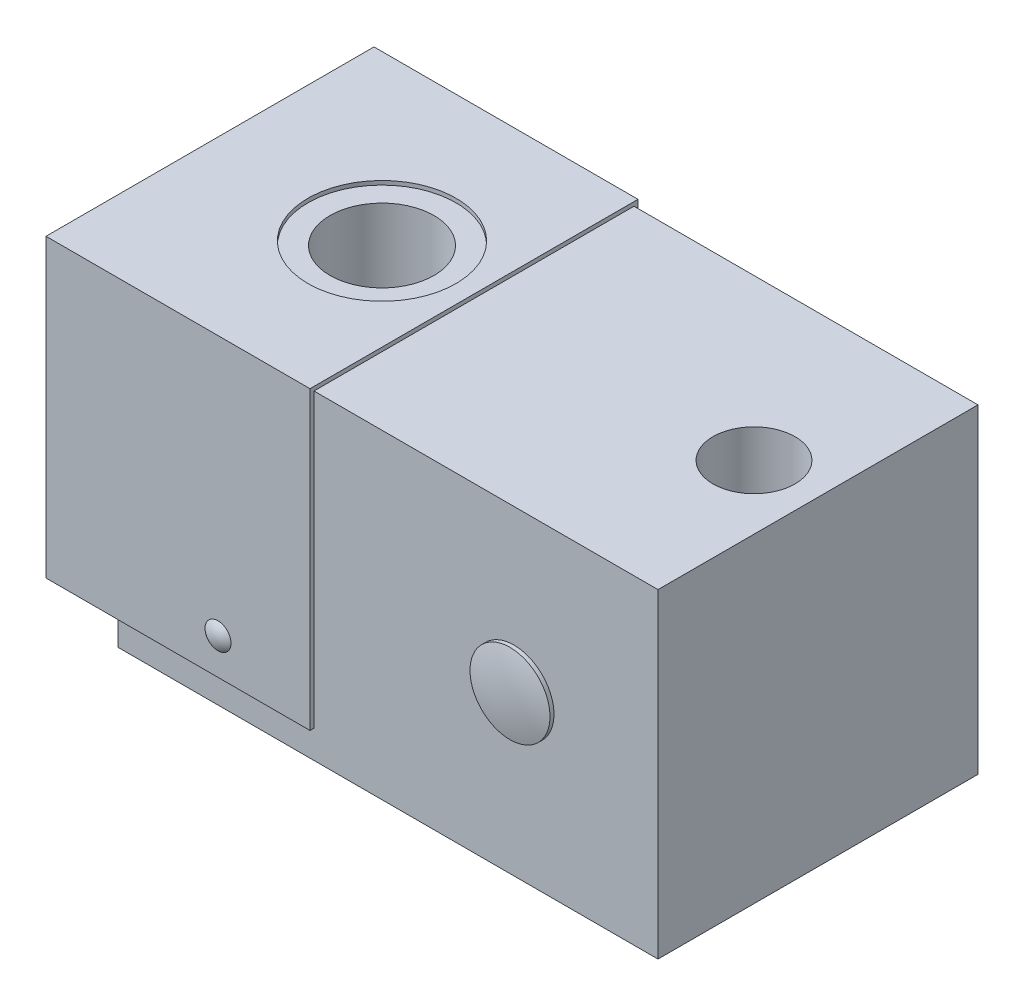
ISO-10303-21;
HEADER;
FILE_DESCRIPTION(('STEP AP214'),'2;1');
FILE_NAME('part.step','',(''),(''),'','','');
FILE_SCHEMA(('AUTOMOTIVE_DESIGN { 1 0 10303 214 1 1 1 1 }'));
ENDSEC;
DATA;
#1=APPLICATION_CONTEXT('core data for automotive mechanical design processes');
#2=APPLICATION_PROTOCOL_DEFINITION('international standard','automotive_design',2000,#1);
#3=PRODUCT_CONTEXT('',#1,'mechanical');
#4=PRODUCT('Part','Part','',(#3));
#5=PRODUCT_RELATED_PRODUCT_CATEGORY('part','',(#4));
#6=PRODUCT_DEFINITION_FORMATION('','',#4);
#7=PRODUCT_DEFINITION_CONTEXT('part definition',#1,'design');
#8=PRODUCT_DEFINITION('design','',#6,#7);
#9=PRODUCT_DEFINITION_SHAPE('','',#8);
#10=(LENGTH_UNIT() NAMED_UNIT(*) SI_UNIT(.MILLI.,.METRE.));
#11=(NAMED_UNIT(*) PLANE_ANGLE_UNIT() SI_UNIT($,.RADIAN.));
#12=(NAMED_UNIT(*) SI_UNIT($,.STERADIAN.) SOLID_ANGLE_UNIT());
#13=UNCERTAINTY_MEASURE_WITH_UNIT(LENGTH_MEASURE(1.E-05),#10,'distance_accuracy_value','');
#14=(GEOMETRIC_REPRESENTATION_CONTEXT(3) GLOBAL_UNCERTAINTY_ASSIGNED_CONTEXT((#13)) GLOBAL_UNIT_ASSIGNED_CONTEXT((#10,
#11,#12)) REPRESENTATION_CONTEXT('',''));
#15=CARTESIAN_POINT('',(0.,0.,0.));
#16=DIRECTION('',(0.,0.,1.));
#17=DIRECTION('',(1.,0.,0.));
#18=AXIS2_PLACEMENT_3D('',#15,#16,#17);
#19=CARTESIAN_POINT('',(49.,0.,0.));
#20=DIRECTION('',(0.,1.,0.));
#21=DIRECTION('',(0.,0.,1.));
#22=AXIS2_PLACEMENT_3D('',#19,#20,#21);
#23=CYLINDRICAL_SURFACE('',#22,2.01);
#24=CARTESIAN_POINT('',(47.1583846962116,26.5472611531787,-0.805327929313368));
#25=CARTESIAN_POINT('',(47.1835497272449,26.6047692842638,-0.862882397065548));
#26=CARTESIAN_POINT('',(47.2101796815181,26.6655983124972,-0.916481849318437));
#27=CARTESIAN_POINT('',(47.2654040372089,26.7916741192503,-1.01713907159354));
#28=CARTESIAN_POINT('',(47.2940016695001,26.8569281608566,-1.06418567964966));
#29=CARTESIAN_POINT('',(47.3527515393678,26.9909027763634,-1.15305044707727));
#30=CARTESIAN_POINT('',(47.3829127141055,27.0596432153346,-1.19483243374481));
#31=CARTESIAN_POINT('',(47.4442566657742,27.1993605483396,-1.2736784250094));
#32=CARTESIAN_POINT('',(47.4754399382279,27.270338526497,-1.31074009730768));
#33=CARTESIAN_POINT('',(47.5396750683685,27.4164440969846,-1.38200279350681));
#34=CARTESIAN_POINT('',(47.5727541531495,27.491630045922,-1.4160587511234));
#35=CARTESIAN_POINT('',(47.6395561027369,27.6433453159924,-1.48035038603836));
#36=CARTESIAN_POINT('',(47.6732791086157,27.7198749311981,-1.51058521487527));
#37=CARTESIAN_POINT('',(47.7752695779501,27.9511314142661,-1.59626180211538));
#38=CARTESIAN_POINT('',(47.8443079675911,28.1074109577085,-1.64662152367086));
#39=CARTESIAN_POINT('',(47.983759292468,28.4224606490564,-1.73614482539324));
#40=CARTESIAN_POINT('',(48.0541722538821,28.581230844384,-1.77530819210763));
#41=CARTESIAN_POINT('',(48.1960050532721,28.9003168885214,-1.8438796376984));
#42=CARTESIAN_POINT('',(48.2674244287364,29.0606320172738,-1.87329205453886));
#43=CARTESIAN_POINT('',(48.4036065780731,29.3655184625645,-1.92069071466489));
#44=CARTESIAN_POINT('',(48.4682889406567,29.5099926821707,-1.93954730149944));
#45=CARTESIAN_POINT('',(48.5982195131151,29.7994237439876,-1.97056695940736));
#46=CARTESIAN_POINT('',(48.6634677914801,29.9443806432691,-1.98272920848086));
#47=CARTESIAN_POINT('',(48.7945232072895,30.2346331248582,-2.00056418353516));
#48=CARTESIAN_POINT('',(48.8603308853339,30.3799289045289,-2.00622968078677));
#49=CARTESIAN_POINT('',(48.9923905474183,30.6704524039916,-2.01107153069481));
#50=CARTESIAN_POINT('',(49.0586425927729,30.8156801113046,-2.01024696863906));
#51=CARTESIAN_POINT('',(49.1917273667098,31.1061837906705,-2.00194880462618));
#52=CARTESIAN_POINT('',(49.2585612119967,31.2514587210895,-1.99445626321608));
#53=CARTESIAN_POINT('',(49.3925649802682,31.5412977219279,-1.97246126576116));
#54=CARTESIAN_POINT('',(49.4597348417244,31.6858619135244,-1.95796004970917));
#55=CARTESIAN_POINT('',(49.5942606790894,31.9736941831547,-1.92140761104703));
#56=CARTESIAN_POINT('',(49.6616162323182,32.1169638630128,-1.89936759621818));
#57=CARTESIAN_POINT('',(49.7964891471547,32.4018445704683,-1.84687434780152));
#58=CARTESIAN_POINT('',(49.8640064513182,32.5434561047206,-1.81642375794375));
#59=CARTESIAN_POINT('',(49.994263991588,32.8143675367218,-1.74830057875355));
#60=CARTESIAN_POINT('',(50.0570050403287,32.9438309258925,-1.71128944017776));
#61=CARTESIAN_POINT('',(50.1822336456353,33.1998335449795,-1.62730459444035));
#62=CARTESIAN_POINT('',(50.2447208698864,33.3263695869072,-1.58032054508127));
#63=CARTESIAN_POINT('',(50.3682290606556,33.5736919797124,-1.47465781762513));
#64=CARTESIAN_POINT('',(50.4292582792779,33.6945210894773,-1.41609282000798));
#65=CARTESIAN_POINT('',(50.5190941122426,33.8700892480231,-1.31697346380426));
#66=CARTESIAN_POINT('',(50.5487279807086,33.9276152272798,-1.28209266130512));
#67=CARTESIAN_POINT('',(50.6071636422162,34.0402584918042,-1.20803746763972));
#68=CARTESIAN_POINT('',(50.6359658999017,34.0953771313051,-1.16886553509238));
#69=CARTESIAN_POINT('',(50.6833435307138,34.1853721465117,-1.09891869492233));
#70=CARTESIAN_POINT('',(50.7022478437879,34.2210923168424,-1.0694563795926));
#71=CARTESIAN_POINT('',(50.739305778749,34.2907515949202,-1.0080682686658));
#72=CARTESIAN_POINT('',(50.7574593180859,34.3246905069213,-0.976142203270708));
#73=CARTESIAN_POINT('',(50.8104312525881,34.4231937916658,-0.876416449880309));
#74=CARTESIAN_POINT('',(50.843847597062,34.4846090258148,-0.804545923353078));
#75=CARTESIAN_POINT('',(50.8949194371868,34.5775759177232,-0.672844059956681));
#76=CARTESIAN_POINT('',(50.9142671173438,34.6125124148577,-0.616069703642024));
#77=CARTESIAN_POINT('',(50.9485829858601,34.6741255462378,-0.49693933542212));
#78=CARTESIAN_POINT('',(50.9635568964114,34.7008129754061,-0.434590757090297));
#79=CARTESIAN_POINT('',(50.9858335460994,34.7403648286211,-0.315626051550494));
#80=CARTESIAN_POINT('',(50.9939786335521,34.7547546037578,-0.259680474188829));
#81=CARTESIAN_POINT('',(51.0055197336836,34.7751151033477,-0.145798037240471));
#82=CARTESIAN_POINT('',(51.0089190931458,34.781091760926,-0.0878626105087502));
#83=CARTESIAN_POINT('',(51.010641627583,34.7841224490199,0.0284351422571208));
#84=CARTESIAN_POINT('',(51.0089548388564,34.7811589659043,0.0867980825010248));
#85=CARTESIAN_POINT('',(51.0006534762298,34.7665337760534,0.202063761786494));
#86=CARTESIAN_POINT('',(50.9940365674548,34.7548679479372,0.258965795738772));
#87=CARTESIAN_POINT('',(50.9766349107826,34.724049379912,0.36886284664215));
#88=CARTESIAN_POINT('',(50.9659267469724,34.7050341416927,0.421909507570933));
#89=CARTESIAN_POINT('',(50.9411027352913,34.6607092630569,0.524410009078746));
#90=CARTESIAN_POINT('',(50.9269858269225,34.635397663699,0.573862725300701));
#91=CARTESIAN_POINT('',(50.885900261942,34.5612665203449,0.700261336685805));
#92=CARTESIAN_POINT('',(50.8565989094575,34.5079576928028,0.77381025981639));
#93=CARTESIAN_POINT('',(50.793444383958,34.3917427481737,0.910702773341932));
#94=CARTESIAN_POINT('',(50.7595767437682,34.3288060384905,0.974012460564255));
#95=CARTESIAN_POINT('',(50.6932519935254,34.2042218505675,1.08473495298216));
#96=CARTESIAN_POINT('',(50.6610920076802,34.1432820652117,1.13314080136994));
#97=CARTESIAN_POINT('',(50.5953987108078,34.0177079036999,1.22390569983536));
#98=CARTESIAN_POINT('',(50.5618642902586,33.9530705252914,1.26625973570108));
#99=CARTESIAN_POINT('',(50.4938991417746,33.8210177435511,1.34577201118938));
#100=CARTESIAN_POINT('',(50.4594672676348,33.75359871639,1.38292317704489));
#101=CARTESIAN_POINT('',(50.3900554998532,33.6167001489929,1.45267552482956));
#102=CARTESIAN_POINT('',(50.355075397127,33.5472198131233,1.48527492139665));
#103=CARTESIAN_POINT('',(50.282372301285,33.4018644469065,1.54858070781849));
#104=CARTESIAN_POINT('',(50.2446260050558,33.3258780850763,1.57900307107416));
#105=CARTESIAN_POINT('',(50.1689184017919,33.1725172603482,1.6358380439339));
#106=CARTESIAN_POINT('',(50.1309570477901,33.0951424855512,1.66224973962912));
#107=CARTESIAN_POINT('',(50.0168626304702,32.8612863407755,1.73618458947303));
#108=CARTESIAN_POINT('',(49.9405728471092,32.7031806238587,1.77836246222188));
#109=CARTESIAN_POINT('',(49.7878273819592,32.3837626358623,1.85110479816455));
#110=CARTESIAN_POINT('',(49.7113720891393,32.2224408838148,1.88162698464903));
#111=CARTESIAN_POINT('',(49.5587961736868,31.8981385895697,1.93243549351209));
#112=CARTESIAN_POINT('',(49.4826754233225,31.7351587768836,1.95272613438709));
#113=CARTESIAN_POINT('',(49.3396977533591,31.4271910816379,1.98226883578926));
#114=CARTESIAN_POINT('',(49.2727945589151,31.2823187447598,1.99253137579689));
#115=CARTESIAN_POINT('',(49.1393538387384,30.9920653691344,2.00628516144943));
#116=CARTESIAN_POINT('',(49.0728163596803,30.8466842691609,2.00977556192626));
#117=CARTESIAN_POINT('',(48.940087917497,30.5555660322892,2.01020372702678));
#118=CARTESIAN_POINT('',(48.8738974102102,30.4098286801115,2.0071343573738));
#119=CARTESIAN_POINT('',(48.7419745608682,30.1184043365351,1.99447102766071));
#120=CARTESIAN_POINT('',(48.6762422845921,29.9727173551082,1.98487614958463));
#121=CARTESIAN_POINT('',(48.545463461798,29.6820367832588,1.95906326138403));
#122=CARTESIAN_POINT('',(48.4804156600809,29.5370423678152,1.94286098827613));
#123=CARTESIAN_POINT('',(48.3509473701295,29.2477385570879,1.90352532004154));
#124=CARTESIAN_POINT('',(48.2865267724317,29.1034290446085,1.88039315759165));
#125=CARTESIAN_POINT('',(48.1585237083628,28.8160692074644,1.8266989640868));
#126=CARTESIAN_POINT('',(48.0949401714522,28.6730173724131,1.79614764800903));
#127=CARTESIAN_POINT('',(47.9687304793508,28.3885323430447,1.72678133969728));
#128=CARTESIAN_POINT('',(47.9061040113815,28.2470986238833,1.68796911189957));
#129=CARTESIAN_POINT('',(47.7958111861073,27.9976054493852,1.61043793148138));
#130=CARTESIAN_POINT('',(47.7478962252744,27.8890753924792,1.57359243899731));
#131=CARTESIAN_POINT('',(47.6530440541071,27.6739803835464,1.49321185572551));
#132=CARTESIAN_POINT('',(47.6061073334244,27.5674164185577,1.44967350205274));
#133=CARTESIAN_POINT('',(47.5136452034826,27.3572739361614,1.35471137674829));
#134=CARTESIAN_POINT('',(47.4681190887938,27.2536939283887,1.30329162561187));
#135=CARTESIAN_POINT('',(47.3791207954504,27.0510192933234,1.19080211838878));
#136=CARTESIAN_POINT('',(47.3356460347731,26.9519190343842,1.1297449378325));
#137=CARTESIAN_POINT('',(47.27262863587,26.8081565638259,1.02853181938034));
#138=CARTESIAN_POINT('',(47.2518774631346,26.7607963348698,0.99296019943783));
#139=CARTESIAN_POINT('',(47.2114737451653,26.668548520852,0.918195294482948));
#140=CARTESIAN_POINT('',(47.1918205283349,26.6236594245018,0.879004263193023));
#141=CARTESIAN_POINT('',(47.1540854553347,26.5374410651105,0.796703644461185));
#142=CARTESIAN_POINT('',(47.1359948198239,26.496091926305,0.753619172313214));
#143=CARTESIAN_POINT('',(47.1018156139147,26.4179467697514,0.662830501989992));
#144=CARTESIAN_POINT('',(47.0857236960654,26.3811431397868,0.615134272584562));
#145=CARTESIAN_POINT('',(47.0586228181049,26.31914627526,0.522585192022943));
#146=CARTESIAN_POINT('',(47.0472124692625,26.2930373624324,0.478472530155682));
#147=CARTESIAN_POINT('',(47.0269760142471,26.2467255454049,0.386630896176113));
#148=CARTESIAN_POINT('',(47.0181494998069,26.2265217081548,0.338902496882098));
#149=CARTESIAN_POINT('',(47.0037254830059,26.193502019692,0.23982151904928));
#150=CARTESIAN_POINT('',(46.9981642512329,26.1807691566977,0.1884350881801));
#151=CARTESIAN_POINT('',(46.9910755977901,26.1645387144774,0.0839672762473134));
#152=CARTESIAN_POINT('',(46.9895425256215,26.1610281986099,0.030888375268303));
#153=CARTESIAN_POINT('',(46.9906400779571,26.1635413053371,-0.0695616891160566));
#154=CARTESIAN_POINT('',(46.9928628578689,26.1686310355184,-0.11696400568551));
#155=CARTESIAN_POINT('',(47.0004695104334,26.1860471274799,-0.210166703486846));
#156=CARTESIAN_POINT('',(47.0058566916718,26.1983810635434,-0.25596535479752));
#157=CARTESIAN_POINT('',(47.021404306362,26.233972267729,-0.358803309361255));
#158=CARTESIAN_POINT('',(47.0325268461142,26.2594307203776,-0.414924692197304));
#159=CARTESIAN_POINT('',(47.0581869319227,26.318149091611,-0.522028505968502));
#160=CARTESIAN_POINT('',(47.0727302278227,26.3514221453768,-0.57300207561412));
#161=CARTESIAN_POINT('',(47.0991722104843,26.4118993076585,-0.654328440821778));
#162=CARTESIAN_POINT('',(47.1104160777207,26.43761121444,-0.686038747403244));
#163=CARTESIAN_POINT('',(47.1337825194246,26.4910326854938,-0.74726367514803));
#164=CARTESIAN_POINT('',(47.1459034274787,26.5187384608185,-0.776782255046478));
#165=CARTESIAN_POINT('',(47.1583846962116,26.5472611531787,-0.805327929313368));
#166=B_SPLINE_CURVE_WITH_KNOTS('',3,(#24,#25,#26,#27,#28,#29,#30,#31,#32,#33,#34,#35,#36,#37,
#38,#39,#40,#41,#42,#43,#44,#45,#46,#47,#48,#49,#50,#51,#52,#53,#54,#55,#56,#57,#58,#59,#60,#61,
#62,#63,#64,#65,#66,#67,#68,#69,#70,#71,#72,#73,#74,#75,#76,#77,#78,#79,#80,#81,#82,#83,#84,#85,
#86,#87,#88,#89,#90,#91,#92,#93,#94,#95,#96,#97,#98,#99,#100,#101,#102,#103,#104,#105,#106,#107,
#108,#109,#110,#111,#112,#113,#114,#115,#116,#117,#118,#119,#120,#121,#122,#123,#124,#125,#126,
#127,#128,#129,#130,#131,#132,#133,#134,#135,#136,#137,#138,#139,#140,#141,#142,#143,#144,#145,
#146,#147,#148,#149,#150,#151,#152,#153,#154,#155,#156,#157,#158,#159,#160,#161,#162,#163,#164,
#165),.UNSPECIFIED.,.T.,.F.,(4,2,2,2,2,2,2,2,2,2,2,2,2,2,2,2,2,2,2,2,2,2,2,2,2,2,2,2,2,2,2,2,2,
2,2,2,2,2,2,2,2,2,2,2,2,2,2,2,2,2,2,2,2,2,2,2,2,2,2,2,2,2,2,2,2,2,2,2,2,2,4),(0.,
0.255426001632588,0.511281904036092,0.768809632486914,1.02646411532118,1.29311490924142,
1.55982480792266,2.09365353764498,2.62749244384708,3.16109353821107,3.63918542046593,
4.11733599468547,4.59601807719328,5.07476762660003,5.55488135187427,6.03491016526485,
6.51422840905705,6.99339615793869,7.43874294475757,7.88455384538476,8.32618832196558,
8.54659636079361,8.76687877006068,8.91682386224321,9.0667853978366,9.36604433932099,
9.57362423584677,9.78093132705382,9.95519180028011,10.129329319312,10.3038081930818,
10.4783697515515,10.6498122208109,10.8213080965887,11.1059951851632,11.3916064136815,
11.6438651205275,11.8963316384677,12.1491381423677,12.402043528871,12.6723281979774,
12.9426743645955,13.4837502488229,14.0267704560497,14.5695612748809,15.0491277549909,
15.5287540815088,16.0089023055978,16.4891180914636,16.9681967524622,17.4471902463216,
17.9254960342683,18.4036420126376,18.7761612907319,19.1488627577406,19.5213747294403,
19.8934045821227,20.081563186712,20.2696054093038,20.4565111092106,20.6430994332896,
20.8002258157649,20.9573273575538,21.1161424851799,21.2747347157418,21.4171876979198,
21.5597898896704,21.7466093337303,21.9337450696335,22.0606655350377,22.1873508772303),.UNSPECIFIED.);
#167=CARTESIAN_POINT('',(50.7593195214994,34.3281008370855,0.972057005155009));
#168=VERTEX_POINT('',#167);
#169=CARTESIAN_POINT('',(50.7593195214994,34.3281008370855,-0.97205700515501));
#170=VERTEX_POINT('',#169);
#171=EDGE_CURVE('E11',#168,#170,#166,.T.);
#172=ORIENTED_EDGE('',*,*,#171,.F.);
#173=CARTESIAN_POINT('',(49.,34.3655518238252,2.01));
#174=CARTESIAN_POINT('',(48.8856434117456,34.3858496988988,2.00999834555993));
#175=CARTESIAN_POINT('',(48.7718985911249,34.4096621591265,2.00020684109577));
#176=CARTESIAN_POINT('',(48.549043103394,34.4633134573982,1.96202483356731));
#177=CARTESIAN_POINT('',(48.4399352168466,34.4931558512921,1.93362333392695));
#178=CARTESIAN_POINT('',(48.2294937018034,34.5571719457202,1.85978947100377));
#179=CARTESIAN_POINT('',(48.1281350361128,34.5913306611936,1.81441501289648));
#180=CARTESIAN_POINT('',(47.9348744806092,34.6621289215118,1.70815051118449));
#181=CARTESIAN_POINT('',(47.8429745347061,34.6987689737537,1.64725728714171));
#182=CARTESIAN_POINT('',(47.6650764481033,34.7745766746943,1.50720549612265));
#183=CARTESIAN_POINT('',(47.5797849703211,34.8137616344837,1.4271563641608));
#184=CARTESIAN_POINT('',(47.4237818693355,34.8894582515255,1.25272951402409));
#185=CARTESIAN_POINT('',(47.3530768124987,34.9259687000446,1.15834537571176));
#186=CARTESIAN_POINT('',(47.228180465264,34.993096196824,0.956506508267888));
#187=CARTESIAN_POINT('',(47.1740759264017,35.0236819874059,0.848987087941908));
#188=CARTESIAN_POINT('',(47.0855082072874,35.0750226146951,0.623999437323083));
#189=CARTESIAN_POINT('',(47.051014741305,35.0957926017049,0.506546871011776));
#190=CARTESIAN_POINT('',(47.0068071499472,35.1226658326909,0.280765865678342));
#191=CARTESIAN_POINT('',(46.9945481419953,35.1302699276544,0.173115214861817));
#192=CARTESIAN_POINT('',(46.9875597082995,35.1345875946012,-0.0429511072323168));
#193=CARTESIAN_POINT('',(46.9928205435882,35.1313072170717,-0.151366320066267));
#194=CARTESIAN_POINT('',(47.0190515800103,35.1152134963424,-0.353961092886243));
#195=CARTESIAN_POINT('',(47.0383352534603,35.1034245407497,-0.448450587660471));
#196=CARTESIAN_POINT('',(47.0897565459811,35.0726903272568,-0.632626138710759));
#197=CARTESIAN_POINT('',(47.1218973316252,35.0537433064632,-0.722311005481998));
#198=CARTESIAN_POINT('',(47.199973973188,35.009110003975,-0.899970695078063));
#199=CARTESIAN_POINT('',(47.2465822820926,34.9831054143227,-0.987567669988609));
#200=CARTESIAN_POINT('',(47.351389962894,34.9269926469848,-1.15406889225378));
#201=CARTESIAN_POINT('',(47.4095949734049,34.8968824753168,-1.23296888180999));
#202=CARTESIAN_POINT('',(47.5450803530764,34.8302009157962,-1.39126007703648));
#203=CARTESIAN_POINT('',(47.623884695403,34.7933113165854,-1.4692162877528));
#204=CARTESIAN_POINT('',(47.7931660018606,34.71933436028,-1.61116890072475));
#205=CARTESIAN_POINT('',(47.883649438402,34.682246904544,-1.67515750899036));
#206=CARTESIAN_POINT('',(48.0817240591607,34.6074837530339,-1.79193959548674));
#207=CARTESIAN_POINT('',(48.1900889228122,34.5699719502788,-1.84353603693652));
#208=CARTESIAN_POINT('',(48.4156955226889,34.4999170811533,-1.92694974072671));
#209=CARTESIAN_POINT('',(48.5329342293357,34.4673723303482,-1.95877371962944));
#210=CARTESIAN_POINT('',(48.7675018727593,34.4105590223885,-1.99989284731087));
#211=CARTESIAN_POINT('',(48.8845877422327,34.3859831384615,-2.01014029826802));
#212=CARTESIAN_POINT('',(49.1200470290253,34.3442989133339,-2.00985703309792));
#213=CARTESIAN_POINT('',(49.2384196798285,34.3271863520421,-1.99933807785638));
#214=CARTESIAN_POINT('',(49.4629824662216,34.3017208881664,-1.95901026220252));
#215=CARTESIAN_POINT('',(49.5693951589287,34.2927817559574,-1.93079447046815));
#216=CARTESIAN_POINT('',(49.7764660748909,34.2809271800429,-1.85722051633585));
#217=CARTESIAN_POINT('',(49.8771248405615,34.2780111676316,-1.81186397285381));
#218=CARTESIAN_POINT('',(50.0676419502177,34.2771219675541,-1.70641502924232));
#219=CARTESIAN_POINT('',(50.1576822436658,34.2790466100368,-1.64665089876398));
#220=CARTESIAN_POINT('',(50.3269593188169,34.2862191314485,-1.51356369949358));
#221=CARTESIAN_POINT('',(50.4061944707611,34.2914675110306,-1.44023858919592));
#222=CARTESIAN_POINT('',(50.5540848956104,34.3038889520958,-1.27953286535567));
#223=CARTESIAN_POINT('',(50.622344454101,34.3111157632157,-1.19179219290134));
#224=CARTESIAN_POINT('',(50.7434981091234,34.3256761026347,-1.00627601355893));
#225=CARTESIAN_POINT('',(50.7963903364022,34.3330096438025,-0.908499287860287));
#226=CARTESIAN_POINT('',(50.8863500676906,34.346371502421,-0.703278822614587));
#227=CARTESIAN_POINT('',(50.9230507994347,34.3523681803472,-0.595671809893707));
#228=CARTESIAN_POINT('',(50.9778240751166,34.3615917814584,-0.375706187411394));
#229=CARTESIAN_POINT('',(50.9958986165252,34.3648190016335,-0.263348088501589));
#230=CARTESIAN_POINT('',(51.0127618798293,34.3678251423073,-0.0383845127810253));
#231=CARTESIAN_POINT('',(51.0117593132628,34.367641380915,0.074204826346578));
#232=CARTESIAN_POINT('',(50.991011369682,34.3639543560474,0.297583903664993));
#233=CARTESIAN_POINT('',(50.971266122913,34.3604511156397,0.408373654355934));
#234=CARTESIAN_POINT('',(50.913834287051,34.3508633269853,0.624290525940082));
#235=CARTESIAN_POINT('',(50.8762662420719,34.3447958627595,0.72945002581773));
#236=CARTESIAN_POINT('',(50.7843092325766,34.3313128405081,0.932051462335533));
#237=CARTESIAN_POINT('',(50.7299180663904,34.3238971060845,1.02949238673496));
#238=CARTESIAN_POINT('',(50.604865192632,34.3092044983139,1.21541813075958));
#239=CARTESIAN_POINT('',(50.5339773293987,34.3019312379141,1.30375126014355));
#240=CARTESIAN_POINT('',(50.3782937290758,34.2894848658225,1.46736354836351));
#241=CARTESIAN_POINT('',(50.2934978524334,34.2843117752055,1.54264257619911));
#242=CARTESIAN_POINT('',(50.1126284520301,34.2778961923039,1.67775434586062));
#243=CARTESIAN_POINT('',(50.0165895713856,34.2766419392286,1.73763280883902));
#244=CARTESIAN_POINT('',(49.8159168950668,34.2795837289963,1.84040017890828));
#245=CARTESIAN_POINT('',(49.7112872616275,34.2837771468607,1.88329725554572));
#246=CARTESIAN_POINT('',(49.5059510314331,34.2980184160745,1.94799784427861));
#247=CARTESIAN_POINT('',(49.4056742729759,34.307534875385,1.97129165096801));
#248=CARTESIAN_POINT('',(49.2034378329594,34.3322954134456,2.00229393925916));
#249=CARTESIAN_POINT('',(49.1014780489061,34.3475398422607,2.01000146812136));
#250=CARTESIAN_POINT('',(49.,34.3655518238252,2.01));
#251=B_SPLINE_CURVE_WITH_KNOTS('',3,(#173,#174,#175,#176,#177,#178,#179,#180,#181,#182,#183,
#184,#185,#186,#187,#188,#189,#190,#191,#192,#193,#194,#195,#196,#197,#198,#199,#200,#201,#202,
#203,#204,#205,#206,#207,#208,#209,#210,#211,#212,#213,#214,#215,#216,#217,#218,#219,#220,#221,
#222,#223,#224,#225,#226,#227,#228,#229,#230,#231,#232,#233,#234,#235,#236,#237,#238,#239,#240,
#241,#242,#243,#244,#245,#246,#247,#248,#249,#250),.UNSPECIFIED.,.T.,.F.,(4,2,2,2,2,2,2,2,2,2,2,
2,2,2,2,2,2,2,2,2,2,2,2,2,2,2,2,2,2,2,2,2,2,2,2,2,2,2,4),(0.,0.34802648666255,0.696258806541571,
1.04331376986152,1.3904399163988,1.75883581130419,2.12739718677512,2.49785302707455,
2.86773520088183,3.19169233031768,3.51546940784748,3.80565359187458,4.09590928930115,
4.40243988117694,4.7091198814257,5.05812476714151,5.40732390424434,5.78267040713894,
6.15788933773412,6.51616714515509,6.87424210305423,7.20396903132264,7.53366482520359,
7.85646050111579,8.17930481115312,8.51198161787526,8.8446988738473,9.18460798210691,
9.52448063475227,9.86063709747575,10.196791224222,10.530740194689,10.8647328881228,
11.203606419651,11.5424833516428,11.8803423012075,12.2180385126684,12.5268522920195,
12.8356849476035),.UNSPECIFIED.);
#252=EDGE_CURVE('E59',#170,#168,#251,.T.);
#253=ORIENTED_EDGE('',*,*,#252,.F.);
#254=EDGE_LOOP('',(#172,#253));
#255=FACE_BOUND('',#254,.T.);
#256=CARTESIAN_POINT('',(49.,16.49,0.));
#257=DIRECTION('',(0.,-1.,0.));
#258=DIRECTION('',(0.,0.,-1.));
#259=AXIS2_PLACEMENT_3D('',#256,#257,#258);
#260=CIRCLE('',#259,2.01);
#261=CARTESIAN_POINT('',(49.,16.49,-2.01));
#262=VERTEX_POINT('',#261);
#263=EDGE_CURVE('E39',#262,#262,#260,.T.);
#264=ORIENTED_EDGE('',*,*,#263,.T.);
#265=EDGE_LOOP('',(#264));
#266=FACE_BOUND('',#265,.T.);
#267=ADVANCED_FACE('F35',(#255,#266),#23,.F.);
#268=CARTESIAN_POINT('',(49.,6.5,0.));
#269=DIRECTION('',(0.,-1.,0.));
#270=DIRECTION('',(0.,0.,-1.));
#271=AXIS2_PLACEMENT_3D('',#268,#269,#270);
#272=PLANE('',#271);
#273=CARTESIAN_POINT('',(49.,6.5,0.));
#274=DIRECTION('',(0.,-1.,0.));
#275=DIRECTION('',(0.,0.,-1.));
#276=AXIS2_PLACEMENT_3D('',#273,#274,#275);
#277=CIRCLE('',#276,4.55);
#278=CARTESIAN_POINT('',(49.,6.5,-4.55));
#279=VERTEX_POINT('',#278);
#280=EDGE_CURVE('E287',#279,#279,#277,.T.);
#281=ORIENTED_EDGE('',*,*,#280,.T.);
#282=EDGE_LOOP('',(#281));
#283=FACE_BOUND('',#282,.T.);
#284=CARTESIAN_POINT('',(49.,6.5,0.));
#285=DIRECTION('',(0.,1.,0.));
#286=DIRECTION('',(0.,0.,1.));
#287=AXIS2_PLACEMENT_3D('',#284,#285,#286);
#288=CIRCLE('',#287,4.25);
#289=CARTESIAN_POINT('',(49.,6.5,4.25));
#290=VERTEX_POINT('',#289);
#291=EDGE_CURVE('E281',#290,#290,#288,.T.);
#292=ORIENTED_EDGE('',*,*,#291,.T.);
#293=EDGE_LOOP('',(#292));
#294=FACE_BOUND('',#293,.T.);
#295=ADVANCED_FACE('F315',(#283,#294),#272,.T.);
#296=CARTESIAN_POINT('',(50.,40.,40.));
#297=DIRECTION('',(0.,0.,-1.));
#298=DIRECTION('',(-1.,0.,0.));
#299=AXIS2_PLACEMENT_3D('',#296,#297,#298);
#300=CYLINDRICAL_SURFACE('',#299,5.7225);
#301=CARTESIAN_POINT('',(50.,40.,30.));
#302=DIRECTION('',(0.,0.,-1.));
#303=DIRECTION('',(-1.,0.,0.));
#304=AXIS2_PLACEMENT_3D('',#301,#302,#303);
#305=CIRCLE('',#304,5.7225);
#306=CARTESIAN_POINT('',(44.2775,40.,30.));
#307=VERTEX_POINT('',#306);
#308=EDGE_CURVE('E427',#307,#307,#305,.T.);
#309=ORIENTED_EDGE('',*,*,#308,.F.);
#310=EDGE_LOOP('',(#309));
#311=FACE_BOUND('',#310,.T.);
#312=CARTESIAN_POINT('',(50.,40.,-39.144));
#313=DIRECTION('',(0.,0.,-1.));
#314=DIRECTION('',(-1.,0.,0.));
#315=AXIS2_PLACEMENT_3D('',#312,#313,#314);
#316=CIRCLE('',#315,5.7225);
#317=CARTESIAN_POINT('',(44.2775,40.,-39.144));
#318=VERTEX_POINT('',#317);
#319=EDGE_CURVE('E346',#318,#318,#316,.T.);
#320=ORIENTED_EDGE('',*,*,#319,.T.);
#321=EDGE_LOOP('',(#320));
#322=FACE_BOUND('',#321,.T.);
#323=CARTESIAN_POINT('',(47.4808295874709,45.1381695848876,11.7074357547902));
#324=CARTESIAN_POINT('',(47.3078641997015,45.0533699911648,12.1497130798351));
#325=CARTESIAN_POINT('',(47.1344110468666,44.9575483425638,12.5896986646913));
#326=CARTESIAN_POINT('',(46.8744650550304,44.7946292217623,13.2451619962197));
#327=CARTESIAN_POINT('',(46.7878254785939,44.7371018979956,13.4629716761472));
#328=CARTESIAN_POINT('',(46.6148359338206,44.6150715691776,13.8967369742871));
#329=CARTESIAN_POINT('',(46.5284859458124,44.5505690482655,14.112692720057));
#330=CARTESIAN_POINT('',(46.356462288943,44.4140315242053,14.5419439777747));
#331=CARTESIAN_POINT('',(46.2707876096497,44.3420119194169,14.7552439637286));
#332=CARTESIAN_POINT('',(46.100213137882,44.1894824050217,15.17908093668));
#333=CARTESIAN_POINT('',(46.0153132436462,44.1089736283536,15.3896182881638));
#334=CARTESIAN_POINT('',(45.8467054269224,43.9384660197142,15.8070183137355));
#335=CARTESIAN_POINT('',(45.7629963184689,43.8484775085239,16.0138847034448));
#336=CARTESIAN_POINT('',(45.5971472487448,43.6575804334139,16.4231226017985));
#337=CARTESIAN_POINT('',(45.5150067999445,43.5566753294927,16.625495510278));
#338=CARTESIAN_POINT('',(45.3749430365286,43.3712649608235,16.9701220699));
#339=CARTESIAN_POINT('',(45.3165027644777,43.2897511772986,17.1137728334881));
#340=CARTESIAN_POINT('',(45.2011263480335,43.1190449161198,17.397129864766));
#341=CARTESIAN_POINT('',(45.1441904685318,43.029851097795,17.5368354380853));
#342=CARTESIAN_POINT('',(45.0324099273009,42.8428693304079,17.8108999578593));
#343=CARTESIAN_POINT('',(44.9775618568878,42.7450963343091,17.9452676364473));
#344=CARTESIAN_POINT('',(44.8705665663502,42.5395539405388,18.207203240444));
#345=CARTESIAN_POINT('',(44.8184179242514,42.431789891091,18.3347747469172));
#346=CARTESIAN_POINT('',(44.7103077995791,42.187819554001,18.5990830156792));
#347=CARTESIAN_POINT('',(44.6549258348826,42.0497647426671,18.7343780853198));
#348=CARTESIAN_POINT('',(44.5512830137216,41.7557703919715,18.9874254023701));
#349=CARTESIAN_POINT('',(44.5030152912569,41.5998483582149,19.1051945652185));
#350=CARTESIAN_POINT('',(44.4278862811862,41.30960500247,19.2884240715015));
#351=CARTESIAN_POINT('',(44.3986867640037,41.1795580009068,19.3596091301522));
#352=CARTESIAN_POINT('',(44.3484711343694,40.9088792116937,19.4820005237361));
#353=CARTESIAN_POINT('',(44.3274401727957,40.7682671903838,19.5332431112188));
#354=CARTESIAN_POINT('',(44.2983758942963,40.503170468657,19.6040506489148));
#355=CARTESIAN_POINT('',(44.2887605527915,40.3799034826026,19.6274716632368));
#356=CARTESIAN_POINT('',(44.2776420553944,40.1308564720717,19.6545536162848));
#357=CARTESIAN_POINT('',(44.2761339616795,40.005078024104,19.6582265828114));
#358=CARTESIAN_POINT('',(44.2813851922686,39.754803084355,19.6454362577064));
#359=CARTESIAN_POINT('',(44.288141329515,39.630306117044,19.6289807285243));
#360=CARTESIAN_POINT('',(44.3092236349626,39.3858548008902,19.5776238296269));
#361=CARTESIAN_POINT('',(44.3235565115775,39.2659045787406,19.5427061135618));
#362=CARTESIAN_POINT('',(44.3651547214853,38.9891857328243,19.4413417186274));
#363=CARTESIAN_POINT('',(44.3952508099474,38.835397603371,19.3679901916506));
#364=CARTESIAN_POINT('',(44.4642292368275,38.5422292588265,19.1997990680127));
#365=CARTESIAN_POINT('',(44.5031328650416,38.4028851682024,19.1049074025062));
#366=CARTESIAN_POINT('',(44.5807489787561,38.158097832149,18.9154905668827));
#367=CARTESIAN_POINT('',(44.6186042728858,38.0507120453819,18.823071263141));
#368=CARTESIAN_POINT('',(44.6976640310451,37.8449119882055,18.629959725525));
#369=CARTESIAN_POINT('',(44.7388710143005,37.7465045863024,18.529261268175));
#370=CARTESIAN_POINT('',(44.8238707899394,37.5575752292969,18.3214301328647));
#371=CARTESIAN_POINT('',(44.86766833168,37.4670685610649,18.2142856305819));
#372=CARTESIAN_POINT('',(44.9572112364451,37.2931843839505,17.9950979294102));
#373=CARTESIAN_POINT('',(45.002957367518,37.2098097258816,17.8830527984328));
#374=CARTESIAN_POINT('',(45.0993973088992,37.043479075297,17.6466870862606));
#375=CARTESIAN_POINT('',(45.1502066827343,36.9610110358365,17.5220718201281));
#376=CARTESIAN_POINT('',(45.2531827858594,36.8025563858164,17.269314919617));
#377=CARTESIAN_POINT('',(45.3053498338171,36.7265713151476,17.1411724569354));
#378=CARTESIAN_POINT('',(45.4635204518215,36.5071506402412,16.7523134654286));
#379=CARTESIAN_POINT('',(45.5711197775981,36.3723729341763,16.4873459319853));
#380=CARTESIAN_POINT('',(45.7890923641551,36.1214902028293,15.9494921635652));
#381=CARTESIAN_POINT('',(45.8994692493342,36.0054112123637,15.6765955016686));
#382=CARTESIAN_POINT('',(46.121865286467,35.7891684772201,15.1254254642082));
#383=CARTESIAN_POINT('',(46.2338837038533,35.688997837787,14.8471544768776));
#384=CARTESIAN_POINT('',(46.4815527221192,35.483543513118,14.2301617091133));
#385=CARTESIAN_POINT('',(46.6174280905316,35.3812785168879,13.8905308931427));
#386=CARTESIAN_POINT('',(46.8898045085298,35.1936487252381,13.206830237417));
#387=CARTESIAN_POINT('',(47.0263057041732,35.1082881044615,12.8627593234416));
#388=CARTESIAN_POINT('',(47.2993523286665,34.952402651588,12.1708554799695));
#389=CARTESIAN_POINT('',(47.4358976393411,34.8818943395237,11.8230188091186));
#390=CARTESIAN_POINT('',(47.7082046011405,34.7543089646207,11.1246406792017));
#391=CARTESIAN_POINT('',(47.8439663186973,34.6972307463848,10.7740994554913));
#392=CARTESIAN_POINT('',(48.1149550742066,34.5949352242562,10.068230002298));
#393=CARTESIAN_POINT('',(48.2501717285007,34.5498036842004,9.71288543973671));
#394=CARTESIAN_POINT('',(48.5182511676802,34.4709005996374,9.00004938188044));
#395=CARTESIAN_POINT('',(48.6511138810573,34.4371293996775,8.64255782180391));
#396=CARTESIAN_POINT('',(48.9132661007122,34.3800364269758,7.92576061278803));
#397=CARTESIAN_POINT('',(49.0425583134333,34.3567065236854,7.56645659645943));
#398=CARTESIAN_POINT('',(49.2961553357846,34.3195064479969,6.84561647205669));
#399=CARTESIAN_POINT('',(49.4204603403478,34.3056359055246,6.48408045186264));
#400=CARTESIAN_POINT('',(49.6229750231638,34.2893424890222,5.87525137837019));
#401=CARTESIAN_POINT('',(49.7031368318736,34.2846714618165,5.62866500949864));
#402=CARTESIAN_POINT('',(49.8591621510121,34.2787012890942,5.13409812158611));
#403=CARTESIAN_POINT('',(49.9350258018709,34.2774020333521,4.88611764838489));
#404=CARTESIAN_POINT('',(50.0812670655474,34.2776095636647,4.38825120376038));
#405=CARTESIAN_POINT('',(50.1516387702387,34.2791193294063,4.1383634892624));
#406=CARTESIAN_POINT('',(50.2851353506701,34.2842179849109,3.63665758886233));
#407=CARTESIAN_POINT('',(50.3482600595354,34.2878069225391,3.38483935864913));
#408=CARTESIAN_POINT('',(50.4641422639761,34.2960628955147,2.88326455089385));
#409=CARTESIAN_POINT('',(50.517055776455,34.3007108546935,2.63354415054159));
#410=CARTESIAN_POINT('',(50.6113606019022,34.3100529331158,2.13190586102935));
#411=CARTESIAN_POINT('',(50.6527522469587,34.3147470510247,1.8799880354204));
#412=CARTESIAN_POINT('',(50.7213192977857,34.3230369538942,1.37482341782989));
#413=CARTESIAN_POINT('',(50.7485311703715,34.3266355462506,1.12158174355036));
#414=CARTESIAN_POINT('',(50.7867159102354,34.3318018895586,0.613855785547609));
#415=CARTESIAN_POINT('',(50.7976910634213,34.3333699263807,0.359371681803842));
#416=CARTESIAN_POINT('',(50.8024240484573,34.3340373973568,-0.153656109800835));
#417=CARTESIAN_POINT('',(50.7959162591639,34.3330987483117,-0.412202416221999));
#418=CARTESIAN_POINT('',(50.7657455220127,34.3289456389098,-0.92827545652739));
#419=CARTESIAN_POINT('',(50.7420802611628,34.3257308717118,-1.1858020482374));
#420=CARTESIAN_POINT('',(50.6795645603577,34.3179074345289,-1.69960723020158));
#421=CARTESIAN_POINT('',(50.640675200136,34.3132951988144,-1.95588090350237));
#422=CARTESIAN_POINT('',(50.5504064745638,34.3038514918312,-2.46618388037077));
#423=CARTESIAN_POINT('',(50.4990264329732,34.299020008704,-2.72021306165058));
#424=CARTESIAN_POINT('',(50.3854838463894,34.2902101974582,-3.23020956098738));
#425=CARTESIAN_POINT('',(50.3231583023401,34.2862471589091,-3.48614035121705));
#426=CARTESIAN_POINT('',(50.190658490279,34.2802924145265,-3.99595750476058));
#427=CARTESIAN_POINT('',(50.1204844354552,34.2783006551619,-4.24984392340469));
#428=CARTESIAN_POINT('',(49.9741895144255,34.2770909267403,-4.75563471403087));
#429=CARTESIAN_POINT('',(49.8980743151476,34.2778703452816,-5.00754072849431));
#430=CARTESIAN_POINT('',(49.7412299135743,34.2828148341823,-5.5098738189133));
#431=CARTESIAN_POINT('',(49.6605006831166,34.2869799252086,-5.76030088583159));
#432=CARTESIAN_POINT('',(49.4692067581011,34.301126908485,-6.33945711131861));
#433=CARTESIAN_POINT('',(49.357329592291,34.3125390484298,-6.66771870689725));
#434=CARTESIAN_POINT('',(49.1291613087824,34.342977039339,-7.32235410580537));
#435=CARTESIAN_POINT('',(49.0128700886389,34.3620030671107,-7.64872786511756));
#436=CARTESIAN_POINT('',(48.7770621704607,34.4084098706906,-8.29987339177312));
#437=CARTESIAN_POINT('',(48.6575441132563,34.4357942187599,-8.62464441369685));
#438=CARTESIAN_POINT('',(48.4162418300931,34.4996092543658,-9.27247652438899));
#439=CARTESIAN_POINT('',(48.2944574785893,34.5360404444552,-9.59553751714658));
#440=CARTESIAN_POINT('',(48.0501611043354,34.6183976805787,-10.2376579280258));
#441=CARTESIAN_POINT('',(47.9276594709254,34.6642582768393,-10.5567296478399));
#442=CARTESIAN_POINT('',(47.6817075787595,34.7664291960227,-11.1928059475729));
#443=CARTESIAN_POINT('',(47.5582574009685,34.822738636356,-11.5098106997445));
#444=CARTESIAN_POINT('',(47.3109777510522,34.9467541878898,-12.141231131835));
#445=CARTESIAN_POINT('',(47.187148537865,35.0144537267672,-12.4556481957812));
#446=CARTESIAN_POINT('',(46.9395533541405,35.1624920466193,-13.0814885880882));
#447=CARTESIAN_POINT('',(46.8157873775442,35.2428292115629,-13.392912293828));
#448=CARTESIAN_POINT('',(46.5683833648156,35.4180686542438,-14.0131567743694));
#449=CARTESIAN_POINT('',(46.4447475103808,35.5130239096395,-14.3219635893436));
#450=CARTESIAN_POINT('',(46.198700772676,35.719469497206,-14.934664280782));
#451=CARTESIAN_POINT('',(46.0762903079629,35.8309652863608,-15.2385564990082));
#452=CARTESIAN_POINT('',(45.8335529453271,36.0735181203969,-15.8396675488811));
#453=CARTESIAN_POINT('',(45.7132272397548,36.2045859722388,-16.1368825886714));
#454=CARTESIAN_POINT('',(45.5355013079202,36.4189645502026,-16.5749777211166));
#455=CARTESIAN_POINT('',(45.4767363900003,36.4933627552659,-16.7196807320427));
#456=CARTESIAN_POINT('',(45.36037919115,36.6488260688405,-17.0059290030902));
#457=CARTESIAN_POINT('',(45.3027867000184,36.7298899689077,-17.1474748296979));
#458=CARTESIAN_POINT('',(45.1887793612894,36.9000464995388,-17.4274327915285));
#459=CARTESIAN_POINT('',(45.1323732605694,36.989182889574,-17.5658220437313));
#460=CARTESIAN_POINT('',(45.0215888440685,37.1761309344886,-17.8374151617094));
#461=CARTESIAN_POINT('',(44.9672097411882,37.2739391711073,-17.9706210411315));
#462=CARTESIAN_POINT('',(44.8613391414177,37.4791944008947,-18.2297805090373));
#463=CARTESIAN_POINT('',(44.8098376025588,37.5866039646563,-18.3557593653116));
#464=CARTESIAN_POINT('',(44.7105344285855,37.8128066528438,-18.5985202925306));
#465=CARTESIAN_POINT('',(44.6627291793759,37.931588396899,-18.7153113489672));
#466=CARTESIAN_POINT('',(44.5749717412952,38.1746972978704,-18.9295984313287));
#467=CARTESIAN_POINT('',(44.534719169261,38.2982517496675,-19.0278349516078));
#468=CARTESIAN_POINT('',(44.4604670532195,38.5581676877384,-19.2089766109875));
#469=CARTESIAN_POINT('',(44.4264712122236,38.6945366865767,-19.2918726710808));
#470=CARTESIAN_POINT('',(44.3667582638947,38.9824653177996,-19.4374366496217));
#471=CARTESIAN_POINT('',(44.3411693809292,39.134217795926,-19.4997913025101));
#472=CARTESIAN_POINT('',(44.3118012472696,39.3693993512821,-19.5713440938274));
#473=CARTESIAN_POINT('',(44.3035171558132,39.4489914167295,-19.5915251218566));
#474=CARTESIAN_POINT('',(44.2902300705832,39.6100395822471,-19.6238922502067));
#475=CARTESIAN_POINT('',(44.2852262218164,39.6914951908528,-19.6360804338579));
#476=CARTESIAN_POINT('',(44.2764225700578,39.9141819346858,-19.6575239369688));
#477=CARTESIAN_POINT('',(44.2760475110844,40.0564713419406,-19.6584373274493));
#478=CARTESIAN_POINT('',(44.2857696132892,40.3384940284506,-19.6347569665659));
#479=CARTESIAN_POINT('',(44.2958745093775,40.4782253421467,-19.6101443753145));
#480=CARTESIAN_POINT('',(44.3265971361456,40.7627528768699,-19.5352971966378));
#481=CARTESIAN_POINT('',(44.3480701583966,40.9068937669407,-19.4829779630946));
#482=CARTESIAN_POINT('',(44.3995634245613,41.1841048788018,-19.3574722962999));
#483=CARTESIAN_POINT('',(44.4295976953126,41.3171564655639,-19.284251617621));
#484=CARTESIAN_POINT('',(44.4889049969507,41.5445250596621,-19.1396064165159));
#485=CARTESIAN_POINT('',(44.5169851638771,41.6410674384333,-19.0711026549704));
#486=CARTESIAN_POINT('',(44.5762253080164,41.8273568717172,-18.9265293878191));
#487=CARTESIAN_POINT('',(44.607387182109,41.9170996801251,-18.8504552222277));
#488=CARTESIAN_POINT('',(44.6721635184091,42.0903922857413,-18.6922556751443));
#489=CARTESIAN_POINT('',(44.7057822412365,42.1739307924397,-18.6101197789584));
#490=CARTESIAN_POINT('',(44.7749317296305,42.3352427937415,-18.441101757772));
#491=CARTESIAN_POINT('',(44.8104632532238,42.4130139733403,-18.3542177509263));
#492=CARTESIAN_POINT('',(44.9196958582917,42.6392718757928,-18.0869860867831));
#493=CARTESIAN_POINT('',(44.9957028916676,42.7798479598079,-17.9008695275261));
#494=CARTESIAN_POINT('',(45.1517318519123,43.0438092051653,-17.5183695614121));
#495=CARTESIAN_POINT('',(45.2317578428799,43.1671764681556,-17.3219757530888));
#496=CARTESIAN_POINT('',(45.3946925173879,43.3997552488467,-16.9215941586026));
#497=CARTESIAN_POINT('',(45.4776066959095,43.5089376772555,-16.7175918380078));
#498=CARTESIAN_POINT('',(45.6452982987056,43.7149954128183,-16.3043920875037));
#499=CARTESIAN_POINT('',(45.7300749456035,43.8118757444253,-16.0951968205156));
#500=CARTESIAN_POINT('',(45.9394336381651,44.0363186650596,-15.5777140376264));
#501=CARTESIAN_POINT('',(46.0647567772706,44.158063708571,-15.2672069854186));
#502=CARTESIAN_POINT('',(46.3170832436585,44.3831108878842,-14.6401837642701));
#503=CARTESIAN_POINT('',(46.4440872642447,44.4864051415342,-14.3236650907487));
#504=CARTESIAN_POINT('',(46.6991392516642,44.6772558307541,-13.6857403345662));
#505=CARTESIAN_POINT('',(46.8271885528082,44.7647870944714,-13.3643273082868));
#506=CARTESIAN_POINT('',(47.0835088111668,44.9258485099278,-12.718092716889));
#507=CARTESIAN_POINT('',(47.2117797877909,44.9993773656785,-12.3932708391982));
#508=CARTESIAN_POINT('',(47.4689109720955,45.1343768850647,-11.7385354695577));
#509=CARTESIAN_POINT('',(47.5977686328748,45.1957554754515,-11.4086021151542));
#510=CARTESIAN_POINT('',(47.8545683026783,45.3069482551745,-10.7464364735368));
#511=CARTESIAN_POINT('',(47.9825102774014,45.3567620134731,-10.4142041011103));
#512=CARTESIAN_POINT('',(48.236695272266,45.4457200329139,-9.74812977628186));
#513=CARTESIAN_POINT('',(48.3629401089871,45.4848767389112,-9.4142901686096));
#514=CARTESIAN_POINT('',(48.6131252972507,45.5534131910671,-8.74476252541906));
#515=CARTESIAN_POINT('',(48.7370657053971,45.5827931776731,-8.4090745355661));
#516=CARTESIAN_POINT('',(48.9618072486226,45.6285069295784,-7.79047863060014));
#517=CARTESIAN_POINT('',(49.063099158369,45.6461841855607,-7.50784689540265));
#518=CARTESIAN_POINT('',(49.2626039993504,45.6756864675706,-6.94119458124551));
#519=CARTESIAN_POINT('',(49.3608169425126,45.687511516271,-6.65717400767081));
#520=CARTESIAN_POINT('',(49.5532682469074,45.7058555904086,-6.0871928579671));
#521=CARTESIAN_POINT('',(49.6475011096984,45.71236748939,-5.801230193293));
#522=CARTESIAN_POINT('',(49.830448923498,45.7207199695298,-5.22747083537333));
#523=CARTESIAN_POINT('',(49.9191638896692,45.7225605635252,-4.93967414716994));
#524=CARTESIAN_POINT('',(50.0876504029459,45.7224375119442,-4.36693605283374));
#525=CARTESIAN_POINT('',(50.1675514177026,45.7205399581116,-4.08203297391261));
#526=CARTESIAN_POINT('',(50.3176545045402,45.7141703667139,-3.50965436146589));
#527=CARTESIAN_POINT('',(50.3878557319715,45.7096981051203,-3.22217860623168));
#528=CARTESIAN_POINT('',(50.5151058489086,45.6996263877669,-2.64498693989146));
#529=CARTESIAN_POINT('',(50.5721843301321,45.6940295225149,-2.35527762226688));
#530=CARTESIAN_POINT('',(50.6694225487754,45.6834235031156,-1.77304018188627));
#531=CARTESIAN_POINT('',(50.709588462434,45.6784141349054,-1.48051312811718));
#532=CARTESIAN_POINT('',(50.7640641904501,45.6713170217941,-0.943812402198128));
#533=CARTESIAN_POINT('',(50.781633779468,45.6688748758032,-0.699979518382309));
#534=CARTESIAN_POINT('',(50.8011488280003,45.6661515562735,-0.211675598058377));
#535=CARTESIAN_POINT('',(50.8030956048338,45.6658702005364,0.0327953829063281));
#536=CARTESIAN_POINT('',(50.7911901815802,45.6675440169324,0.521483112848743));
#537=CARTESIAN_POINT('',(50.7773282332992,45.6695005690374,0.765699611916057));
#538=CARTESIAN_POINT('',(50.7349499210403,45.675147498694,1.2528342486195));
#539=CARTESIAN_POINT('',(50.7064316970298,45.6788380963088,1.49575221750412));
#540=CARTESIAN_POINT('',(50.636426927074,45.6871090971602,1.9821422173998));
#541=CARTESIAN_POINT('',(50.5948133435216,45.6916980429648,2.2255954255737));
#542=CARTESIAN_POINT('',(50.5010748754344,45.7007140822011,2.71044211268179));
#543=CARTESIAN_POINT('',(50.4489498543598,45.7051411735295,2.95183556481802));
#544=CARTESIAN_POINT('',(50.3363338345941,45.7128864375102,3.43283241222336));
#545=CARTESIAN_POINT('',(50.275837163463,45.7162038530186,3.67243447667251));
#546=CARTESIAN_POINT('',(50.1483245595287,45.7209335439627,4.14989994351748));
#547=CARTESIAN_POINT('',(50.0813086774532,45.7223458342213,4.38776335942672));
#548=CARTESIAN_POINT('',(49.9230282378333,45.7226691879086,4.92738429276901));
#549=CARTESIAN_POINT('',(49.830172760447,45.7207831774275,5.22867449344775));
#550=CARTESIAN_POINT('',(49.6384515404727,45.7118746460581,5.82925749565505));
#551=CARTESIAN_POINT('',(49.5395856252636,45.7048519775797,6.12855023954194));
#552=CARTESIAN_POINT('',(49.3374626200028,45.6849243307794,6.72534125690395));
#553=CARTESIAN_POINT('',(49.2342069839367,45.6720212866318,7.02284008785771));
#554=CARTESIAN_POINT('',(49.0244260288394,45.6397277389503,7.61632255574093));
#555=CARTESIAN_POINT('',(48.9179007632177,45.6203373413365,7.9123062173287));
#556=CARTESIAN_POINT('',(48.7026517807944,45.5745835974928,8.50224024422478));
#557=CARTESIAN_POINT('',(48.5939330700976,45.5482347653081,8.79619354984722));
#558=CARTESIAN_POINT('',(48.374728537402,45.4880242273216,9.38267046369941));
#559=CARTESIAN_POINT('',(48.2642426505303,45.4541622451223,9.67519401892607));
#560=CARTESIAN_POINT('',(47.9309753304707,45.3405363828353,10.5503859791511));
#561=CARTESIAN_POINT('',(47.7063169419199,45.2487190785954,11.130858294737));
#562=CARTESIAN_POINT('',(47.4808295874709,45.1381695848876,11.7074357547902));
#563=B_SPLINE_CURVE_WITH_KNOTS('',3,(#323,#324,#325,#326,#327,#328,#329,#330,#331,#332,#333,
#334,#335,#336,#337,#338,#339,#340,#341,#342,#343,#344,#345,#346,#347,#348,#349,#350,#351,#352,
#353,#354,#355,#356,#357,#358,#359,#360,#361,#362,#363,#364,#365,#366,#367,#368,#369,#370,#371,
#372,#373,#374,#375,#376,#377,#378,#379,#380,#381,#382,#383,#384,#385,#386,#387,#388,#389,#390,
#391,#392,#393,#394,#395,#396,#397,#398,#399,#400,#401,#402,#403,#404,#405,#406,#407,#408,#409,
#410,#411,#412,#413,#414,#415,#416,#417,#418,#419,#420,#421,#422,#423,#424,#425,#426,#427,#428,
#429,#430,#431,#432,#433,#434,#435,#436,#437,#438,#439,#440,#441,#442,#443,#444,#445,#446,#447,
#448,#449,#450,#451,#452,#453,#454,#455,#456,#457,#458,#459,#460,#461,#462,#463,#464,#465,#466,
#467,#468,#469,#470,#471,#472,#473,#474,#475,#476,#477,#478,#479,#480,#481,#482,#483,#484,#485,
#486,#487,#488,#489,#490,#491,#492,#493,#494,#495,#496,#497,#498,#499,#500,#501,#502,#503,#504,
#505,#506,#507,#508,#509,#510,#511,#512,#513,#514,#515,#516,#517,#518,#519,#520,#521,#522,#523,
#524,#525,#526,#527,#528,#529,#530,#531,#532,#533,#534,#535,#536,#537,#538,#539,#540,#541,#542,
#543,#544,#545,#546,#547,#548,#549,#550,#551,#552,#553,#554,#555,#556,#557,#558,#559,#560,#561,
#562),.UNSPECIFIED.,.T.,.F.,(4,2,2,2,2,2,2,2,2,2,2,2,2,2,2,2,2,2,2,2,2,2,2,2,2,2,2,2,2,2,2,2,2,
2,2,2,2,2,2,2,2,2,2,2,2,2,2,2,2,2,2,2,2,2,2,2,2,2,2,2,2,2,2,2,2,2,2,2,2,2,2,2,2,2,2,2,2,2,2,2,2,
2,2,2,2,2,2,2,2,2,2,2,2,2,2,2,2,2,2,2,2,2,2,2,2,2,2,2,2,2,2,2,2,2,2,2,2,2,2,4),(0.,
1.44700708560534,2.17101067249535,2.89496403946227,3.61746249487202,4.33986464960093,
5.06148828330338,5.78288386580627,6.30830606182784,6.83382016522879,7.35843586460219,
7.88277234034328,8.4847806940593,9.08620418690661,9.53802812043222,9.98902682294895,
10.3648633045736,10.7404708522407,11.1159335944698,11.4917293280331,12.0078765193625,
12.5252849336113,12.9646089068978,13.4042661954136,13.8447561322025,14.2854213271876,
14.758709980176,15.2321107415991,16.1796023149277,17.1284019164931,18.0767891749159,
19.2157865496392,20.3550648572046,21.4956037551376,22.6360444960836,23.7844629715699,
24.9329162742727,26.0804737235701,27.2279862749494,28.0059280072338,28.7838443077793,
29.5625862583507,30.3413461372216,31.107054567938,31.8727409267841,32.6364482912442,
33.4000481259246,34.1753148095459,34.9506860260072,35.7280525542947,36.5054611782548,
37.295618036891,38.0857534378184,38.8751441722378,39.6645397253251,40.7053858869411,
41.7462562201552,42.7875720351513,43.8289457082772,44.8633214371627,45.8976098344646,
46.9313034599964,47.9648650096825,49.0022645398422,50.0400070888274,51.0783247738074,
51.5971831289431,52.1159476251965,52.6377150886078,53.1592777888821,53.6788892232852,
54.1979860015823,54.6856139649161,55.1735296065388,55.6685745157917,55.9157379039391,
56.162836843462,56.5867816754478,57.011039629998,57.4730414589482,57.9358046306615,
58.3002926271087,58.6650063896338,59.0303683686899,59.3958762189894,60.1305425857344,
60.8659674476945,61.6028774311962,62.3394854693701,63.4076491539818,64.4762680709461,
65.5465786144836,66.6169881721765,67.6952223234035,68.7734966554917,69.8505063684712,
70.9274895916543,71.8296797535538,72.7318664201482,73.6352611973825,74.5386534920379,
75.4262167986,76.3138573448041,77.199476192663,78.08477134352,78.8177373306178,79.55064151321,
80.2839978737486,81.0174473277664,81.7582434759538,82.4990492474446,83.2403594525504,
83.9816638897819,84.9273768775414,85.8731170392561,86.8185463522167,87.7639602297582,
88.7074175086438,89.6509095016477,91.5373088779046),.UNSPECIFIED.);
#564=EDGE_CURVE('E339',#170,#168,#563,.T.);
#565=ORIENTED_EDGE('',*,*,#564,.F.);
#566=ORIENTED_EDGE('',*,*,#252,.T.);
#567=EDGE_LOOP('',(#565,#566));
#568=FACE_BOUND('',#567,.T.);
#569=ADVANCED_FACE('F307',(#311,#322,#568),#300,.F.);
#570=CARTESIAN_POINT('',(53.442730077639,40.,0.));
#571=DIRECTION('',(-1.,0.,0.));
#572=DIRECTION('',(0.,0.,1.));
#573=AXIS2_PLACEMENT_3D('',#570,#571,#572);
#574=CONICAL_SURFACE('',#573,0.,1.1344640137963);
#575=CARTESIAN_POINT('',(44.,40.,0.));
#576=DIRECTION('',(-1.,0.,0.));
#577=DIRECTION('',(0.,0.,1.));
#578=AXIS2_PLACEMENT_3D('',#575,#576,#577);
#579=CIRCLE('',#578,20.25);
#580=CARTESIAN_POINT('',(44.,40.,20.25));
#581=VERTEX_POINT('',#580);
#582=EDGE_CURVE('E498',#581,#581,#579,.T.);
#583=ORIENTED_EDGE('',*,*,#582,.T.);
#584=EDGE_LOOP('',(#583));
#585=FACE_BOUND('',#584,.T.);
#586=ORIENTED_EDGE('',*,*,#564,.T.);
#587=ORIENTED_EDGE('',*,*,#171,.T.);
#588=EDGE_LOOP('',(#586,#587));
#589=FACE_BOUND('',#588,.T.);
#590=ADVANCED_FACE('F326',(#585,#589),#574,.F.);
#591=CARTESIAN_POINT('',(-66.,0.,41.));
#592=DIRECTION('',(0.,1.,0.));
#593=DIRECTION('',(0.,0.,1.));
#594=AXIS2_PLACEMENT_3D('',#591,#592,#593);
#595=PLANE('',#594);
#596=CARTESIAN_POINT('',(-23.,0.,0.));
#597=DIRECTION('',(0.,1.,0.));
#598=DIRECTION('',(0.,0.,1.));
#599=AXIS2_PLACEMENT_3D('',#596,#597,#598);
#600=CIRCLE('',#599,13.);
#601=CARTESIAN_POINT('',(-23.,0.,13.));
#602=VERTEX_POINT('',#601);
#603=EDGE_CURVE('E345',#602,#602,#600,.T.);
#604=ORIENTED_EDGE('',*,*,#603,.T.);
#605=EDGE_LOOP('',(#604));
#606=FACE_BOUND('',#605,.T.);
#607=CARTESIAN_POINT('',(70.,0.,-30.));
#608=DIRECTION('',(0.,1.,0.));
#609=DIRECTION('',(0.,0.,1.));
#610=AXIS2_PLACEMENT_3D('',#607,#608,#609);
#611=CIRCLE('',#610,5.99999999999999);
#612=CARTESIAN_POINT('',(70.,0.,-24.));
#613=VERTEX_POINT('',#612);
#614=EDGE_CURVE('E471',#613,#613,#611,.T.);
#615=ORIENTED_EDGE('',*,*,#614,.T.);
#616=EDGE_LOOP('',(#615));
#617=FACE_BOUND('',#616,.T.);
#618=CARTESIAN_POINT('',(70.,0.,30.));
#619=DIRECTION('',(0.,1.,0.));
#620=DIRECTION('',(0.,0.,1.));
#621=AXIS2_PLACEMENT_3D('',#618,#619,#620);
#622=CIRCLE('',#621,5.99999999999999);
#623=CARTESIAN_POINT('',(70.,0.,36.));
#624=VERTEX_POINT('',#623);
#625=EDGE_CURVE('E489',#624,#624,#622,.T.);
#626=ORIENTED_EDGE('',*,*,#625,.T.);
#627=EDGE_LOOP('',(#626));
#628=FACE_BOUND('',#627,.T.);
#629=DIRECTION('',(1.,0.,0.));
#630=VECTOR('',#629,1.);
#631=CARTESIAN_POINT('',(0.,0.,40.));
#632=LINE('',#631,#630);
#633=CARTESIAN_POINT('',(-49.,0.,40.));
#634=VERTEX_POINT('',#633);
#635=CARTESIAN_POINT('',(86.,0.,40.));
#636=VERTEX_POINT('',#635);
#637=EDGE_CURVE('E564',#634,#636,#632,.T.);
#638=ORIENTED_EDGE('',*,*,#637,.F.);
#639=DIRECTION('',(0.,0.,-1.));
#640=VECTOR('',#639,1.);
#641=CARTESIAN_POINT('',(-49.,0.,40.));
#642=LINE('',#641,#640);
#643=CARTESIAN_POINT('',(-49.,0.,-40.));
#644=VERTEX_POINT('',#643);
#645=EDGE_CURVE('E547',#634,#644,#642,.T.);
#646=ORIENTED_EDGE('',*,*,#645,.T.);
#647=DIRECTION('',(-1.,0.,0.));
#648=VECTOR('',#647,1.);
#649=CARTESIAN_POINT('',(86.,0.,-40.));
#650=LINE('',#649,#648);
#651=CARTESIAN_POINT('',(86.,0.,-40.));
#652=VERTEX_POINT('',#651);
#653=EDGE_CURVE('E569',#652,#644,#650,.T.);
#654=ORIENTED_EDGE('',*,*,#653,.F.);
#655=DIRECTION('',(0.,0.,-1.));
#656=VECTOR('',#655,1.);
#657=CARTESIAN_POINT('',(86.,0.,40.));
#658=LINE('',#657,#656);
#659=EDGE_CURVE('E578',#636,#652,#658,.T.);
#660=ORIENTED_EDGE('',*,*,#659,.F.);
#661=EDGE_LOOP('',(#638,#646,#654,#660));
#662=FACE_BOUND('',#661,.T.);
#663=CARTESIAN_POINT('',(70.,0.,0.));
#664=DIRECTION('',(0.,1.,0.));
#665=DIRECTION('',(0.,0.,1.));
#666=AXIS2_PLACEMENT_3D('',#663,#664,#665);
#667=CIRCLE('',#666,10.25);
#668=CARTESIAN_POINT('',(70.,0.,10.25));
#669=VERTEX_POINT('',#668);
#670=EDGE_CURVE('E492',#669,#669,#667,.T.);
#671=ORIENTED_EDGE('',*,*,#670,.T.);
#672=EDGE_LOOP('',(#671));
#673=FACE_BOUND('',#672,.T.);
#674=CARTESIAN_POINT('',(-34.,0.,30.));
#675=DIRECTION('',(0.,1.,0.));
#676=DIRECTION('',(0.,0.,1.));
#677=AXIS2_PLACEMENT_3D('',#674,#675,#676);
#678=CIRCLE('',#677,6.);
#679=CARTESIAN_POINT('',(-34.,0.,36.));
#680=VERTEX_POINT('',#679);
#681=EDGE_CURVE('E480',#680,#680,#678,.T.);
#682=ORIENTED_EDGE('',*,*,#681,.T.);
#683=EDGE_LOOP('',(#682));
#684=FACE_BOUND('',#683,.T.);
#685=CARTESIAN_POINT('',(-34.,0.,-30.));
#686=DIRECTION('',(0.,1.,0.));
#687=DIRECTION('',(0.,0.,1.));
#688=AXIS2_PLACEMENT_3D('',#685,#686,#687);
#689=CIRCLE('',#688,6.);
#690=CARTESIAN_POINT('',(-34.,0.,-24.));
#691=VERTEX_POINT('',#690);
#692=EDGE_CURVE('E462',#691,#691,#689,.T.);
#693=ORIENTED_EDGE('',*,*,#692,.T.);
#694=EDGE_LOOP('',(#693));
#695=FACE_BOUND('',#694,.T.);
#696=CARTESIAN_POINT('',(49.,0.,0.));
#697=DIRECTION('',(0.,1.,0.));
#698=DIRECTION('',(0.,0.,1.));
#699=AXIS2_PLACEMENT_3D('',#696,#697,#698);
#700=CIRCLE('',#699,7.);
#701=CARTESIAN_POINT('',(49.,0.,7.));
#702=VERTEX_POINT('',#701);
#703=EDGE_CURVE('E290',#702,#702,#700,.T.);
#704=ORIENTED_EDGE('',*,*,#703,.T.);
#705=EDGE_LOOP('',(#704));
#706=FACE_BOUND('',#705,.T.);
#707=ADVANCED_FACE('F331',(#606,#617,#628,#662,#673,#684,#695,#706),#595,.F.);
#708=CARTESIAN_POINT('',(0.,81.,-41.));
#709=DIRECTION('',(0.,0.,1.));
#710=DIRECTION('',(1.,0.,0.));
#711=AXIS2_PLACEMENT_3D('',#708,#709,#710);
#712=PLANE('',#711);
#713=DIRECTION('',(0.,-1.,0.));
#714=VECTOR('',#713,1.);
#715=CARTESIAN_POINT('',(0.,81.,-41.));
#716=LINE('',#715,#714);
#717=CARTESIAN_POINT('',(0.,81.,-41.));
#718=VERTEX_POINT('',#717);
#719=CARTESIAN_POINT('',(0.,7.,-41.));
#720=VERTEX_POINT('',#719);
#721=EDGE_CURVE('E584',#718,#720,#716,.T.);
#722=ORIENTED_EDGE('',*,*,#721,.T.);
#723=DIRECTION('',(-1.,0.,0.));
#724=VECTOR('',#723,1.);
#725=CARTESIAN_POINT('',(0.,7.00000000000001,-41.));
#726=LINE('',#725,#724);
#727=CARTESIAN_POINT('',(-66.,7.,-41.));
#728=VERTEX_POINT('',#727);
#729=EDGE_CURVE('E528',#720,#728,#726,.T.);
#730=ORIENTED_EDGE('',*,*,#729,.T.);
#731=DIRECTION('',(0.,-1.,0.));
#732=VECTOR('',#731,1.);
#733=CARTESIAN_POINT('',(-66.,81.,-41.));
#734=LINE('',#733,#732);
#735=CARTESIAN_POINT('',(-66.,81.,-41.));
#736=VERTEX_POINT('',#735);
#737=EDGE_CURVE('E575',#736,#728,#734,.T.);
#738=ORIENTED_EDGE('',*,*,#737,.F.);
#739=DIRECTION('',(-1.,0.,0.));
#740=VECTOR('',#739,1.);
#741=CARTESIAN_POINT('',(0.,81.,-41.));
#742=LINE('',#741,#740);
#743=EDGE_CURVE('E573',#718,#736,#742,.T.);
#744=ORIENTED_EDGE('',*,*,#743,.F.);
#745=EDGE_LOOP('',(#722,#730,#738,#744));
#746=FACE_BOUND('',#745,.T.);
#747=CARTESIAN_POINT('',(-23.,16.,-41.));
#748=DIRECTION('',(0.,0.,1.));
#749=DIRECTION('',(1.,0.,0.));
#750=AXIS2_PLACEMENT_3D('',#747,#748,#749);
#751=CIRCLE('',#750,3.24961536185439);
#752=CARTESIAN_POINT('',(-19.7503846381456,16.,-41.));
#753=VERTEX_POINT('',#752);
#754=EDGE_CURVE('E45',#753,#753,#751,.F.);
#755=ORIENTED_EDGE('',*,*,#754,.F.);
#756=EDGE_LOOP('',(#755));
#757=FACE_BOUND('',#756,.T.);
#758=ADVANCED_FACE('F367',(#746,#757),#712,.F.);
#759=CARTESIAN_POINT('',(-66.,81.,41.));
#760=DIRECTION('',(0.,0.,-1.));
#761=DIRECTION('',(-1.,0.,0.));
#762=AXIS2_PLACEMENT_3D('',#759,#760,#761);
#763=PLANE('',#762);
#764=DIRECTION('',(0.,-1.,0.));
#765=VECTOR('',#764,1.);
#766=CARTESIAN_POINT('',(-66.,81.,41.));
#767=LINE('',#766,#765);
#768=CARTESIAN_POINT('',(-66.,81.,41.));
#769=VERTEX_POINT('',#768);
#770=CARTESIAN_POINT('',(-66.,7.,41.));
#771=VERTEX_POINT('',#770);
#772=EDGE_CURVE('E598',#769,#771,#767,.T.);
#773=ORIENTED_EDGE('',*,*,#772,.T.);
#774=DIRECTION('',(1.,0.,0.));
#775=VECTOR('',#774,1.);
#776=CARTESIAN_POINT('',(-66.,7.00000000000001,41.));
#777=LINE('',#776,#775);
#778=CARTESIAN_POINT('',(0.,7.,41.));
#779=VERTEX_POINT('',#778);
#780=EDGE_CURVE('E516',#771,#779,#777,.T.);
#781=ORIENTED_EDGE('',*,*,#780,.T.);
#782=DIRECTION('',(0.,-1.,0.));
#783=VECTOR('',#782,1.);
#784=CARTESIAN_POINT('',(0.,81.,41.));
#785=LINE('',#784,#783);
#786=CARTESIAN_POINT('',(0.,81.,41.));
#787=VERTEX_POINT('',#786);
#788=EDGE_CURVE('E595',#787,#779,#785,.T.);
#789=ORIENTED_EDGE('',*,*,#788,.F.);
#790=DIRECTION('',(1.,0.,0.));
#791=VECTOR('',#790,1.);
#792=CARTESIAN_POINT('',(-66.,81.,41.));
#793=LINE('',#792,#791);
#794=EDGE_CURVE('E568',#769,#787,#793,.T.);
#795=ORIENTED_EDGE('',*,*,#794,.F.);
#796=EDGE_LOOP('',(#773,#781,#789,#795));
#797=FACE_BOUND('',#796,.T.);
#798=CARTESIAN_POINT('',(-23.,16.,41.));
#799=DIRECTION('',(0.,0.,-1.));
#800=DIRECTION('',(-1.,0.,0.));
#801=AXIS2_PLACEMENT_3D('',#798,#799,#800);
#802=CIRCLE('',#801,3.24961536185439);
#803=CARTESIAN_POINT('',(-26.2496153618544,16.,41.));
#804=VERTEX_POINT('',#803);
#805=EDGE_CURVE('E359',#804,#804,#802,.F.);
#806=ORIENTED_EDGE('',*,*,#805,.F.);
#807=EDGE_LOOP('',(#806));
#808=FACE_BOUND('',#807,.T.);
#809=ADVANCED_FACE('F369',(#797,#808),#763,.F.);
#810=CARTESIAN_POINT('',(86.,81.,-40.));
#811=DIRECTION('',(0.,0.,1.));
#812=DIRECTION('',(1.,0.,0.));
#813=AXIS2_PLACEMENT_3D('',#810,#811,#812);
#814=PLANE('',#813);
#815=DIRECTION('',(1.,0.,0.));
#816=VECTOR('',#815,1.);
#817=CARTESIAN_POINT('',(0.,80.,-40.));
#818=LINE('',#817,#816);
#819=CARTESIAN_POINT('',(0.,80.,-40.));
#820=VERTEX_POINT('',#819);
#821=CARTESIAN_POINT('',(86.,80.,-40.));
#822=VERTEX_POINT('',#821);
#823=EDGE_CURVE('E556',#820,#822,#818,.T.);
#824=ORIENTED_EDGE('',*,*,#823,.T.);
#825=DIRECTION('',(0.,-1.,0.));
#826=VECTOR('',#825,1.);
#827=CARTESIAN_POINT('',(86.,81.,-40.));
#828=LINE('',#827,#826);
#829=EDGE_CURVE('E589',#822,#652,#828,.T.);
#830=ORIENTED_EDGE('',*,*,#829,.T.);
#831=ORIENTED_EDGE('',*,*,#653,.T.);
#832=DIRECTION('',(0.,1.,0.));
#833=VECTOR('',#832,1.);
#834=CARTESIAN_POINT('',(-49.,0.,-40.));
#835=LINE('',#834,#833);
#836=CARTESIAN_POINT('',(-49.,7.,-40.));
#837=VERTEX_POINT('',#836);
#838=EDGE_CURVE('E535',#644,#837,#835,.T.);
#839=ORIENTED_EDGE('',*,*,#838,.T.);
#840=DIRECTION('',(1.,0.,0.));
#841=VECTOR('',#840,1.);
#842=CARTESIAN_POINT('',(-66.,7.,-40.));
#843=LINE('',#842,#841);
#844=CARTESIAN_POINT('',(0.,7.,-40.));
#845=VERTEX_POINT('',#844);
#846=EDGE_CURVE('E523',#837,#845,#843,.T.);
#847=ORIENTED_EDGE('',*,*,#846,.T.);
#848=DIRECTION('',(0.,-1.,0.));
#849=VECTOR('',#848,1.);
#850=CARTESIAN_POINT('',(0.,81.,-40.));
#851=LINE('',#850,#849);
#852=EDGE_CURVE('E586',#820,#845,#851,.T.);
#853=ORIENTED_EDGE('',*,*,#852,.F.);
#854=EDGE_LOOP('',(#824,#830,#831,#839,#847,#853));
#855=FACE_BOUND('',#854,.T.);
#856=CARTESIAN_POINT('',(50.,40.,-40.));
#857=DIRECTION('',(0.,0.,1.));
#858=DIRECTION('',(1.,0.,0.));
#859=AXIS2_PLACEMENT_3D('',#856,#857,#858);
#860=CIRCLE('',#859,9.);
#861=CARTESIAN_POINT('',(59.,40.,-40.));
#862=VERTEX_POINT('',#861);
#863=EDGE_CURVE('E356',#862,#862,#860,.F.);
#864=ORIENTED_EDGE('',*,*,#863,.F.);
#865=EDGE_LOOP('',(#864));
#866=FACE_BOUND('',#865,.T.);
#867=ADVANCED_FACE('F376',(#855,#866),#814,.F.);
#868=CARTESIAN_POINT('',(0.,81.,40.));
#869=DIRECTION('',(0.,0.,-1.));
#870=DIRECTION('',(-1.,0.,0.));
#871=AXIS2_PLACEMENT_3D('',#868,#869,#870);
#872=PLANE('',#871);
#873=DIRECTION('',(1.,0.,0.));
#874=VECTOR('',#873,1.);
#875=CARTESIAN_POINT('',(0.,80.,40.));
#876=LINE('',#875,#874);
#877=CARTESIAN_POINT('',(0.,80.,40.));
#878=VERTEX_POINT('',#877);
#879=CARTESIAN_POINT('',(86.,80.,40.));
#880=VERTEX_POINT('',#879);
#881=EDGE_CURVE('E409',#878,#880,#876,.T.);
#882=ORIENTED_EDGE('',*,*,#881,.F.);
#883=DIRECTION('',(0.,-1.,0.));
#884=VECTOR('',#883,1.);
#885=CARTESIAN_POINT('',(0.,81.,40.));
#886=LINE('',#885,#884);
#887=CARTESIAN_POINT('',(0.,7.,40.));
#888=VERTEX_POINT('',#887);
#889=EDGE_CURVE('E593',#878,#888,#886,.T.);
#890=ORIENTED_EDGE('',*,*,#889,.T.);
#891=DIRECTION('',(1.,0.,0.));
#892=VECTOR('',#891,1.);
#893=CARTESIAN_POINT('',(-66.,7.,40.));
#894=LINE('',#893,#892);
#895=CARTESIAN_POINT('',(-49.,7.,40.));
#896=VERTEX_POINT('',#895);
#897=EDGE_CURVE('E511',#896,#888,#894,.T.);
#898=ORIENTED_EDGE('',*,*,#897,.F.);
#899=DIRECTION('',(0.,1.,0.));
#900=VECTOR('',#899,1.);
#901=CARTESIAN_POINT('',(-49.,0.,40.));
#902=LINE('',#901,#900);
#903=EDGE_CURVE('E541',#634,#896,#902,.T.);
#904=ORIENTED_EDGE('',*,*,#903,.F.);
#905=ORIENTED_EDGE('',*,*,#637,.T.);
#906=DIRECTION('',(0.,-1.,0.));
#907=VECTOR('',#906,1.);
#908=CARTESIAN_POINT('',(86.,81.,40.));
#909=LINE('',#908,#907);
#910=EDGE_CURVE('E591',#880,#636,#909,.T.);
#911=ORIENTED_EDGE('',*,*,#910,.F.);
#912=EDGE_LOOP('',(#882,#890,#898,#904,#905,#911));
#913=FACE_BOUND('',#912,.T.);
#914=CARTESIAN_POINT('',(50.,40.,40.));
#915=DIRECTION('',(0.,0.,-1.));
#916=DIRECTION('',(-1.,0.,0.));
#917=AXIS2_PLACEMENT_3D('',#914,#915,#916);
#918=CIRCLE('',#917,10.);
#919=CARTESIAN_POINT('',(40.,40.,40.));
#920=VERTEX_POINT('',#919);
#921=EDGE_CURVE('E353',#920,#920,#918,.F.);
#922=ORIENTED_EDGE('',*,*,#921,.F.);
#923=EDGE_LOOP('',(#922));
#924=FACE_BOUND('',#923,.T.);
#925=ADVANCED_FACE('F390',(#913,#924),#872,.F.);
#926=CARTESIAN_POINT('',(-66.,81.,41.));
#927=DIRECTION('',(0.,1.,0.));
#928=DIRECTION('',(0.,0.,1.));
#929=AXIS2_PLACEMENT_3D('',#926,#927,#928);
#930=PLANE('',#929);
#931=DIRECTION('',(0.,0.,-1.));
#932=VECTOR('',#931,1.);
#933=CARTESIAN_POINT('',(0.,81.,41.));
#934=LINE('',#933,#932);
#935=EDGE_CURVE('E571',#787,#718,#934,.T.);
#936=ORIENTED_EDGE('',*,*,#935,.T.);
#937=ORIENTED_EDGE('',*,*,#743,.T.);
#938=DIRECTION('',(0.,0.,1.));
#939=VECTOR('',#938,1.);
#940=CARTESIAN_POINT('',(-66.,81.,-41.));
#941=LINE('',#940,#939);
#942=EDGE_CURVE('E565',#736,#769,#941,.T.);
#943=ORIENTED_EDGE('',*,*,#942,.T.);
#944=ORIENTED_EDGE('',*,*,#794,.T.);
#945=EDGE_LOOP('',(#936,#937,#943,#944));
#946=FACE_BOUND('',#945,.T.);
#947=CARTESIAN_POINT('',(-23.,81.,0.));
#948=DIRECTION('',(0.,1.,0.));
#949=DIRECTION('',(0.,0.,1.));
#950=AXIS2_PLACEMENT_3D('',#947,#948,#949);
#951=CIRCLE('',#950,18.5);
#952=CARTESIAN_POINT('',(-23.,81.,18.5));
#953=VERTEX_POINT('',#952);
#954=EDGE_CURVE('E452',#953,#953,#951,.T.);
#955=ORIENTED_EDGE('',*,*,#954,.F.);
#956=EDGE_LOOP('',(#955));
#957=FACE_BOUND('',#956,.T.);
#958=ADVANCED_FACE('F398',(#946,#957),#930,.T.);
#959=CARTESIAN_POINT('',(53.442730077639,40.,0.));
#960=DIRECTION('',(-1.,0.,0.));
#961=DIRECTION('',(0.,0.,1.));
#962=AXIS2_PLACEMENT_3D('',#959,#960,#961);
#963=CYLINDRICAL_SURFACE('',#962,22.);
#964=CARTESIAN_POINT('',(-23.,57.7482393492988,13.));
#965=CARTESIAN_POINT('',(-22.6717370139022,57.7482380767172,13.0000008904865));
#966=CARTESIAN_POINT('',(-22.3434844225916,57.7573798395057,12.987548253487));
#967=CARTESIAN_POINT('',(-21.6898596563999,57.7935376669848,12.9379655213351));
#968=CARTESIAN_POINT('',(-21.3644874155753,57.8205533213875,12.9008359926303));
#969=CARTESIAN_POINT('',(-20.7189863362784,57.8913379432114,12.802487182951));
#970=CARTESIAN_POINT('',(-20.3988624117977,57.9351217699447,12.7412465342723));
#971=CARTESIAN_POINT('',(-19.766408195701,58.0377022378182,12.5956027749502));
#972=CARTESIAN_POINT('',(-19.4540782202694,58.0964994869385,12.5111987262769));
#973=CARTESIAN_POINT('',(-18.8412896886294,58.2265145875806,12.3210111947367));
#974=CARTESIAN_POINT('',(-18.5407612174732,58.2976388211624,12.2153879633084));
#975=CARTESIAN_POINT('',(-17.9504503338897,58.4503823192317,11.9834331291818));
#976=CARTESIAN_POINT('',(-17.6606722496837,58.5320057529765,11.8570932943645));
#977=CARTESIAN_POINT('',(-17.0930368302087,58.7034485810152,11.5847696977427));
#978=CARTESIAN_POINT('',(-16.8151797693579,58.7932681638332,11.4387854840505));
#979=CARTESIAN_POINT('',(-16.2722546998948,58.97886903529,11.1281294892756));
#980=CARTESIAN_POINT('',(-16.007185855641,59.0746499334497,10.9634589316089));
#981=CARTESIAN_POINT('',(-15.4599501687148,59.2816185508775,10.5956973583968));
#982=CARTESIAN_POINT('',(-15.1794694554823,59.3932885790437,10.3903657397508));
#983=CARTESIAN_POINT('',(-14.6363012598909,59.6186234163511,9.9583620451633));
#984=CARTESIAN_POINT('',(-14.3736149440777,59.7322883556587,9.7316885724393));
#985=CARTESIAN_POINT('',(-13.8668103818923,59.959051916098,9.25771656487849));
#986=CARTESIAN_POINT('',(-13.622708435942,60.0721499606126,9.01040031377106));
#987=CARTESIAN_POINT('',(-13.1545175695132,60.2951021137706,8.49631154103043));
#988=CARTESIAN_POINT('',(-12.9304217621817,60.4049573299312,8.22954577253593));
#989=CARTESIAN_POINT('',(-12.4811411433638,60.6301906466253,7.64866488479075));
#990=CARTESIAN_POINT('',(-12.2582719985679,60.7449529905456,7.33251168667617));
#991=CARTESIAN_POINT('',(-11.8402178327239,60.9644721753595,6.6790496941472));
#992=CARTESIAN_POINT('',(-11.6450352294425,61.0692281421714,6.34173905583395));
#993=CARTESIAN_POINT('',(-11.2845742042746,61.2656619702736,5.6481349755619));
#994=CARTESIAN_POINT('',(-11.1192755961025,61.3573486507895,5.29185455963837));
#995=CARTESIAN_POINT('',(-10.8205928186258,61.5249312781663,4.56258952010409));
#996=CARTESIAN_POINT('',(-10.6872035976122,61.6008297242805,4.1896075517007));
#997=CARTESIAN_POINT('',(-10.4652239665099,61.7281648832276,3.46542411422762));
#998=CARTESIAN_POINT('',(-10.3736175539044,61.7812218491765,3.11543108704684));
#999=CARTESIAN_POINT('',(-10.2196330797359,61.8708446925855,2.406985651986));
#1000=CARTESIAN_POINT('',(-10.1572533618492,61.9074115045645,2.04853372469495));
#1001=CARTESIAN_POINT('',(-10.0627430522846,61.9629496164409,1.32658333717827));
#1002=CARTESIAN_POINT('',(-10.030589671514,61.9819341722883,0.963088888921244));
#1003=CARTESIAN_POINT('',(-9.9969924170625,62.0017729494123,0.234202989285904));
#1004=CARTESIAN_POINT('',(-9.99554555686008,62.0026289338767,-0.131188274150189));
#1005=CARTESIAN_POINT('',(-10.0216902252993,61.9871883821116,-0.816378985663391));
#1006=CARTESIAN_POINT('',(-10.0458024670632,61.972946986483,-1.13636494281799));
#1007=CARTESIAN_POINT('',(-10.1174604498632,61.930777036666,-1.77276154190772));
#1008=CARTESIAN_POINT('',(-10.1650038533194,61.9028498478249,-2.08917253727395));
#1009=CARTESIAN_POINT('',(-10.2829348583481,61.8339520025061,-2.71625813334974));
#1010=CARTESIAN_POINT('',(-10.3533232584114,61.7929808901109,-3.02693253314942));
#1011=CARTESIAN_POINT('',(-10.5161297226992,61.698907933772,-3.64057123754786));
#1012=CARTESIAN_POINT('',(-10.6085486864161,61.6458055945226,-3.94353522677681));
#1013=CARTESIAN_POINT('',(-10.8151367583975,61.5282055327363,-4.54202707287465));
#1014=CARTESIAN_POINT('',(-10.9294485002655,61.4636332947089,-4.83749091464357));
#1015=CARTESIAN_POINT('',(-11.1783268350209,61.3246641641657,-5.41734212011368));
#1016=CARTESIAN_POINT('',(-11.3128932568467,61.2502673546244,-5.70172957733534));
#1017=CARTESIAN_POINT('',(-11.6011937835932,61.0930836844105,-6.25822957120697));
#1018=CARTESIAN_POINT('',(-11.7549302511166,61.0102957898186,-6.53034058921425));
#1019=CARTESIAN_POINT('',(-12.0804938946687,60.8378633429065,-7.06125891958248));
#1020=CARTESIAN_POINT('',(-12.2523232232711,60.7482179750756,-7.32006464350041));
#1021=CARTESIAN_POINT('',(-12.6342527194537,60.5528273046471,-7.85309084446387));
#1022=CARTESIAN_POINT('',(-12.8464774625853,60.4464277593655,-8.12555094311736));
#1023=CARTESIAN_POINT('',(-13.2909700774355,60.2293757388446,-8.65178525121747));
#1024=CARTESIAN_POINT('',(-13.523239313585,60.118722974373,-8.90555818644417));
#1025=CARTESIAN_POINT('',(-14.0069902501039,59.8954297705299,-9.39382924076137));
#1026=CARTESIAN_POINT('',(-14.2584957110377,59.7827870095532,-9.62830275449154));
#1027=CARTESIAN_POINT('',(-14.7794480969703,59.55817574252,-10.0767384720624));
#1028=CARTESIAN_POINT('',(-15.0488952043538,59.4462072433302,-10.2907004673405));
#1029=CARTESIAN_POINT('',(-15.6356392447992,59.2133670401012,-10.719724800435));
#1030=CARTESIAN_POINT('',(-15.9549298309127,59.0928837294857,-10.9322815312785));
#1031=CARTESIAN_POINT('',(-16.6132793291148,58.8598896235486,-11.3295017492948));
#1032=CARTESIAN_POINT('',(-16.952341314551,58.7473800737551,-11.5141608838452));
#1033=CARTESIAN_POINT('',(-17.6481635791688,58.5346328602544,-11.8535842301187));
#1034=CARTESIAN_POINT('',(-18.004896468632,58.4343769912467,-12.0083929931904));
#1035=CARTESIAN_POINT('',(-18.7344747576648,58.2502143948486,-12.2864779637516));
#1036=CARTESIAN_POINT('',(-19.1073139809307,58.1663014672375,-12.4097661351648));
#1037=CARTESIAN_POINT('',(-19.774523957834,58.0367394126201,-12.5970494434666));
#1038=CARTESIAN_POINT('',(-20.066067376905,57.9867443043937,-12.668173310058));
#1039=CARTESIAN_POINT('',(-20.6552599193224,57.9000831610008,-12.7903343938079));
#1040=CARTESIAN_POINT('',(-20.9529077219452,57.8634142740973,-12.841375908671));
#1041=CARTESIAN_POINT('',(-21.5521932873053,57.8046992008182,-12.9226626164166));
#1042=CARTESIAN_POINT('',(-21.8538271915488,57.7826397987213,-12.9529266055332));
#1043=CARTESIAN_POINT('',(-22.4592206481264,57.7539020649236,-12.9922886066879));
#1044=CARTESIAN_POINT('',(-22.7629802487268,57.7472240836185,-13.0013861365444));
#1045=CARTESIAN_POINT('',(-23.3706617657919,57.7495061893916,-12.9982703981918));
#1046=CARTESIAN_POINT('',(-23.6745834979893,57.7584833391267,-12.9860338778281));
#1047=CARTESIAN_POINT('',(-24.2799771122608,57.7917671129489,-12.9403945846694));
#1048=CARTESIAN_POINT('',(-24.5814489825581,57.8160738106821,-12.9069917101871));
#1049=CARTESIAN_POINT('',(-25.1800220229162,57.8791452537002,-12.8194797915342));
#1050=CARTESIAN_POINT('',(-25.4771202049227,57.9179194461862,-12.7653572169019));
#1051=CARTESIAN_POINT('',(-26.064911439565,58.0085904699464,-12.6371207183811));
#1052=CARTESIAN_POINT('',(-26.3556043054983,58.0604876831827,-12.5630062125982));
#1053=CARTESIAN_POINT('',(-26.9299898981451,58.1759564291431,-12.3953614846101));
#1054=CARTESIAN_POINT('',(-27.2136569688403,58.2395651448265,-12.3017692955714));
#1055=CARTESIAN_POINT('',(-27.7718941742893,58.3765532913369,-12.0961787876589));
#1056=CARTESIAN_POINT('',(-28.0464612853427,58.4499359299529,-11.9841744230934));
#1057=CARTESIAN_POINT('',(-28.5854834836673,58.6045948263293,-11.7426405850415));
#1058=CARTESIAN_POINT('',(-28.8499377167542,58.6858717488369,-11.6131096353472));
#1059=CARTESIAN_POINT('',(-29.3679690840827,58.8544698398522,-11.3373316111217));
#1060=CARTESIAN_POINT('',(-29.6215456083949,58.9417913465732,-11.1910836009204));
#1061=CARTESIAN_POINT('',(-30.1609014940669,59.1364725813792,-10.8553854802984));
#1062=CARTESIAN_POINT('',(-30.4444783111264,59.2446512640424,-10.6628642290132));
#1063=CARTESIAN_POINT('',(-30.9947320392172,59.4641231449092,-10.2567625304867));
#1064=CARTESIAN_POINT('',(-31.2614118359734,59.5754158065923,-10.0431856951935));
#1065=CARTESIAN_POINT('',(-31.7772815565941,59.7986501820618,-9.59562607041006));
#1066=CARTESIAN_POINT('',(-32.0264541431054,59.910592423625,-9.36162355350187));
#1067=CARTESIAN_POINT('',(-32.5060287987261,60.1325458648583,-8.87424977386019));
#1068=CARTESIAN_POINT('',(-32.7364299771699,60.2425569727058,-8.62087759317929));
#1069=CARTESIAN_POINT('',(-33.2038431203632,60.4712484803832,-8.06406175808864));
#1070=CARTESIAN_POINT('',(-33.438324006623,60.5893826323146,-7.75825954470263));
#1071=CARTESIAN_POINT('',(-33.8805419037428,60.8170666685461,-7.12481662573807));
#1072=CARTESIAN_POINT('',(-34.0882763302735,60.9266157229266,-6.79717381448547));
#1073=CARTESIAN_POINT('',(-34.4748774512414,61.1340061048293,-6.12196282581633));
#1074=CARTESIAN_POINT('',(-34.6537593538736,61.2318535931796,-5.77440527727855));
#1075=CARTESIAN_POINT('',(-34.9806375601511,61.4130138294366,-5.06142798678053));
#1076=CARTESIAN_POINT('',(-35.1286381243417,61.4963285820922,-4.69601071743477));
#1077=CARTESIAN_POINT('',(-35.3816535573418,61.6401331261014,-3.97846359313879));
#1078=CARTESIAN_POINT('',(-35.4890812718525,61.7018767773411,-3.62743616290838));
#1079=CARTESIAN_POINT('',(-35.6742701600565,61.8089753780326,-2.91517376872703));
#1080=CARTESIAN_POINT('',(-35.7520325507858,61.8543309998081,-2.55393922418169));
#1081=CARTESIAN_POINT('',(-35.8766108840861,61.9272560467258,-1.82471762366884));
#1082=CARTESIAN_POINT('',(-35.9234538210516,61.9548409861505,-1.45673674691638));
#1083=CARTESIAN_POINT('',(-35.9855010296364,61.9914209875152,-0.717213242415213));
#1084=CARTESIAN_POINT('',(-36.0007090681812,62.0004182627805,-0.34567104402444));
#1085=CARTESIAN_POINT('',(-35.999333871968,61.9996070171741,0.349669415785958));
#1086=CARTESIAN_POINT('',(-35.9865739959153,61.9920601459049,0.673486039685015));
#1087=CARTESIAN_POINT('',(-35.9369980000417,61.9628210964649,1.31860205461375));
#1088=CARTESIAN_POINT('',(-35.900184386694,61.9411303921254,1.63990170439));
#1089=CARTESIAN_POINT('',(-35.8029790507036,61.8841204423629,2.2776727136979));
#1090=CARTESIAN_POINT('',(-35.7425872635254,61.8488011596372,2.5941440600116));
#1091=CARTESIAN_POINT('',(-35.5989634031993,61.7653501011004,3.22013231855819));
#1092=CARTESIAN_POINT('',(-35.5157305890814,61.7172179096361,3.52964900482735));
#1093=CARTESIAN_POINT('',(-35.3283125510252,61.6097538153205,4.1367406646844));
#1094=CARTESIAN_POINT('',(-35.2243470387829,61.5505397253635,4.43440457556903));
#1095=CARTESIAN_POINT('',(-34.9959824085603,61.4218276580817,5.01946455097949));
#1096=CARTESIAN_POINT('',(-34.8715837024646,61.3523298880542,5.30686082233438));
#1097=CARTESIAN_POINT('',(-34.6034155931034,61.2044039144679,5.8700979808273));
#1098=CARTESIAN_POINT('',(-34.4596443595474,61.1259748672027,6.14593777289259));
#1099=CARTESIAN_POINT('',(-34.1537985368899,60.9616456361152,6.68497023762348));
#1100=CARTESIAN_POINT('',(-33.9917217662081,60.8757445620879,6.94816139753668));
#1101=CARTESIAN_POINT('',(-33.6316095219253,60.6882807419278,7.48903636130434));
#1102=CARTESIAN_POINT('',(-33.4315799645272,60.5860326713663,7.76515614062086));
#1103=CARTESIAN_POINT('',(-33.0115414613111,60.3764039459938,8.29967458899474));
#1104=CARTESIAN_POINT('',(-32.7915313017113,60.2690229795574,8.55807217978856));
#1105=CARTESIAN_POINT('',(-32.3324311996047,60.0512689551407,9.05652569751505));
#1106=CARTESIAN_POINT('',(-32.0933209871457,59.9408928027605,9.29656159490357));
#1107=CARTESIAN_POINT('',(-31.5972460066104,59.7196185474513,9.75714774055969));
#1108=CARTESIAN_POINT('',(-31.3402807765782,59.6087204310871,9.97769748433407));
#1109=CARTESIAN_POINT('',(-30.7774774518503,59.3756518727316,10.4237614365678));
#1110=CARTESIAN_POINT('',(-30.4694773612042,59.2537286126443,10.6466863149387));
#1111=CARTESIAN_POINT('',(-29.8334126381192,59.0160069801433,11.0656912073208));
#1112=CARTESIAN_POINT('',(-29.5053454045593,58.9002094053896,11.2617677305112));
#1113=CARTESIAN_POINT('',(-28.8307563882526,58.6787661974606,11.6253594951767));
#1114=CARTESIAN_POINT('',(-28.484247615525,58.5731135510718,11.7928945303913));
#1115=CARTESIAN_POINT('',(-27.7743023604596,58.376011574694,12.0977344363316));
#1116=CARTESIAN_POINT('',(-27.4108696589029,58.2845590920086,12.2350460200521));
#1117=CARTESIAN_POINT('',(-26.7189668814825,58.1309857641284,12.4612790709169));
#1118=CARTESIAN_POINT('',(-26.3923165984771,58.0665782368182,12.5542153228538));
#1119=CARTESIAN_POINT('',(-25.7300697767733,57.9540216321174,12.714666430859));
#1120=CARTESIAN_POINT('',(-25.3944742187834,57.9058707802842,12.7821840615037));
#1121=CARTESIAN_POINT('',(-24.7173847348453,57.8279700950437,12.8906150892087));
#1122=CARTESIAN_POINT('',(-24.3759001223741,57.7981935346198,12.9315671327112));
#1123=CARTESIAN_POINT('',(-23.6896064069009,57.7583293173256,12.9862584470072));
#1124=CARTESIAN_POINT('',(-23.344797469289,57.74824068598,12.9999990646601));
#1125=CARTESIAN_POINT('',(-23.,57.7482393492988,13.));
#1126=B_SPLINE_CURVE_WITH_KNOTS('',3,(#964,#965,#966,#967,#968,#969,#970,#971,#972,#973,#974,
#975,#976,#977,#978,#979,#980,#981,#982,#983,#984,#985,#986,#987,#988,#989,#990,#991,#992,#993,
#994,#995,#996,#997,#998,#999,#1000,#1001,#1002,#1003,#1004,#1005,#1006,#1007,#1008,#1009,#1010,
#1011,#1012,#1013,#1014,#1015,#1016,#1017,#1018,#1019,#1020,#1021,#1022,#1023,#1024,#1025,#1026,
#1027,#1028,#1029,#1030,#1031,#1032,#1033,#1034,#1035,#1036,#1037,#1038,#1039,#1040,#1041,#1042,
#1043,#1044,#1045,#1046,#1047,#1048,#1049,#1050,#1051,#1052,#1053,#1054,#1055,#1056,#1057,#1058,
#1059,#1060,#1061,#1062,#1063,#1064,#1065,#1066,#1067,#1068,#1069,#1070,#1071,#1072,#1073,#1074,
#1075,#1076,#1077,#1078,#1079,#1080,#1081,#1082,#1083,#1084,#1085,#1086,#1087,#1088,#1089,#1090,
#1091,#1092,#1093,#1094,#1095,#1096,#1097,#1098,#1099,#1100,#1101,#1102,#1103,#1104,#1105,#1106,
#1107,#1108,#1109,#1110,#1111,#1112,#1113,#1114,#1115,#1116,#1117,#1118,#1119,#1120,#1121,#1122,
#1123,#1124,#1125),.UNSPECIFIED.,.T.,.F.,(4,2,2,2,2,2,2,2,2,2,2,2,2,2,2,2,2,2,2,2,2,2,2,2,2,2,2,
2,2,2,2,2,2,2,2,2,2,2,2,2,2,2,2,2,2,2,2,2,2,2,2,2,2,2,2,2,2,2,2,2,2,2,2,2,2,2,2,2,2,2,2,2,2,2,2,
2,2,2,2,2,4),(0.,0.984413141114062,1.96880368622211,2.95406858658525,3.93937339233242,
4.91749925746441,5.896014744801,6.87455274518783,7.85302671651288,8.94723728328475,
10.0415195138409,11.1367507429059,12.231603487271,13.4404435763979,14.6493891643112,
15.857515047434,17.0654495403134,18.160840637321,19.2561696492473,20.3506721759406,
21.4450682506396,22.4075449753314,23.3699256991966,24.3323400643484,25.2947937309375,
26.2637454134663,27.2326889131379,28.2017519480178,29.1709304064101,30.2539547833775,
31.3370529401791,32.4215112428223,33.5059805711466,34.7106276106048,35.915462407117,
37.1184848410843,38.3210499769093,39.2328097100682,40.1443742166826,41.0551129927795,
41.9658725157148,42.8776253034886,43.789382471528,44.7017360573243,45.6141162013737,
46.5294446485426,47.4450742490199,48.3607810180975,49.2765390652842,50.3537183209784,
51.4307131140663,52.5087598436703,53.5868576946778,54.7944732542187,56.0022054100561,
57.2092988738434,58.4162256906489,59.5313798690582,60.6464882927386,61.7606218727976,
62.8746227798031,63.8459020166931,64.8170800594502,65.7882607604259,66.7594729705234,
67.7208930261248,68.6822937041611,69.6437852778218,70.6053915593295,71.6721875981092,
72.73904848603,73.8070570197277,74.8750931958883,76.0714972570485,77.2680567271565,
78.4637829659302,79.659243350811,80.6949151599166,81.7304738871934,82.7645227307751,
83.7985203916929),.UNSPECIFIED.);
#1127=CARTESIAN_POINT('',(-23.,57.7482393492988,13.));
#1128=VERTEX_POINT('',#1127);
#1129=EDGE_CURVE('E455',#1128,#1128,#1126,.T.);
#1130=ORIENTED_EDGE('',*,*,#1129,.T.);
#1131=EDGE_LOOP('',(#1130));
#1132=FACE_BOUND('',#1131,.T.);
#1133=CARTESIAN_POINT('',(-49.,40.,0.));
#1134=DIRECTION('',(-1.,0.,0.));
#1135=DIRECTION('',(0.,0.,1.));
#1136=AXIS2_PLACEMENT_3D('',#1133,#1134,#1135);
#1137=CIRCLE('',#1136,22.);
#1138=CARTESIAN_POINT('',(-49.,40.,22.));
#1139=VERTEX_POINT('',#1138);
#1140=EDGE_CURVE('E507',#1139,#1139,#1137,.F.);
#1141=ORIENTED_EDGE('',*,*,#1140,.F.);
#1142=EDGE_LOOP('',(#1141));
#1143=FACE_BOUND('',#1142,.T.);
#1144=CARTESIAN_POINT('',(14.,40.,0.));
#1145=DIRECTION('',(-1.,0.,0.));
#1146=DIRECTION('',(0.,0.,1.));
#1147=AXIS2_PLACEMENT_3D('',#1144,#1145,#1146);
#1148=CIRCLE('',#1147,22.);
#1149=CARTESIAN_POINT('',(14.,40.,22.));
#1150=VERTEX_POINT('',#1149);
#1151=EDGE_CURVE('E504',#1150,#1150,#1148,.T.);
#1152=ORIENTED_EDGE('',*,*,#1151,.F.);
#1153=EDGE_LOOP('',(#1152));
#1154=FACE_BOUND('',#1153,.T.);
#1155=CARTESIAN_POINT('',(-23.,22.2517606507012,13.));
#1156=CARTESIAN_POINT('',(-23.3282629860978,22.2517619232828,13.0000008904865));
#1157=CARTESIAN_POINT('',(-23.6565155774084,22.2426201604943,12.987548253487));
#1158=CARTESIAN_POINT('',(-24.3101403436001,22.2064623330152,12.9379655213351));
#1159=CARTESIAN_POINT('',(-24.6355125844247,22.1794466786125,12.9008359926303));
#1160=CARTESIAN_POINT('',(-25.2810136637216,22.1086620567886,12.802487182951));
#1161=CARTESIAN_POINT('',(-25.6011375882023,22.0648782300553,12.7412465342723));
#1162=CARTESIAN_POINT('',(-26.233591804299,21.9622977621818,12.5956027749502));
#1163=CARTESIAN_POINT('',(-26.5459217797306,21.9035005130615,12.5111987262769));
#1164=CARTESIAN_POINT('',(-27.1587103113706,21.7734854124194,12.3210111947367));
#1165=CARTESIAN_POINT('',(-27.4592387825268,21.7023611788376,12.2153879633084));
#1166=CARTESIAN_POINT('',(-28.0495496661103,21.5496176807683,11.9834331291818));
#1167=CARTESIAN_POINT('',(-28.3393277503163,21.4679942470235,11.8570932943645));
#1168=CARTESIAN_POINT('',(-28.9069631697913,21.2965514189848,11.5847696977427));
#1169=CARTESIAN_POINT('',(-29.1848202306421,21.2067318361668,11.4387854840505));
#1170=CARTESIAN_POINT('',(-29.7277453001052,21.02113096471,11.1281294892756));
#1171=CARTESIAN_POINT('',(-29.992814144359,20.9253500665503,10.9634589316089));
#1172=CARTESIAN_POINT('',(-30.5400498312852,20.7183814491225,10.5956973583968));
#1173=CARTESIAN_POINT('',(-30.8205305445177,20.6067114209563,10.3903657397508));
#1174=CARTESIAN_POINT('',(-31.3636987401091,20.3813765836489,9.95836204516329));
#1175=CARTESIAN_POINT('',(-31.6263850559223,20.2677116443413,9.7316885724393));
#1176=CARTESIAN_POINT('',(-32.1331896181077,20.040948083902,9.25771656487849));
#1177=CARTESIAN_POINT('',(-32.377291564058,19.9278500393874,9.01040031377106));
#1178=CARTESIAN_POINT('',(-32.8454824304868,19.7048978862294,8.49631154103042));
#1179=CARTESIAN_POINT('',(-33.0695782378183,19.5950426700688,8.22954577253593));
#1180=CARTESIAN_POINT('',(-33.5188588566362,19.3698093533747,7.64866488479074));
#1181=CARTESIAN_POINT('',(-33.7417280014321,19.2550470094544,7.33251168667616));
#1182=CARTESIAN_POINT('',(-34.1597821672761,19.0355278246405,6.67904969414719));
#1183=CARTESIAN_POINT('',(-34.3549647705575,18.9307718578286,6.34173905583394));
#1184=CARTESIAN_POINT('',(-34.7154257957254,18.7343380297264,5.6481349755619));
#1185=CARTESIAN_POINT('',(-34.8807244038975,18.6426513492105,5.29185455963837));
#1186=CARTESIAN_POINT('',(-35.1794071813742,18.4750687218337,4.56258952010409));
#1187=CARTESIAN_POINT('',(-35.3127964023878,18.3991702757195,4.18960755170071));
#1188=CARTESIAN_POINT('',(-35.53477603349,18.2718351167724,3.46542411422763));
#1189=CARTESIAN_POINT('',(-35.6263824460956,18.2187781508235,3.11543108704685));
#1190=CARTESIAN_POINT('',(-35.7803669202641,18.1291553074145,2.40698565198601));
#1191=CARTESIAN_POINT('',(-35.8427466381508,18.0925884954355,2.04853372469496));
#1192=CARTESIAN_POINT('',(-35.9372569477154,18.0370503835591,1.32658333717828));
#1193=CARTESIAN_POINT('',(-35.969410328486,18.0180658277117,0.963088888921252));
#1194=CARTESIAN_POINT('',(-36.0030075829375,17.9982270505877,0.23420298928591));
#1195=CARTESIAN_POINT('',(-36.0044544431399,17.9973710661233,-0.131188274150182));
#1196=CARTESIAN_POINT('',(-35.9783097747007,18.0128116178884,-0.816378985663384));
#1197=CARTESIAN_POINT('',(-35.9541975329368,18.0270530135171,-1.13636494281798));
#1198=CARTESIAN_POINT('',(-35.8825395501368,18.069222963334,-1.77276154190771));
#1199=CARTESIAN_POINT('',(-35.8349961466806,18.0971501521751,-2.08917253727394));
#1200=CARTESIAN_POINT('',(-35.7170651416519,18.1660479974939,-2.71625813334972));
#1201=CARTESIAN_POINT('',(-35.6466767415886,18.2070191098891,-3.02693253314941));
#1202=CARTESIAN_POINT('',(-35.4838702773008,18.301092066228,-3.64057123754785));
#1203=CARTESIAN_POINT('',(-35.3914513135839,18.3541944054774,-3.9435352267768));
#1204=CARTESIAN_POINT('',(-35.1848632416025,18.4717944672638,-4.54202707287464));
#1205=CARTESIAN_POINT('',(-35.0705514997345,18.5363667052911,-4.83749091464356));
#1206=CARTESIAN_POINT('',(-34.8216731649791,18.6753358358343,-5.41734212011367));
#1207=CARTESIAN_POINT('',(-34.6871067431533,18.7497326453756,-5.70172957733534));
#1208=CARTESIAN_POINT('',(-34.3988062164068,18.9069163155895,-6.25822957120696));
#1209=CARTESIAN_POINT('',(-34.2450697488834,18.9897042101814,-6.53034058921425));
#1210=CARTESIAN_POINT('',(-33.9195061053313,19.1621366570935,-7.06125891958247));
#1211=CARTESIAN_POINT('',(-33.7476767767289,19.2517820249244,-7.3200646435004));
#1212=CARTESIAN_POINT('',(-33.3657472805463,19.4471726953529,-7.85309084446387));
#1213=CARTESIAN_POINT('',(-33.1535225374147,19.5535722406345,-8.12555094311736));
#1214=CARTESIAN_POINT('',(-32.7090299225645,19.7706242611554,-8.65178525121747));
#1215=CARTESIAN_POINT('',(-32.476760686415,19.881277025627,-8.90555818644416));
#1216=CARTESIAN_POINT('',(-31.9930097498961,20.1045702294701,-9.39382924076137));
#1217=CARTESIAN_POINT('',(-31.7415042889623,20.2172129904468,-9.62830275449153));
#1218=CARTESIAN_POINT('',(-31.2205519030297,20.44182425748,-10.0767384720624));
#1219=CARTESIAN_POINT('',(-30.9511047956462,20.5537927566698,-10.2907004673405));
#1220=CARTESIAN_POINT('',(-30.3643607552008,20.7866329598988,-10.7197248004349));
#1221=CARTESIAN_POINT('',(-30.0450701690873,20.9071162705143,-10.9322815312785));
#1222=CARTESIAN_POINT('',(-29.3867206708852,21.1401103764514,-11.3295017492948));
#1223=CARTESIAN_POINT('',(-29.0476586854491,21.2526199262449,-11.5141608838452));
#1224=CARTESIAN_POINT('',(-28.3518364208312,21.4653671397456,-11.8535842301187));
#1225=CARTESIAN_POINT('',(-27.995103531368,21.5656230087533,-12.0083929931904));
#1226=CARTESIAN_POINT('',(-27.2655252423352,21.7497856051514,-12.2864779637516));
#1227=CARTESIAN_POINT('',(-26.8926860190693,21.8336985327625,-12.4097661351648));
#1228=CARTESIAN_POINT('',(-26.225476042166,21.9632605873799,-12.5970494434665));
#1229=CARTESIAN_POINT('',(-25.933932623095,22.0132556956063,-12.668173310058));
#1230=CARTESIAN_POINT('',(-25.3447400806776,22.0999168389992,-12.7903343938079));
#1231=CARTESIAN_POINT('',(-25.0470922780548,22.1365857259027,-12.841375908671));
#1232=CARTESIAN_POINT('',(-24.4478067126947,22.1953007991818,-12.9226626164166));
#1233=CARTESIAN_POINT('',(-24.1461728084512,22.2173602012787,-12.9529266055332));
#1234=CARTESIAN_POINT('',(-23.5407793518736,22.2460979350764,-12.9922886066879));
#1235=CARTESIAN_POINT('',(-23.2370197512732,22.2527759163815,-13.0013861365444));
#1236=CARTESIAN_POINT('',(-22.6293382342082,22.2504938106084,-12.9982703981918));
#1237=CARTESIAN_POINT('',(-22.3254165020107,22.2415166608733,-12.9860338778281));
#1238=CARTESIAN_POINT('',(-21.7200228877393,22.2082328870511,-12.9403945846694));
#1239=CARTESIAN_POINT('',(-21.4185510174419,22.1839261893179,-12.9069917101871));
#1240=CARTESIAN_POINT('',(-20.8199779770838,22.1208547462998,-12.8194797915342));
#1241=CARTESIAN_POINT('',(-20.5228797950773,22.0820805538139,-12.7653572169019));
#1242=CARTESIAN_POINT('',(-19.935088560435,21.9914095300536,-12.6371207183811));
#1243=CARTESIAN_POINT('',(-19.6443956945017,21.9395123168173,-12.5630062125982));
#1244=CARTESIAN_POINT('',(-19.070010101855,21.8240435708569,-12.3953614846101));
#1245=CARTESIAN_POINT('',(-18.7863430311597,21.7604348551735,-12.3017692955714));
#1246=CARTESIAN_POINT('',(-18.2281058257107,21.6234467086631,-12.0961787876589));
#1247=CARTESIAN_POINT('',(-17.9535387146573,21.5500640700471,-11.9841744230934));
#1248=CARTESIAN_POINT('',(-17.4145165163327,21.3954051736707,-11.7426405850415));
#1249=CARTESIAN_POINT('',(-17.1500622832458,21.3141282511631,-11.6131096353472));
#1250=CARTESIAN_POINT('',(-16.6320309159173,21.1455301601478,-11.3373316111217));
#1251=CARTESIAN_POINT('',(-16.3784543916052,21.0582086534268,-11.1910836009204));
#1252=CARTESIAN_POINT('',(-15.8390985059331,20.8635274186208,-10.8553854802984));
#1253=CARTESIAN_POINT('',(-15.5555216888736,20.7553487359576,-10.6628642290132));
#1254=CARTESIAN_POINT('',(-15.0052679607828,20.5358768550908,-10.2567625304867));
#1255=CARTESIAN_POINT('',(-14.7385881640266,20.4245841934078,-10.0431856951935));
#1256=CARTESIAN_POINT('',(-14.2227184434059,20.2013498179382,-9.59562607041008));
#1257=CARTESIAN_POINT('',(-13.9735458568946,20.089407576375,-9.36162355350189));
#1258=CARTESIAN_POINT('',(-13.4939712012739,19.8674541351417,-8.87424977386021));
#1259=CARTESIAN_POINT('',(-13.2635700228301,19.7574430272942,-8.62087759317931));
#1260=CARTESIAN_POINT('',(-12.7961568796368,19.5287515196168,-8.06406175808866));
#1261=CARTESIAN_POINT('',(-12.5616759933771,19.4106173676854,-7.75825954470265));
#1262=CARTESIAN_POINT('',(-12.1194580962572,19.1829333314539,-7.12481662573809));
#1263=CARTESIAN_POINT('',(-11.9117236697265,19.0733842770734,-6.79717381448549));
#1264=CARTESIAN_POINT('',(-11.5251225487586,18.8659938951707,-6.12196282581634));
#1265=CARTESIAN_POINT('',(-11.3462406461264,18.7681464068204,-5.77440527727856));
#1266=CARTESIAN_POINT('',(-11.0193624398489,18.5869861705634,-5.06142798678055));
#1267=CARTESIAN_POINT('',(-10.8713618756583,18.5036714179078,-4.69601071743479));
#1268=CARTESIAN_POINT('',(-10.6183464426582,18.3598668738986,-3.97846359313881));
#1269=CARTESIAN_POINT('',(-10.5109187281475,18.2981232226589,-3.6274361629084));
#1270=CARTESIAN_POINT('',(-10.3257298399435,18.1910246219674,-2.91517376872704));
#1271=CARTESIAN_POINT('',(-10.2479674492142,18.1456690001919,-2.55393922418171));
#1272=CARTESIAN_POINT('',(-10.1233891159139,18.0727439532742,-1.82471762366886));
#1273=CARTESIAN_POINT('',(-10.0765461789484,18.0451590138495,-1.45673674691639));
#1274=CARTESIAN_POINT('',(-10.0144989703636,18.0085790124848,-0.717213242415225));
#1275=CARTESIAN_POINT('',(-9.99929093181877,17.9995817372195,-0.345671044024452));
#1276=CARTESIAN_POINT('',(-10.000666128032,18.0003929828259,0.349669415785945));
#1277=CARTESIAN_POINT('',(-10.0134260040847,18.0079398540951,0.673486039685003));
#1278=CARTESIAN_POINT('',(-10.0630019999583,18.0371789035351,1.31860205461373));
#1279=CARTESIAN_POINT('',(-10.099815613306,18.0588696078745,1.63990170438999));
#1280=CARTESIAN_POINT('',(-10.1970209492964,18.1158795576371,2.27767271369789));
#1281=CARTESIAN_POINT('',(-10.2574127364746,18.1511988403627,2.59414406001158));
#1282=CARTESIAN_POINT('',(-10.4010365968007,18.2346498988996,3.22013231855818));
#1283=CARTESIAN_POINT('',(-10.4842694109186,18.2827820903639,3.52964900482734));
#1284=CARTESIAN_POINT('',(-10.6716874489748,18.3902461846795,4.13674066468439));
#1285=CARTESIAN_POINT('',(-10.7756529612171,18.4494602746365,4.43440457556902));
#1286=CARTESIAN_POINT('',(-11.0040175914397,18.5781723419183,5.01946455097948));
#1287=CARTESIAN_POINT('',(-11.1284162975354,18.6476701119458,5.30686082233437));
#1288=CARTESIAN_POINT('',(-11.3965844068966,18.7955960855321,5.87009798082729));
#1289=CARTESIAN_POINT('',(-11.5403556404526,18.8740251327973,6.14593777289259));
#1290=CARTESIAN_POINT('',(-11.8462014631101,19.0383543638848,6.68497023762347));
#1291=CARTESIAN_POINT('',(-12.0082782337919,19.1242554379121,6.94816139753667));
#1292=CARTESIAN_POINT('',(-12.3683904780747,19.3117192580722,7.48903636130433));
#1293=CARTESIAN_POINT('',(-12.5684200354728,19.4139673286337,7.76515614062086));
#1294=CARTESIAN_POINT('',(-12.9884585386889,19.6235960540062,8.29967458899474));
#1295=CARTESIAN_POINT('',(-13.2084686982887,19.7309770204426,8.55807217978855));
#1296=CARTESIAN_POINT('',(-13.6675688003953,19.9487310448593,9.05652569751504));
#1297=CARTESIAN_POINT('',(-13.9066790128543,20.0591071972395,9.29656159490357));
#1298=CARTESIAN_POINT('',(-14.4027539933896,20.2803814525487,9.75714774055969));
#1299=CARTESIAN_POINT('',(-14.6597192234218,20.3912795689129,9.97769748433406));
#1300=CARTESIAN_POINT('',(-15.2225225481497,20.6243481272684,10.4237614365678));
#1301=CARTESIAN_POINT('',(-15.5305226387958,20.7462713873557,10.6466863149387));
#1302=CARTESIAN_POINT('',(-16.1665873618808,20.9839930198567,11.0656912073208));
#1303=CARTESIAN_POINT('',(-16.4946545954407,21.0997905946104,11.2617677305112));
#1304=CARTESIAN_POINT('',(-17.1692436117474,21.3212338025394,11.6253594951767));
#1305=CARTESIAN_POINT('',(-17.515752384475,21.4268864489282,11.7928945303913));
#1306=CARTESIAN_POINT('',(-18.2256976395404,21.623988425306,12.0977344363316));
#1307=CARTESIAN_POINT('',(-18.5891303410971,21.7154409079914,12.2350460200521));
#1308=CARTESIAN_POINT('',(-19.2810331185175,21.8690142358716,12.4612790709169));
#1309=CARTESIAN_POINT('',(-19.6076834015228,21.9334217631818,12.5542153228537));
#1310=CARTESIAN_POINT('',(-20.2699302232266,22.0459783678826,12.714666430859));
#1311=CARTESIAN_POINT('',(-20.6055257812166,22.0941292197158,12.7821840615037));
#1312=CARTESIAN_POINT('',(-21.2826152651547,22.1720299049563,12.8906150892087));
#1313=CARTESIAN_POINT('',(-21.6240998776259,22.2018064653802,12.9315671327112));
#1314=CARTESIAN_POINT('',(-22.3103935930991,22.2416706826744,12.9862584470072));
#1315=CARTESIAN_POINT('',(-22.6552025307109,22.25175931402,12.9999990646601));
#1316=CARTESIAN_POINT('',(-23.,22.2517606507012,13.));
#1317=B_SPLINE_CURVE_WITH_KNOTS('',3,(#1155,#1156,#1157,#1158,#1159,#1160,#1161,#1162,#1163,
#1164,#1165,#1166,#1167,#1168,#1169,#1170,#1171,#1172,#1173,#1174,#1175,#1176,#1177,#1178,#1179,
#1180,#1181,#1182,#1183,#1184,#1185,#1186,#1187,#1188,#1189,#1190,#1191,#1192,#1193,#1194,#1195,
#1196,#1197,#1198,#1199,#1200,#1201,#1202,#1203,#1204,#1205,#1206,#1207,#1208,#1209,#1210,#1211,
#1212,#1213,#1214,#1215,#1216,#1217,#1218,#1219,#1220,#1221,#1222,#1223,#1224,#1225,#1226,#1227,
#1228,#1229,#1230,#1231,#1232,#1233,#1234,#1235,#1236,#1237,#1238,#1239,#1240,#1241,#1242,#1243,
#1244,#1245,#1246,#1247,#1248,#1249,#1250,#1251,#1252,#1253,#1254,#1255,#1256,#1257,#1258,#1259,
#1260,#1261,#1262,#1263,#1264,#1265,#1266,#1267,#1268,#1269,#1270,#1271,#1272,#1273,#1274,#1275,
#1276,#1277,#1278,#1279,#1280,#1281,#1282,#1283,#1284,#1285,#1286,#1287,#1288,#1289,#1290,#1291,
#1292,#1293,#1294,#1295,#1296,#1297,#1298,#1299,#1300,#1301,#1302,#1303,#1304,#1305,#1306,#1307,
#1308,#1309,#1310,#1311,#1312,#1313,#1314,#1315,#1316),.UNSPECIFIED.,.T.,.F.,(4,2,2,2,2,2,2,2,2,
2,2,2,2,2,2,2,2,2,2,2,2,2,2,2,2,2,2,2,2,2,2,2,2,2,2,2,2,2,2,2,2,2,2,2,2,2,2,2,2,2,2,2,2,2,2,2,2,
2,2,2,2,2,2,2,2,2,2,2,2,2,2,2,2,2,2,2,2,2,2,2,4),(0.,0.984413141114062,1.96880368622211,
2.95406858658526,3.93937339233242,4.91749925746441,5.896014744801,6.87455274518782,
7.85302671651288,8.94723728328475,10.0415195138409,11.1367507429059,12.231603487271,
13.4404435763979,14.6493891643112,15.857515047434,17.0654495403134,18.160840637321,
19.2561696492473,20.3506721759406,21.4450682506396,22.4075449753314,23.3699256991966,
24.3323400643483,25.2947937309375,26.2637454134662,27.2326889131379,28.2017519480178,
29.1709304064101,30.2539547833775,31.3370529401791,32.4215112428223,33.5059805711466,
34.7106276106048,35.9154624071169,37.1184848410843,38.3210499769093,39.2328097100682,
40.1443742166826,41.0551129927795,41.9658725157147,42.8776253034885,43.7893824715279,
44.7017360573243,45.6141162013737,46.5294446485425,47.4450742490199,48.3607810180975,
49.2765390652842,50.3537183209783,51.4307131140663,52.5087598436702,53.5868576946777,
54.7944732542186,56.002205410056,57.2092988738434,58.4162256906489,59.5313798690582,
60.6464882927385,61.7606218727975,62.874622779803,63.8459020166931,64.8170800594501,
65.7882607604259,66.7594729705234,67.7208930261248,68.6822937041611,69.6437852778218,
70.6053915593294,71.6721875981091,72.73904848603,73.8070570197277,74.8750931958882,
76.0714972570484,77.2680567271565,78.4637829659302,79.659243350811,80.6949151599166,
81.7304738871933,82.764522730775,83.7985203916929),.UNSPECIFIED.);
#1318=CARTESIAN_POINT('',(-23.,22.2517606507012,13.));
#1319=VERTEX_POINT('',#1318);
#1320=EDGE_CURVE('E347',#1319,#1319,#1317,.T.);
#1321=ORIENTED_EDGE('',*,*,#1320,.T.);
#1322=EDGE_LOOP('',(#1321));
#1323=FACE_BOUND('',#1322,.T.);
#1324=ADVANCED_FACE('F403',(#1132,#1143,#1154,#1323),#963,.F.);
#1325=CARTESIAN_POINT('',(0.,80.,40.));
#1326=DIRECTION('',(0.,1.,0.));
#1327=DIRECTION('',(0.,0.,1.));
#1328=AXIS2_PLACEMENT_3D('',#1325,#1326,#1327);
#1329=PLANE('',#1328);
#1330=DIRECTION('',(0.,0.,-1.));
#1331=VECTOR('',#1330,1.);
#1332=CARTESIAN_POINT('',(0.,80.,40.));
#1333=LINE('',#1332,#1331);
#1334=EDGE_CURVE('E562',#878,#820,#1333,.T.);
#1335=ORIENTED_EDGE('',*,*,#1334,.F.);
#1336=ORIENTED_EDGE('',*,*,#881,.T.);
#1337=DIRECTION('',(0.,0.,-1.));
#1338=VECTOR('',#1337,1.);
#1339=CARTESIAN_POINT('',(86.,80.,40.));
#1340=LINE('',#1339,#1338);
#1341=EDGE_CURVE('E560',#880,#822,#1340,.T.);
#1342=ORIENTED_EDGE('',*,*,#1341,.T.);
#1343=ORIENTED_EDGE('',*,*,#823,.F.);
#1344=EDGE_LOOP('',(#1335,#1336,#1342,#1343));
#1345=FACE_BOUND('',#1344,.T.);
#1346=CARTESIAN_POINT('',(70.,80.,0.));
#1347=DIRECTION('',(0.,1.,0.));
#1348=DIRECTION('',(0.,0.,1.));
#1349=AXIS2_PLACEMENT_3D('',#1346,#1347,#1348);
#1350=CIRCLE('',#1349,10.25);
#1351=CARTESIAN_POINT('',(70.,80.,10.25));
#1352=VERTEX_POINT('',#1351);
#1353=EDGE_CURVE('E495',#1352,#1352,#1350,.T.);
#1354=ORIENTED_EDGE('',*,*,#1353,.F.);
#1355=EDGE_LOOP('',(#1354));
#1356=FACE_BOUND('',#1355,.T.);
#1357=ADVANCED_FACE('F1180',(#1345,#1356),#1329,.T.);
#1358=CARTESIAN_POINT('',(-49.,0.,40.));
#1359=DIRECTION('',(-1.,0.,0.));
#1360=DIRECTION('',(0.,0.,1.));
#1361=AXIS2_PLACEMENT_3D('',#1358,#1359,#1360);
#1362=PLANE('',#1361);
#1363=ORIENTED_EDGE('',*,*,#645,.F.);
#1364=ORIENTED_EDGE('',*,*,#903,.T.);
#1365=CARTESIAN_POINT('',(-49.,80.,40.));
#1366=VERTEX_POINT('',#1365);
#1367=EDGE_CURVE('E540',#896,#1366,#902,.T.);
#1368=ORIENTED_EDGE('',*,*,#1367,.T.);
#1369=DIRECTION('',(0.,0.,-1.));
#1370=VECTOR('',#1369,1.);
#1371=CARTESIAN_POINT('',(-49.,80.,40.));
#1372=LINE('',#1371,#1370);
#1373=CARTESIAN_POINT('',(-49.,80.,-40.));
#1374=VERTEX_POINT('',#1373);
#1375=EDGE_CURVE('E544',#1366,#1374,#1372,.T.);
#1376=ORIENTED_EDGE('',*,*,#1375,.T.);
#1377=EDGE_CURVE('E534',#837,#1374,#835,.T.);
#1378=ORIENTED_EDGE('',*,*,#1377,.F.);
#1379=ORIENTED_EDGE('',*,*,#838,.F.);
#1380=EDGE_LOOP('',(#1363,#1364,#1368,#1376,#1378,#1379));
#1381=FACE_BOUND('',#1380,.T.);
#1382=ORIENTED_EDGE('',*,*,#1140,.T.);
#1383=EDGE_LOOP('',(#1382));
#1384=FACE_BOUND('',#1383,.T.);
#1385=ADVANCED_FACE('F395',(#1381,#1384),#1362,.T.);
#1386=CARTESIAN_POINT('',(86.,81.,40.));
#1387=DIRECTION('',(-1.,0.,0.));
#1388=DIRECTION('',(0.,0.,1.));
#1389=AXIS2_PLACEMENT_3D('',#1386,#1387,#1388);
#1390=PLANE('',#1389);
#1391=ORIENTED_EDGE('',*,*,#1341,.F.);
#1392=ORIENTED_EDGE('',*,*,#910,.T.);
#1393=ORIENTED_EDGE('',*,*,#659,.T.);
#1394=ORIENTED_EDGE('',*,*,#829,.F.);
#1395=EDGE_LOOP('',(#1391,#1392,#1393,#1394));
#1396=FACE_BOUND('',#1395,.T.);
#1397=ADVANCED_FACE('F392',(#1396),#1390,.F.);
#1398=CARTESIAN_POINT('',(-66.,81.,-41.));
#1399=DIRECTION('',(1.,0.,0.));
#1400=DIRECTION('',(0.,0.,-1.));
#1401=AXIS2_PLACEMENT_3D('',#1398,#1399,#1400);
#1402=PLANE('',#1401);
#1403=DIRECTION('',(0.,-1.,0.));
#1404=VECTOR('',#1403,1.);
#1405=CARTESIAN_POINT('',(-66.,81.,40.));
#1406=LINE('',#1405,#1404);
#1407=CARTESIAN_POINT('',(-66.,80.,40.));
#1408=VERTEX_POINT('',#1407);
#1409=CARTESIAN_POINT('',(-66.,7.,40.));
#1410=VERTEX_POINT('',#1409);
#1411=EDGE_CURVE('E553',#1408,#1410,#1406,.T.);
#1412=ORIENTED_EDGE('',*,*,#1411,.T.);
#1413=DIRECTION('',(0.,0.,1.));
#1414=VECTOR('',#1413,1.);
#1415=CARTESIAN_POINT('',(-66.,7.,40.));
#1416=LINE('',#1415,#1414);
#1417=EDGE_CURVE('E508',#1410,#771,#1416,.T.);
#1418=ORIENTED_EDGE('',*,*,#1417,.T.);
#1419=ORIENTED_EDGE('',*,*,#772,.F.);
#1420=ORIENTED_EDGE('',*,*,#942,.F.);
#1421=ORIENTED_EDGE('',*,*,#737,.T.);
#1422=DIRECTION('',(0.,0.,1.));
#1423=VECTOR('',#1422,1.);
#1424=CARTESIAN_POINT('',(-66.,7.,-42.));
#1425=LINE('',#1424,#1423);
#1426=CARTESIAN_POINT('',(-66.,7.,-40.));
#1427=VERTEX_POINT('',#1426);
#1428=EDGE_CURVE('E520',#728,#1427,#1425,.T.);
#1429=ORIENTED_EDGE('',*,*,#1428,.T.);
#1430=DIRECTION('',(0.,-1.,0.));
#1431=VECTOR('',#1430,1.);
#1432=CARTESIAN_POINT('',(-66.,81.,-40.));
#1433=LINE('',#1432,#1431);
#1434=CARTESIAN_POINT('',(-66.,80.,-40.));
#1435=VERTEX_POINT('',#1434);
#1436=EDGE_CURVE('E550',#1435,#1427,#1433,.T.);
#1437=ORIENTED_EDGE('',*,*,#1436,.F.);
#1438=DIRECTION('',(0.,0.,-1.));
#1439=VECTOR('',#1438,1.);
#1440=CARTESIAN_POINT('',(-66.,80.,-41.));
#1441=LINE('',#1440,#1439);
#1442=EDGE_CURVE('E357',#1408,#1435,#1441,.T.);
#1443=ORIENTED_EDGE('',*,*,#1442,.F.);
#1444=EDGE_LOOP('',(#1412,#1418,#1419,#1420,#1421,#1429,#1437,#1443));
#1445=FACE_BOUND('',#1444,.T.);
#1446=ADVANCED_FACE('F37',(#1445),#1402,.F.);
#1447=CARTESIAN_POINT('',(0.,81.,-40.));
#1448=DIRECTION('',(-1.,0.,0.));
#1449=DIRECTION('',(0.,0.,1.));
#1450=AXIS2_PLACEMENT_3D('',#1447,#1448,#1449);
#1451=PLANE('',#1450);
#1452=ORIENTED_EDGE('',*,*,#788,.T.);
#1453=DIRECTION('',(0.,0.,1.));
#1454=VECTOR('',#1453,1.);
#1455=CARTESIAN_POINT('',(0.,7.,40.));
#1456=LINE('',#1455,#1454);
#1457=EDGE_CURVE('E512',#888,#779,#1456,.T.);
#1458=ORIENTED_EDGE('',*,*,#1457,.F.);
#1459=ORIENTED_EDGE('',*,*,#889,.F.);
#1460=ORIENTED_EDGE('',*,*,#1334,.T.);
#1461=ORIENTED_EDGE('',*,*,#852,.T.);
#1462=DIRECTION('',(0.,0.,1.));
#1463=VECTOR('',#1462,1.);
#1464=CARTESIAN_POINT('',(0.,7.,-42.));
#1465=LINE('',#1464,#1463);
#1466=EDGE_CURVE('E519',#720,#845,#1465,.T.);
#1467=ORIENTED_EDGE('',*,*,#1466,.F.);
#1468=ORIENTED_EDGE('',*,*,#721,.F.);
#1469=ORIENTED_EDGE('',*,*,#935,.F.);
#1470=EDGE_LOOP('',(#1452,#1458,#1459,#1460,#1461,#1467,#1468,#1469));
#1471=FACE_BOUND('',#1470,.T.);
#1472=ADVANCED_FACE('F383',(#1471),#1451,.F.);
#1473=CARTESIAN_POINT('',(-49.,80.,40.));
#1474=DIRECTION('',(0.,-1.,0.));
#1475=DIRECTION('',(0.,0.,-1.));
#1476=AXIS2_PLACEMENT_3D('',#1473,#1474,#1475);
#1477=PLANE('',#1476);
#1478=ORIENTED_EDGE('',*,*,#1442,.T.);
#1479=DIRECTION('',(-1.,0.,0.));
#1480=VECTOR('',#1479,1.);
#1481=CARTESIAN_POINT('',(-49.,80.,-40.));
#1482=LINE('',#1481,#1480);
#1483=EDGE_CURVE('E531',#1374,#1435,#1482,.T.);
#1484=ORIENTED_EDGE('',*,*,#1483,.F.);
#1485=ORIENTED_EDGE('',*,*,#1375,.F.);
#1486=DIRECTION('',(-1.,0.,0.));
#1487=VECTOR('',#1486,1.);
#1488=CARTESIAN_POINT('',(-49.,80.,40.));
#1489=LINE('',#1488,#1487);
#1490=EDGE_CURVE('E537',#1366,#1408,#1489,.T.);
#1491=ORIENTED_EDGE('',*,*,#1490,.T.);
#1492=EDGE_LOOP('',(#1478,#1484,#1485,#1491));
#1493=FACE_BOUND('',#1492,.T.);
#1494=ADVANCED_FACE('F386',(#1493),#1477,.T.);
#1495=CARTESIAN_POINT('',(-82.,80.,40.));
#1496=DIRECTION('',(0.,0.,1.));
#1497=DIRECTION('',(1.,0.,0.));
#1498=AXIS2_PLACEMENT_3D('',#1495,#1496,#1497);
#1499=PLANE('',#1498);
#1500=ORIENTED_EDGE('',*,*,#1367,.F.);
#1501=EDGE_CURVE('E514',#1410,#896,#894,.T.);
#1502=ORIENTED_EDGE('',*,*,#1501,.F.);
#1503=ORIENTED_EDGE('',*,*,#1411,.F.);
#1504=ORIENTED_EDGE('',*,*,#1490,.F.);
#1505=EDGE_LOOP('',(#1500,#1502,#1503,#1504));
#1506=FACE_BOUND('',#1505,.T.);
#1507=ADVANCED_FACE('F1353',(#1506),#1499,.F.);
#1508=CARTESIAN_POINT('',(-82.,80.,-40.));
#1509=DIRECTION('',(0.,0.,1.));
#1510=DIRECTION('',(1.,0.,0.));
#1511=AXIS2_PLACEMENT_3D('',#1508,#1509,#1510);
#1512=PLANE('',#1511);
#1513=EDGE_CURVE('E525',#1427,#837,#843,.T.);
#1514=ORIENTED_EDGE('',*,*,#1513,.T.);
#1515=ORIENTED_EDGE('',*,*,#1377,.T.);
#1516=ORIENTED_EDGE('',*,*,#1483,.T.);
#1517=ORIENTED_EDGE('',*,*,#1436,.T.);
#1518=EDGE_LOOP('',(#1514,#1515,#1516,#1517));
#1519=FACE_BOUND('',#1518,.T.);
#1520=ADVANCED_FACE('F1361',(#1519),#1512,.T.);
#1521=CARTESIAN_POINT('',(-66.,7.,-42.));
#1522=DIRECTION('',(0.,1.,0.));
#1523=DIRECTION('',(0.,0.,1.));
#1524=AXIS2_PLACEMENT_3D('',#1521,#1522,#1523);
#1525=PLANE('',#1524);
#1526=ORIENTED_EDGE('',*,*,#1466,.T.);
#1527=ORIENTED_EDGE('',*,*,#846,.F.);
#1528=ORIENTED_EDGE('',*,*,#1513,.F.);
#1529=ORIENTED_EDGE('',*,*,#1428,.F.);
#1530=ORIENTED_EDGE('',*,*,#729,.F.);
#1531=EDGE_LOOP('',(#1526,#1527,#1528,#1529,#1530));
#1532=FACE_BOUND('',#1531,.T.);
#1533=ADVANCED_FACE('F1368',(#1532),#1525,.F.);
#1534=CARTESIAN_POINT('',(-66.,7.,40.));
#1535=DIRECTION('',(0.,1.,0.));
#1536=DIRECTION('',(0.,0.,1.));
#1537=AXIS2_PLACEMENT_3D('',#1534,#1535,#1536);
#1538=PLANE('',#1537);
#1539=ORIENTED_EDGE('',*,*,#1417,.F.);
#1540=ORIENTED_EDGE('',*,*,#1501,.T.);
#1541=ORIENTED_EDGE('',*,*,#897,.T.);
#1542=ORIENTED_EDGE('',*,*,#1457,.T.);
#1543=ORIENTED_EDGE('',*,*,#780,.F.);
#1544=EDGE_LOOP('',(#1539,#1540,#1541,#1542,#1543));
#1545=FACE_BOUND('',#1544,.T.);
#1546=ADVANCED_FACE('F1196',(#1545),#1538,.F.);
#1547=CARTESIAN_POINT('',(14.,62.,0.));
#1548=DIRECTION('',(-1.,0.,0.));
#1549=DIRECTION('',(0.,0.,1.));
#1550=AXIS2_PLACEMENT_3D('',#1547,#1548,#1549);
#1551=PLANE('',#1550);
#1552=ORIENTED_EDGE('',*,*,#1151,.T.);
#1553=EDGE_LOOP('',(#1552));
#1554=FACE_BOUND('',#1553,.T.);
#1555=CARTESIAN_POINT('',(14.,40.,0.));
#1556=DIRECTION('',(-1.,0.,0.));
#1557=DIRECTION('',(0.,0.,1.));
#1558=AXIS2_PLACEMENT_3D('',#1555,#1556,#1557);
#1559=CIRCLE('',#1558,20.25);
#1560=CARTESIAN_POINT('',(14.,40.,20.25));
#1561=VERTEX_POINT('',#1560);
#1562=EDGE_CURVE('E501',#1561,#1561,#1559,.T.);
#1563=ORIENTED_EDGE('',*,*,#1562,.F.);
#1564=EDGE_LOOP('',(#1563));
#1565=FACE_BOUND('',#1564,.T.);
#1566=ADVANCED_FACE('F1193',(#1554,#1565),#1551,.T.);
#1567=CARTESIAN_POINT('',(53.442730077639,40.,0.));
#1568=DIRECTION('',(-1.,0.,0.));
#1569=DIRECTION('',(0.,0.,1.));
#1570=AXIS2_PLACEMENT_3D('',#1567,#1568,#1569);
#1571=CYLINDRICAL_SURFACE('',#1570,20.25);
#1572=ORIENTED_EDGE('',*,*,#1562,.T.);
#1573=EDGE_LOOP('',(#1572));
#1574=FACE_BOUND('',#1573,.T.);
#1575=ORIENTED_EDGE('',*,*,#582,.F.);
#1576=EDGE_LOOP('',(#1575));
#1577=FACE_BOUND('',#1576,.T.);
#1578=ADVANCED_FACE('F335',(#1574,#1577),#1571,.F.);
#1579=CARTESIAN_POINT('',(70.,0.,0.));
#1580=DIRECTION('',(0.,1.,0.));
#1581=DIRECTION('',(0.,0.,1.));
#1582=AXIS2_PLACEMENT_3D('',#1579,#1580,#1581);
#1583=CYLINDRICAL_SURFACE('',#1582,10.25);
#1584=ORIENTED_EDGE('',*,*,#1353,.T.);
#1585=EDGE_LOOP('',(#1584));
#1586=FACE_BOUND('',#1585,.T.);
#1587=ORIENTED_EDGE('',*,*,#670,.F.);
#1588=EDGE_LOOP('',(#1587));
#1589=FACE_BOUND('',#1588,.T.);
#1590=ADVANCED_FACE('F333',(#1586,#1589),#1583,.F.);
#1591=CARTESIAN_POINT('',(70.,0.,30.));
#1592=DIRECTION('',(0.,-1.,0.));
#1593=DIRECTION('',(0.,0.,-1.));
#1594=AXIS2_PLACEMENT_3D('',#1591,#1592,#1593);
#1595=CONICAL_SURFACE('',#1594,5.99999999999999,0.78539816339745);
#1596=CARTESIAN_POINT('',(70.,0.947,30.));
#1597=DIRECTION('',(0.,1.,0.));
#1598=DIRECTION('',(0.,0.,1.));
#1599=AXIS2_PLACEMENT_3D('',#1596,#1597,#1598);
#1600=CIRCLE('',#1599,5.05299999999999);
#1601=CARTESIAN_POINT('',(70.,0.947,35.053));
#1602=VERTEX_POINT('',#1601);
#1603=EDGE_CURVE('E486',#1602,#1602,#1600,.T.);
#1604=ORIENTED_EDGE('',*,*,#1603,.T.);
#1605=EDGE_LOOP('',(#1604));
#1606=FACE_BOUND('',#1605,.T.);
#1607=ORIENTED_EDGE('',*,*,#625,.F.);
#1608=EDGE_LOOP('',(#1607));
#1609=FACE_BOUND('',#1608,.T.);
#1610=ADVANCED_FACE('F666',(#1606,#1609),#1595,.F.);
#1611=CARTESIAN_POINT('',(70.,0.,30.));
#1612=DIRECTION('',(0.,1.,0.));
#1613=DIRECTION('',(0.,0.,1.));
#1614=AXIS2_PLACEMENT_3D('',#1611,#1612,#1613);
#1615=CYLINDRICAL_SURFACE('',#1614,5.05299999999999);
#1616=CARTESIAN_POINT('',(70.,28.,30.));
#1617=DIRECTION('',(0.,1.,0.));
#1618=DIRECTION('',(0.,0.,1.));
#1619=AXIS2_PLACEMENT_3D('',#1616,#1617,#1618);
#1620=CIRCLE('',#1619,5.05299999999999);
#1621=CARTESIAN_POINT('',(70.,28.,35.053));
#1622=VERTEX_POINT('',#1621);
#1623=EDGE_CURVE('E483',#1622,#1622,#1620,.T.);
#1624=ORIENTED_EDGE('',*,*,#1623,.T.);
#1625=EDGE_LOOP('',(#1624));
#1626=FACE_BOUND('',#1625,.T.);
#1627=ORIENTED_EDGE('',*,*,#1603,.F.);
#1628=EDGE_LOOP('',(#1627));
#1629=FACE_BOUND('',#1628,.T.);
#1630=ADVANCED_FACE('F663',(#1626,#1629),#1615,.F.);
#1631=CARTESIAN_POINT('',(70.,28.,30.));
#1632=DIRECTION('',(0.,-1.,0.));
#1633=DIRECTION('',(0.,0.,-1.));
#1634=AXIS2_PLACEMENT_3D('',#1631,#1632,#1633);
#1635=CONICAL_SURFACE('',#1634,5.05299999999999,1.04719755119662);
#1636=CARTESIAN_POINT('',(70.,30.917350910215,30.));
#1637=VERTEX_POINT('',#1636);
#1638=VERTEX_LOOP('',#1637);
#1639=FACE_BOUND('',#1638,.T.);
#1640=ORIENTED_EDGE('',*,*,#1623,.F.);
#1641=EDGE_LOOP('',(#1640));
#1642=FACE_BOUND('',#1641,.T.);
#1643=ADVANCED_FACE('F659',(#1639,#1642),#1635,.F.);
#1644=CARTESIAN_POINT('',(-34.,0.,30.));
#1645=DIRECTION('',(0.,-1.,0.));
#1646=DIRECTION('',(0.,0.,-1.));
#1647=AXIS2_PLACEMENT_3D('',#1644,#1645,#1646);
#1648=CONICAL_SURFACE('',#1647,6.,0.785398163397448);
#1649=CARTESIAN_POINT('',(-34.,0.947,30.));
#1650=DIRECTION('',(0.,1.,0.));
#1651=DIRECTION('',(0.,0.,1.));
#1652=AXIS2_PLACEMENT_3D('',#1649,#1650,#1651);
#1653=CIRCLE('',#1652,5.053);
#1654=CARTESIAN_POINT('',(-34.,0.947,35.053));
#1655=VERTEX_POINT('',#1654);
#1656=EDGE_CURVE('E477',#1655,#1655,#1653,.T.);
#1657=ORIENTED_EDGE('',*,*,#1656,.T.);
#1658=EDGE_LOOP('',(#1657));
#1659=FACE_BOUND('',#1658,.T.);
#1660=ORIENTED_EDGE('',*,*,#681,.F.);
#1661=EDGE_LOOP('',(#1660));
#1662=FACE_BOUND('',#1661,.T.);
#1663=ADVANCED_FACE('F655',(#1659,#1662),#1648,.F.);
#1664=CARTESIAN_POINT('',(-34.,0.,30.));
#1665=DIRECTION('',(0.,1.,0.));
#1666=DIRECTION('',(0.,0.,1.));
#1667=AXIS2_PLACEMENT_3D('',#1664,#1665,#1666);
#1668=CYLINDRICAL_SURFACE('',#1667,5.053);
#1669=CARTESIAN_POINT('',(-34.,28.,30.));
#1670=DIRECTION('',(0.,1.,0.));
#1671=DIRECTION('',(0.,0.,1.));
#1672=AXIS2_PLACEMENT_3D('',#1669,#1670,#1671);
#1673=CIRCLE('',#1672,5.053);
#1674=CARTESIAN_POINT('',(-34.,28.,35.053));
#1675=VERTEX_POINT('',#1674);
#1676=EDGE_CURVE('E474',#1675,#1675,#1673,.T.);
#1677=ORIENTED_EDGE('',*,*,#1676,.T.);
#1678=EDGE_LOOP('',(#1677));
#1679=FACE_BOUND('',#1678,.T.);
#1680=ORIENTED_EDGE('',*,*,#1656,.F.);
#1681=EDGE_LOOP('',(#1680));
#1682=FACE_BOUND('',#1681,.T.);
#1683=ADVANCED_FACE('F651',(#1679,#1682),#1668,.F.);
#1684=CARTESIAN_POINT('',(-34.,28.,30.));
#1685=DIRECTION('',(0.,-1.,0.));
#1686=DIRECTION('',(0.,0.,-1.));
#1687=AXIS2_PLACEMENT_3D('',#1684,#1685,#1686);
#1688=CONICAL_SURFACE('',#1687,5.053,1.04719755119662);
#1689=CARTESIAN_POINT('',(-34.,30.917350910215,30.));
#1690=VERTEX_POINT('',#1689);
#1691=VERTEX_LOOP('',#1690);
#1692=FACE_BOUND('',#1691,.T.);
#1693=ORIENTED_EDGE('',*,*,#1676,.F.);
#1694=EDGE_LOOP('',(#1693));
#1695=FACE_BOUND('',#1694,.T.);
#1696=ADVANCED_FACE('F647',(#1692,#1695),#1688,.F.);
#1697=CARTESIAN_POINT('',(70.,0.,-30.));
#1698=DIRECTION('',(0.,-1.,0.));
#1699=DIRECTION('',(0.,0.,-1.));
#1700=AXIS2_PLACEMENT_3D('',#1697,#1698,#1699);
#1701=CONICAL_SURFACE('',#1700,5.99999999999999,0.78539816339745);
#1702=CARTESIAN_POINT('',(70.,0.947,-30.));
#1703=DIRECTION('',(0.,1.,0.));
#1704=DIRECTION('',(0.,0.,1.));
#1705=AXIS2_PLACEMENT_3D('',#1702,#1703,#1704);
#1706=CIRCLE('',#1705,5.05299999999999);
#1707=CARTESIAN_POINT('',(70.,0.947,-24.947));
#1708=VERTEX_POINT('',#1707);
#1709=EDGE_CURVE('E468',#1708,#1708,#1706,.T.);
#1710=ORIENTED_EDGE('',*,*,#1709,.T.);
#1711=EDGE_LOOP('',(#1710));
#1712=FACE_BOUND('',#1711,.T.);
#1713=ORIENTED_EDGE('',*,*,#614,.F.);
#1714=EDGE_LOOP('',(#1713));
#1715=FACE_BOUND('',#1714,.T.);
#1716=ADVANCED_FACE('F643',(#1712,#1715),#1701,.F.);
#1717=CARTESIAN_POINT('',(70.,0.,-30.));
#1718=DIRECTION('',(0.,1.,0.));
#1719=DIRECTION('',(0.,0.,1.));
#1720=AXIS2_PLACEMENT_3D('',#1717,#1718,#1719);
#1721=CYLINDRICAL_SURFACE('',#1720,5.05299999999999);
#1722=CARTESIAN_POINT('',(70.,28.,-30.));
#1723=DIRECTION('',(0.,1.,0.));
#1724=DIRECTION('',(0.,0.,1.));
#1725=AXIS2_PLACEMENT_3D('',#1722,#1723,#1724);
#1726=CIRCLE('',#1725,5.05299999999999);
#1727=CARTESIAN_POINT('',(70.,28.,-24.947));
#1728=VERTEX_POINT('',#1727);
#1729=EDGE_CURVE('E465',#1728,#1728,#1726,.T.);
#1730=ORIENTED_EDGE('',*,*,#1729,.T.);
#1731=EDGE_LOOP('',(#1730));
#1732=FACE_BOUND('',#1731,.T.);
#1733=ORIENTED_EDGE('',*,*,#1709,.F.);
#1734=EDGE_LOOP('',(#1733));
#1735=FACE_BOUND('',#1734,.T.);
#1736=ADVANCED_FACE('F639',(#1732,#1735),#1721,.F.);
#1737=CARTESIAN_POINT('',(70.,28.,-30.));
#1738=DIRECTION('',(0.,-1.,0.));
#1739=DIRECTION('',(0.,0.,-1.));
#1740=AXIS2_PLACEMENT_3D('',#1737,#1738,#1739);
#1741=CONICAL_SURFACE('',#1740,5.05299999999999,1.04719755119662);
#1742=CARTESIAN_POINT('',(70.,30.917350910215,-30.));
#1743=VERTEX_POINT('',#1742);
#1744=VERTEX_LOOP('',#1743);
#1745=FACE_BOUND('',#1744,.T.);
#1746=ORIENTED_EDGE('',*,*,#1729,.F.);
#1747=EDGE_LOOP('',(#1746));
#1748=FACE_BOUND('',#1747,.T.);
#1749=ADVANCED_FACE('F635',(#1745,#1748),#1741,.F.);
#1750=CARTESIAN_POINT('',(-34.,0.,-30.));
#1751=DIRECTION('',(0.,-1.,0.));
#1752=DIRECTION('',(0.,0.,-1.));
#1753=AXIS2_PLACEMENT_3D('',#1750,#1751,#1752);
#1754=CONICAL_SURFACE('',#1753,6.,0.785398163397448);
#1755=CARTESIAN_POINT('',(-34.,0.947,-30.));
#1756=DIRECTION('',(0.,1.,0.));
#1757=DIRECTION('',(0.,0.,1.));
#1758=AXIS2_PLACEMENT_3D('',#1755,#1756,#1757);
#1759=CIRCLE('',#1758,5.053);
#1760=CARTESIAN_POINT('',(-34.,0.947,-24.947));
#1761=VERTEX_POINT('',#1760);
#1762=EDGE_CURVE('E459',#1761,#1761,#1759,.T.);
#1763=ORIENTED_EDGE('',*,*,#1762,.T.);
#1764=EDGE_LOOP('',(#1763));
#1765=FACE_BOUND('',#1764,.T.);
#1766=ORIENTED_EDGE('',*,*,#692,.F.);
#1767=EDGE_LOOP('',(#1766));
#1768=FACE_BOUND('',#1767,.T.);
#1769=ADVANCED_FACE('F631',(#1765,#1768),#1754,.F.);
#1770=CARTESIAN_POINT('',(-34.,0.,-30.));
#1771=DIRECTION('',(0.,1.,0.));
#1772=DIRECTION('',(0.,0.,1.));
#1773=AXIS2_PLACEMENT_3D('',#1770,#1771,#1772);
#1774=CYLINDRICAL_SURFACE('',#1773,5.053);
#1775=CARTESIAN_POINT('',(-34.,28.,-30.));
#1776=DIRECTION('',(0.,1.,0.));
#1777=DIRECTION('',(0.,0.,1.));
#1778=AXIS2_PLACEMENT_3D('',#1775,#1776,#1777);
#1779=CIRCLE('',#1778,5.053);
#1780=CARTESIAN_POINT('',(-34.,28.,-24.947));
#1781=VERTEX_POINT('',#1780);
#1782=EDGE_CURVE('E456',#1781,#1781,#1779,.T.);
#1783=ORIENTED_EDGE('',*,*,#1782,.T.);
#1784=EDGE_LOOP('',(#1783));
#1785=FACE_BOUND('',#1784,.T.);
#1786=ORIENTED_EDGE('',*,*,#1762,.F.);
#1787=EDGE_LOOP('',(#1786));
#1788=FACE_BOUND('',#1787,.T.);
#1789=ADVANCED_FACE('F627',(#1785,#1788),#1774,.F.);
#1790=CARTESIAN_POINT('',(-34.,28.,-30.));
#1791=DIRECTION('',(0.,-1.,0.));
#1792=DIRECTION('',(0.,0.,-1.));
#1793=AXIS2_PLACEMENT_3D('',#1790,#1791,#1792);
#1794=CONICAL_SURFACE('',#1793,5.053,1.04719755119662);
#1795=CARTESIAN_POINT('',(-34.,30.917350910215,-30.));
#1796=VERTEX_POINT('',#1795);
#1797=VERTEX_LOOP('',#1796);
#1798=FACE_BOUND('',#1797,.T.);
#1799=ORIENTED_EDGE('',*,*,#1782,.F.);
#1800=EDGE_LOOP('',(#1799));
#1801=FACE_BOUND('',#1800,.T.);
#1802=ADVANCED_FACE('F613',(#1798,#1801),#1794,.F.);
#1803=CARTESIAN_POINT('',(-23.,0.,0.));
#1804=DIRECTION('',(0.,1.,0.));
#1805=DIRECTION('',(0.,0.,1.));
#1806=AXIS2_PLACEMENT_3D('',#1803,#1804,#1805);
#1807=CYLINDRICAL_SURFACE('',#1806,13.);
#1808=ORIENTED_EDGE('',*,*,#1129,.F.);
#1809=EDGE_LOOP('',(#1808));
#1810=FACE_BOUND('',#1809,.T.);
#1811=CARTESIAN_POINT('',(-23.,80.,0.));
#1812=DIRECTION('',(0.,1.,0.));
#1813=DIRECTION('',(0.,0.,1.));
#1814=AXIS2_PLACEMENT_3D('',#1811,#1812,#1813);
#1815=CIRCLE('',#1814,13.);
#1816=CARTESIAN_POINT('',(-23.,80.,13.));
#1817=VERTEX_POINT('',#1816);
#1818=EDGE_CURVE('E446',#1817,#1817,#1815,.T.);
#1819=ORIENTED_EDGE('',*,*,#1818,.T.);
#1820=EDGE_LOOP('',(#1819));
#1821=FACE_BOUND('',#1820,.T.);
#1822=ADVANCED_FACE('F608',(#1810,#1821),#1807,.F.);
#1823=CARTESIAN_POINT('',(-4.5,80.,0.));
#1824=DIRECTION('',(0.,1.,0.));
#1825=DIRECTION('',(0.,0.,1.));
#1826=AXIS2_PLACEMENT_3D('',#1823,#1824,#1825);
#1827=PLANE('',#1826);
#1828=CARTESIAN_POINT('',(-23.,80.,0.));
#1829=DIRECTION('',(0.,1.,0.));
#1830=DIRECTION('',(0.,0.,1.));
#1831=AXIS2_PLACEMENT_3D('',#1828,#1829,#1830);
#1832=CIRCLE('',#1831,18.5);
#1833=CARTESIAN_POINT('',(-23.,80.,18.5));
#1834=VERTEX_POINT('',#1833);
#1835=EDGE_CURVE('E449',#1834,#1834,#1832,.T.);
#1836=ORIENTED_EDGE('',*,*,#1835,.T.);
#1837=EDGE_LOOP('',(#1836));
#1838=FACE_BOUND('',#1837,.T.);
#1839=ORIENTED_EDGE('',*,*,#1818,.F.);
#1840=EDGE_LOOP('',(#1839));
#1841=FACE_BOUND('',#1840,.T.);
#1842=ADVANCED_FACE('F612',(#1838,#1841),#1827,.T.);
#1843=CARTESIAN_POINT('',(-23.,0.,0.));
#1844=DIRECTION('',(0.,1.,0.));
#1845=DIRECTION('',(0.,0.,1.));
#1846=AXIS2_PLACEMENT_3D('',#1843,#1844,#1845);
#1847=CYLINDRICAL_SURFACE('',#1846,18.5);
#1848=ORIENTED_EDGE('',*,*,#954,.T.);
#1849=EDGE_LOOP('',(#1848));
#1850=FACE_BOUND('',#1849,.T.);
#1851=ORIENTED_EDGE('',*,*,#1835,.F.);
#1852=EDGE_LOOP('',(#1851));
#1853=FACE_BOUND('',#1852,.T.);
#1854=ADVANCED_FACE('F620',(#1850,#1853),#1847,.F.);
#1855=ORIENTED_EDGE('',*,*,#1320,.F.);
#1856=EDGE_LOOP('',(#1855));
#1857=FACE_BOUND('',#1856,.T.);
#1858=ORIENTED_EDGE('',*,*,#603,.F.);
#1859=EDGE_LOOP('',(#1858));
#1860=FACE_BOUND('',#1859,.T.);
#1861=ADVANCED_FACE('F615',(#1857,#1860),#1807,.F.);
#1862=CARTESIAN_POINT('',(50.,40.,-39.144));
#1863=DIRECTION('',(0.,0.,-1.));
#1864=DIRECTION('',(-1.,0.,0.));
#1865=AXIS2_PLACEMENT_3D('',#1862,#1863,#1864);
#1866=CONICAL_SURFACE('',#1865,5.7225,0.785398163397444);
#1867=CARTESIAN_POINT('',(50.,40.,-40.));
#1868=DIRECTION('',(0.,0.,-1.));
#1869=DIRECTION('',(-1.,0.,0.));
#1870=AXIS2_PLACEMENT_3D('',#1867,#1868,#1869);
#1871=CIRCLE('',#1870,6.5785);
#1872=CARTESIAN_POINT('',(43.4215,40.,-40.));
#1873=VERTEX_POINT('',#1872);
#1874=EDGE_CURVE('E424',#1873,#1873,#1871,.T.);
#1875=ORIENTED_EDGE('',*,*,#1874,.T.);
#1876=EDGE_LOOP('',(#1875));
#1877=FACE_BOUND('',#1876,.T.);
#1878=ORIENTED_EDGE('',*,*,#319,.F.);
#1879=EDGE_LOOP('',(#1878));
#1880=FACE_BOUND('',#1879,.T.);
#1881=ADVANCED_FACE('F616',(#1877,#1880),#1866,.F.);
#1882=CARTESIAN_POINT('',(50.,40.,30.));
#1883=DIRECTION('',(0.,0.,1.));
#1884=DIRECTION('',(1.,0.,0.));
#1885=AXIS2_PLACEMENT_3D('',#1882,#1883,#1884);
#1886=PLANE('',#1885);
#1887=ORIENTED_EDGE('',*,*,#308,.T.);
#1888=EDGE_LOOP('',(#1887));
#1889=FACE_BOUND('',#1888,.T.);
#1890=ADVANCED_FACE('F417',(#1889),#1886,.F.);
#1891=CARTESIAN_POINT('',(50.,40.,42.270166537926));
#1892=DIRECTION('',(0.,0.,-1.));
#1893=DIRECTION('',(-1.,0.,0.));
#1894=AXIS2_PLACEMENT_3D('',#1891,#1892,#1893);
#1895=CYLINDRICAL_SURFACE('',#1894,10.);
#1896=ORIENTED_EDGE('',*,*,#921,.T.);
#1897=EDGE_LOOP('',(#1896));
#1898=FACE_BOUND('',#1897,.T.);
#1899=CARTESIAN_POINT('',(50.,40.,41.));
#1900=DIRECTION('',(0.,0.,-1.));
#1901=DIRECTION('',(-1.,0.,0.));
#1902=AXIS2_PLACEMENT_3D('',#1899,#1900,#1901);
#1903=CIRCLE('',#1902,10.);
#1904=CARTESIAN_POINT('',(40.,40.,41.));
#1905=VERTEX_POINT('',#1904);
#1906=EDGE_CURVE('E421',#1905,#1905,#1903,.T.);
#1907=ORIENTED_EDGE('',*,*,#1906,.T.);
#1908=EDGE_LOOP('',(#1907));
#1909=FACE_BOUND('',#1908,.T.);
#1910=ADVANCED_FACE('F413',(#1898,#1909),#1895,.T.);
#1911=CARTESIAN_POINT('',(50.,39.9999999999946,2.27016653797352));
#1912=DIRECTION('',(0.,0.,-1.));
#1913=DIRECTION('',(0.,1.,0.));
#1914=AXIS2_PLACEMENT_3D('',#1911,#1912,#1913);
#1915=SPHERICAL_SURFACE('',#1914,39.9999999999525);
#1916=ORIENTED_EDGE('',*,*,#1906,.F.);
#1917=EDGE_LOOP('',(#1916));
#1918=FACE_BOUND('',#1917,.T.);
#1919=ADVANCED_FACE('F416',(#1918),#1915,.T.);
#1920=CARTESIAN_POINT('',(50.,35.136,-30.));
#1921=DIRECTION('',(0.,0.,-1.));
#1922=DIRECTION('',(-1.,0.,0.));
#1923=AXIS2_PLACEMENT_3D('',#1920,#1921,#1922);
#1924=PLANE('',#1923);
#1925=CARTESIAN_POINT('',(50.,40.,-30.));
#1926=DIRECTION('',(0.,0.,-1.));
#1927=DIRECTION('',(-1.,0.,0.));
#1928=AXIS2_PLACEMENT_3D('',#1925,#1926,#1927);
#1929=CIRCLE('',#1928,4.864);
#1930=CARTESIAN_POINT('',(45.136,40.,-30.));
#1931=VERTEX_POINT('',#1930);
#1932=EDGE_CURVE('E1102',#1931,#1931,#1929,.T.);
#1933=ORIENTED_EDGE('',*,*,#1932,.F.);
#1934=EDGE_LOOP('',(#1933));
#1935=FACE_BOUND('',#1934,.T.);
#1936=ADVANCED_FACE('F808',(#1935),#1924,.F.);
#1937=CARTESIAN_POINT('',(50.,40.,-30.));
#1938=DIRECTION('',(0.,0.,-1.));
#1939=DIRECTION('',(-1.,0.,0.));
#1940=AXIS2_PLACEMENT_3D('',#1937,#1938,#1939);
#1941=CYLINDRICAL_SURFACE('',#1940,4.864);
#1942=CARTESIAN_POINT('',(50.,40.,-40.));
#1943=DIRECTION('',(0.,0.,-1.));
#1944=DIRECTION('',(-1.,0.,0.));
#1945=AXIS2_PLACEMENT_3D('',#1942,#1943,#1944);
#1946=CIRCLE('',#1945,4.864);
#1947=CARTESIAN_POINT('',(45.136,40.,-40.));
#1948=VERTEX_POINT('',#1947);
#1949=EDGE_CURVE('E1101',#1948,#1948,#1946,.T.);
#1950=ORIENTED_EDGE('',*,*,#1949,.F.);
#1951=EDGE_LOOP('',(#1950));
#1952=FACE_BOUND('',#1951,.T.);
#1953=ORIENTED_EDGE('',*,*,#1932,.T.);
#1954=EDGE_LOOP('',(#1953));
#1955=FACE_BOUND('',#1954,.T.);
#1956=ADVANCED_FACE('F817',(#1952,#1955),#1941,.T.);
#1957=CARTESIAN_POINT('',(50.,31.,-40.));
#1958=DIRECTION('',(0.,0.,-1.));
#1959=DIRECTION('',(-1.,0.,0.));
#1960=AXIS2_PLACEMENT_3D('',#1957,#1958,#1959);
#1961=PLANE('',#1960);
#1962=ORIENTED_EDGE('',*,*,#1874,.F.);
#1963=EDGE_LOOP('',(#1962));
#1964=FACE_BOUND('',#1963,.T.);
#1965=ORIENTED_EDGE('',*,*,#1949,.T.);
#1966=EDGE_LOOP('',(#1965));
#1967=FACE_BOUND('',#1966,.T.);
#1968=ADVANCED_FACE('F825',(#1964,#1967),#1961,.F.);
#1969=CARTESIAN_POINT('',(50.,40.,-42.));
#1970=DIRECTION('',(0.,0.,1.));
#1971=DIRECTION('',(1.,0.,0.));
#1972=AXIS2_PLACEMENT_3D('',#1969,#1970,#1971);
#1973=PLANE('',#1972);
#1974=DIRECTION('',(1.,0.,0.));
#1975=VECTOR('',#1974,1.);
#1976=CARTESIAN_POINT('',(47.9792740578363,43.5,-42.));
#1977=LINE('',#1976,#1975);
#1978=CARTESIAN_POINT('',(47.9792740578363,43.5,-42.));
#1979=VERTEX_POINT('',#1978);
#1980=CARTESIAN_POINT('',(52.0207259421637,43.5,-42.));
#1981=VERTEX_POINT('',#1980);
#1982=EDGE_CURVE('E1134',#1979,#1981,#1977,.T.);
#1983=ORIENTED_EDGE('',*,*,#1982,.F.);
#1984=DIRECTION('',(0.500000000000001,0.866025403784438,0.));
#1985=VECTOR('',#1984,1.);
#1986=CARTESIAN_POINT('',(45.9585481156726,40.,-42.));
#1987=LINE('',#1986,#1985);
#1988=CARTESIAN_POINT('',(45.9585481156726,40.,-42.));
#1989=VERTEX_POINT('',#1988);
#1990=EDGE_CURVE('E304',#1989,#1979,#1987,.T.);
#1991=ORIENTED_EDGE('',*,*,#1990,.F.);
#1992=DIRECTION('',(-0.500000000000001,0.866025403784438,0.));
#1993=VECTOR('',#1992,1.);
#1994=CARTESIAN_POINT('',(47.9792740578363,36.5,-42.));
#1995=LINE('',#1994,#1993);
#1996=CARTESIAN_POINT('',(47.9792740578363,36.5,-42.));
#1997=VERTEX_POINT('',#1996);
#1998=EDGE_CURVE('E1122',#1997,#1989,#1995,.T.);
#1999=ORIENTED_EDGE('',*,*,#1998,.F.);
#2000=DIRECTION('',(-1.,0.,0.));
#2001=VECTOR('',#2000,1.);
#2002=CARTESIAN_POINT('',(52.0207259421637,36.5,-42.));
#2003=LINE('',#2002,#2001);
#2004=CARTESIAN_POINT('',(52.0207259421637,36.5,-42.));
#2005=VERTEX_POINT('',#2004);
#2006=EDGE_CURVE('E1125',#2005,#1997,#2003,.T.);
#2007=ORIENTED_EDGE('',*,*,#2006,.F.);
#2008=DIRECTION('',(-0.500000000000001,-0.866025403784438,0.));
#2009=VECTOR('',#2008,1.);
#2010=CARTESIAN_POINT('',(54.0414518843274,40.,-42.));
#2011=LINE('',#2010,#2009);
#2012=CARTESIAN_POINT('',(54.0414518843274,40.,-42.));
#2013=VERTEX_POINT('',#2012);
#2014=EDGE_CURVE('E1128',#2013,#2005,#2011,.T.);
#2015=ORIENTED_EDGE('',*,*,#2014,.F.);
#2016=DIRECTION('',(0.500000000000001,-0.866025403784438,0.));
#2017=VECTOR('',#2016,1.);
#2018=CARTESIAN_POINT('',(52.0207259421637,43.5,-42.));
#2019=LINE('',#2018,#2017);
#2020=EDGE_CURVE('E1131',#1981,#2013,#2019,.T.);
#2021=ORIENTED_EDGE('',*,*,#2020,.F.);
#2022=EDGE_LOOP('',(#1983,#1991,#1999,#2007,#2015,#2021));
#2023=FACE_BOUND('',#2022,.T.);
#2024=CARTESIAN_POINT('',(50.,40.,-42.));
#2025=DIRECTION('',(0.,0.,-1.));
#2026=DIRECTION('',(-1.,0.,0.));
#2027=AXIS2_PLACEMENT_3D('',#2024,#2025,#2026);
#2028=CIRCLE('',#2027,9.);
#2029=CARTESIAN_POINT('',(41.,40.,-42.));
#2030=VERTEX_POINT('',#2029);
#2031=EDGE_CURVE('E430',#2030,#2030,#2028,.T.);
#2032=ORIENTED_EDGE('',*,*,#2031,.T.);
#2033=EDGE_LOOP('',(#2032));
#2034=FACE_BOUND('',#2033,.T.);
#2035=ADVANCED_FACE('F833',(#2023,#2034),#1973,.F.);
#2036=CARTESIAN_POINT('',(50.,40.,-30.));
#2037=DIRECTION('',(0.,0.,-1.));
#2038=DIRECTION('',(-1.,0.,0.));
#2039=AXIS2_PLACEMENT_3D('',#2036,#2037,#2038);
#2040=CYLINDRICAL_SURFACE('',#2039,9.);
#2041=ORIENTED_EDGE('',*,*,#2031,.F.);
#2042=EDGE_LOOP('',(#2041));
#2043=FACE_BOUND('',#2042,.T.);
#2044=ORIENTED_EDGE('',*,*,#863,.T.);
#2045=EDGE_LOOP('',(#2044));
#2046=FACE_BOUND('',#2045,.T.);
#2047=ADVANCED_FACE('F842',(#2043,#2046),#2040,.T.);
#2048=CARTESIAN_POINT('',(45.9585481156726,40.,-37.));
#2049=DIRECTION('',(-0.866025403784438,0.500000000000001,0.));
#2050=DIRECTION('',(-0.500000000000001,-0.866025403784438,0.));
#2051=AXIS2_PLACEMENT_3D('',#2048,#2049,#2050);
#2052=PLANE('',#2051);
#2053=ORIENTED_EDGE('',*,*,#1990,.T.);
#2054=DIRECTION('',(0.,0.,-1.));
#2055=VECTOR('',#2054,1.);
#2056=CARTESIAN_POINT('',(47.9792740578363,43.5,-37.));
#2057=LINE('',#2056,#2055);
#2058=CARTESIAN_POINT('',(47.9792740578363,43.5,-37.));
#2059=VERTEX_POINT('',#2058);
#2060=EDGE_CURVE('E1109',#2059,#1979,#2057,.T.);
#2061=ORIENTED_EDGE('',*,*,#2060,.F.);
#2062=DIRECTION('',(0.500000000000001,0.866025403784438,0.));
#2063=VECTOR('',#2062,1.);
#2064=CARTESIAN_POINT('',(45.9585481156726,40.,-37.));
#2065=LINE('',#2064,#2063);
#2066=CARTESIAN_POINT('',(45.9585481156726,40.,-37.));
#2067=VERTEX_POINT('',#2066);
#2068=EDGE_CURVE('E305',#2067,#2059,#2065,.T.);
#2069=ORIENTED_EDGE('',*,*,#2068,.F.);
#2070=DIRECTION('',(0.,0.,-1.));
#2071=VECTOR('',#2070,1.);
#2072=CARTESIAN_POINT('',(45.9585481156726,40.,-37.));
#2073=LINE('',#2072,#2071);
#2074=EDGE_CURVE('E1106',#2067,#1989,#2073,.T.);
#2075=ORIENTED_EDGE('',*,*,#2074,.T.);
#2076=EDGE_LOOP('',(#2053,#2061,#2069,#2075));
#2077=FACE_BOUND('',#2076,.T.);
#2078=ADVANCED_FACE('F850',(#2077),#2052,.F.);
#2079=CARTESIAN_POINT('',(47.9792740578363,36.5,-37.));
#2080=DIRECTION('',(-0.866025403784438,-0.500000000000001,0.));
#2081=DIRECTION('',(0.500000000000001,-0.866025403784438,0.));
#2082=AXIS2_PLACEMENT_3D('',#2079,#2080,#2081);
#2083=PLANE('',#2082);
#2084=ORIENTED_EDGE('',*,*,#1998,.T.);
#2085=ORIENTED_EDGE('',*,*,#2074,.F.);
#2086=DIRECTION('',(-0.500000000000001,0.866025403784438,0.));
#2087=VECTOR('',#2086,1.);
#2088=CARTESIAN_POINT('',(47.9792740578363,36.5,-37.));
#2089=LINE('',#2088,#2087);
#2090=CARTESIAN_POINT('',(47.9792740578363,36.5,-37.));
#2091=VERTEX_POINT('',#2090);
#2092=EDGE_CURVE('E1113',#2091,#2067,#2089,.T.);
#2093=ORIENTED_EDGE('',*,*,#2092,.F.);
#2094=DIRECTION('',(0.,0.,-1.));
#2095=VECTOR('',#2094,1.);
#2096=CARTESIAN_POINT('',(47.9792740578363,36.5,-37.));
#2097=LINE('',#2096,#2095);
#2098=EDGE_CURVE('E1119',#2091,#1997,#2097,.T.);
#2099=ORIENTED_EDGE('',*,*,#2098,.T.);
#2100=EDGE_LOOP('',(#2084,#2085,#2093,#2099));
#2101=FACE_BOUND('',#2100,.T.);
#2102=ADVANCED_FACE('F857',(#2101),#2083,.F.);
#2103=CARTESIAN_POINT('',(52.0207259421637,36.5,-37.));
#2104=DIRECTION('',(0.,-1.,0.));
#2105=DIRECTION('',(0.,0.,-1.));
#2106=AXIS2_PLACEMENT_3D('',#2103,#2104,#2105);
#2107=PLANE('',#2106);
#2108=ORIENTED_EDGE('',*,*,#2006,.T.);
#2109=ORIENTED_EDGE('',*,*,#2098,.F.);
#2110=DIRECTION('',(-1.,0.,0.));
#2111=VECTOR('',#2110,1.);
#2112=CARTESIAN_POINT('',(52.0207259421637,36.5,-37.));
#2113=LINE('',#2112,#2111);
#2114=CARTESIAN_POINT('',(52.0207259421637,36.5,-37.));
#2115=VERTEX_POINT('',#2114);
#2116=EDGE_CURVE('E1140',#2115,#2091,#2113,.T.);
#2117=ORIENTED_EDGE('',*,*,#2116,.F.);
#2118=DIRECTION('',(0.,0.,-1.));
#2119=VECTOR('',#2118,1.);
#2120=CARTESIAN_POINT('',(52.0207259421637,36.5,-37.));
#2121=LINE('',#2120,#2119);
#2122=EDGE_CURVE('E1117',#2115,#2005,#2121,.T.);
#2123=ORIENTED_EDGE('',*,*,#2122,.T.);
#2124=EDGE_LOOP('',(#2108,#2109,#2117,#2123));
#2125=FACE_BOUND('',#2124,.T.);
#2126=ADVANCED_FACE('F865',(#2125),#2107,.F.);
#2127=CARTESIAN_POINT('',(54.0414518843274,40.,-37.));
#2128=DIRECTION('',(0.866025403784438,-0.500000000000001,0.));
#2129=DIRECTION('',(0.500000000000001,0.866025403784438,0.));
#2130=AXIS2_PLACEMENT_3D('',#2127,#2128,#2129);
#2131=PLANE('',#2130);
#2132=ORIENTED_EDGE('',*,*,#2014,.T.);
#2133=ORIENTED_EDGE('',*,*,#2122,.F.);
#2134=DIRECTION('',(-0.500000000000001,-0.866025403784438,0.));
#2135=VECTOR('',#2134,1.);
#2136=CARTESIAN_POINT('',(54.0414518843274,40.,-37.));
#2137=LINE('',#2136,#2135);
#2138=CARTESIAN_POINT('',(54.0414518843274,40.,-37.));
#2139=VERTEX_POINT('',#2138);
#2140=EDGE_CURVE('E1143',#2139,#2115,#2137,.T.);
#2141=ORIENTED_EDGE('',*,*,#2140,.F.);
#2142=DIRECTION('',(0.,0.,-1.));
#2143=VECTOR('',#2142,1.);
#2144=CARTESIAN_POINT('',(54.0414518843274,40.,-37.));
#2145=LINE('',#2144,#2143);
#2146=EDGE_CURVE('E1115',#2139,#2013,#2145,.T.);
#2147=ORIENTED_EDGE('',*,*,#2146,.T.);
#2148=EDGE_LOOP('',(#2132,#2133,#2141,#2147));
#2149=FACE_BOUND('',#2148,.T.);
#2150=ADVANCED_FACE('F873',(#2149),#2131,.F.);
#2151=CARTESIAN_POINT('',(52.0207259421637,43.5,-37.));
#2152=DIRECTION('',(0.866025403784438,0.500000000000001,0.));
#2153=DIRECTION('',(-0.500000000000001,0.866025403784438,0.));
#2154=AXIS2_PLACEMENT_3D('',#2151,#2152,#2153);
#2155=PLANE('',#2154);
#2156=ORIENTED_EDGE('',*,*,#2020,.T.);
#2157=ORIENTED_EDGE('',*,*,#2146,.F.);
#2158=DIRECTION('',(0.500000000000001,-0.866025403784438,0.));
#2159=VECTOR('',#2158,1.);
#2160=CARTESIAN_POINT('',(52.0207259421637,43.5,-37.));
#2161=LINE('',#2160,#2159);
#2162=CARTESIAN_POINT('',(52.0207259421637,43.5,-37.));
#2163=VERTEX_POINT('',#2162);
#2164=EDGE_CURVE('E1146',#2163,#2139,#2161,.T.);
#2165=ORIENTED_EDGE('',*,*,#2164,.F.);
#2166=DIRECTION('',(0.,0.,-1.));
#2167=VECTOR('',#2166,1.);
#2168=CARTESIAN_POINT('',(52.0207259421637,43.5,-37.));
#2169=LINE('',#2168,#2167);
#2170=EDGE_CURVE('E1112',#2163,#1981,#2169,.T.);
#2171=ORIENTED_EDGE('',*,*,#2170,.T.);
#2172=EDGE_LOOP('',(#2156,#2157,#2165,#2171));
#2173=FACE_BOUND('',#2172,.T.);
#2174=ADVANCED_FACE('F881',(#2173),#2155,.F.);
#2175=CARTESIAN_POINT('',(47.9792740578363,43.5,-37.));
#2176=DIRECTION('',(0.,1.,0.));
#2177=DIRECTION('',(0.,0.,1.));
#2178=AXIS2_PLACEMENT_3D('',#2175,#2176,#2177);
#2179=PLANE('',#2178);
#2180=ORIENTED_EDGE('',*,*,#1982,.T.);
#2181=ORIENTED_EDGE('',*,*,#2170,.F.);
#2182=DIRECTION('',(1.,0.,0.));
#2183=VECTOR('',#2182,1.);
#2184=CARTESIAN_POINT('',(47.9792740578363,43.5,-37.));
#2185=LINE('',#2184,#2183);
#2186=EDGE_CURVE('E1148',#2059,#2163,#2185,.T.);
#2187=ORIENTED_EDGE('',*,*,#2186,.F.);
#2188=ORIENTED_EDGE('',*,*,#2060,.T.);
#2189=EDGE_LOOP('',(#2180,#2181,#2187,#2188));
#2190=FACE_BOUND('',#2189,.T.);
#2191=ADVANCED_FACE('F889',(#2190),#2179,.F.);
#2192=CARTESIAN_POINT('',(50.,47.,-37.));
#2193=DIRECTION('',(0.,0.,-1.));
#2194=DIRECTION('',(-1.,0.,0.));
#2195=AXIS2_PLACEMENT_3D('',#2192,#2193,#2194);
#2196=PLANE('',#2195);
#2197=ORIENTED_EDGE('',*,*,#2068,.T.);
#2198=ORIENTED_EDGE('',*,*,#2186,.T.);
#2199=ORIENTED_EDGE('',*,*,#2164,.T.);
#2200=ORIENTED_EDGE('',*,*,#2140,.T.);
#2201=ORIENTED_EDGE('',*,*,#2116,.T.);
#2202=ORIENTED_EDGE('',*,*,#2092,.T.);
#2203=EDGE_LOOP('',(#2197,#2198,#2199,#2200,#2201,#2202));
#2204=FACE_BOUND('',#2203,.T.);
#2205=ADVANCED_FACE('F897',(#2204),#2196,.T.);
#2206=CARTESIAN_POINT('',(-23.,16.,37.2));
#2207=DIRECTION('',(0.,-1.,0.));
#2208=DIRECTION('',(1.,0.,0.));
#2209=AXIS2_PLACEMENT_3D('',#2206,#2207,#2208);
#2210=SPHERICAL_SURFACE('',#2209,5.);
#2211=CARTESIAN_POINT('',(-23.,16.,37.2));
#2212=DIRECTION('',(0.,0.,-1.));
#2213=DIRECTION('',(-1.,0.,0.));
#2214=AXIS2_PLACEMENT_3D('',#2211,#2212,#2213);
#2215=SPHERICAL_SURFACE('',#2214,5.);
#2216=ORIENTED_EDGE('',*,*,#805,.T.);
#2217=EDGE_LOOP('',(#2216));
#2218=FACE_BOUND('',#2217,.T.);
#2219=ADVANCED_FACE('F905',(#2218),#2215,.T.);
#2220=CARTESIAN_POINT('',(-23.,16.,-37.2));
#2221=DIRECTION('',(0.,1.,0.));
#2222=DIRECTION('',(1.,0.,0.));
#2223=AXIS2_PLACEMENT_3D('',#2220,#2221,#2222);
#2224=SPHERICAL_SURFACE('',#2223,5.);
#2225=CARTESIAN_POINT('',(-23.,16.,-37.2));
#2226=DIRECTION('',(0.,0.,1.));
#2227=DIRECTION('',(1.,0.,0.));
#2228=AXIS2_PLACEMENT_3D('',#2225,#2226,#2227);
#2229=SPHERICAL_SURFACE('',#2228,5.);
#2230=ORIENTED_EDGE('',*,*,#754,.T.);
#2231=EDGE_LOOP('',(#2230));
#2232=FACE_BOUND('',#2231,.T.);
#2233=ADVANCED_FACE('F318',(#2232),#2229,.T.);
#2234=CARTESIAN_POINT('',(51.01,2.,0.));
#2235=DIRECTION('',(0.,-1.,0.));
#2236=DIRECTION('',(0.,0.,-1.));
#2237=AXIS2_PLACEMENT_3D('',#2234,#2235,#2236);
#2238=PLANE('',#2237);
#2239=CARTESIAN_POINT('',(49.,2.,0.));
#2240=DIRECTION('',(0.,-1.,0.));
#2241=DIRECTION('',(0.,0.,-1.));
#2242=AXIS2_PLACEMENT_3D('',#2239,#2240,#2241);
#2243=CIRCLE('',#2242,4.55);
#2244=CARTESIAN_POINT('',(49.,2.,-4.55));
#2245=VERTEX_POINT('',#2244);
#2246=EDGE_CURVE('E291',#2245,#2245,#2243,.T.);
#2247=ORIENTED_EDGE('',*,*,#2246,.F.);
#2248=EDGE_LOOP('',(#2247));
#2249=FACE_BOUND('',#2248,.T.);
#2250=CARTESIAN_POINT('',(49.,2.,0.));
#2251=DIRECTION('',(0.,1.,0.));
#2252=DIRECTION('',(0.,0.,1.));
#2253=AXIS2_PLACEMENT_3D('',#2250,#2251,#2252);
#2254=CIRCLE('',#2253,7.);
#2255=CARTESIAN_POINT('',(49.,2.,7.));
#2256=VERTEX_POINT('',#2255);
#2257=EDGE_CURVE('E296',#2256,#2256,#2254,.T.);
#2258=ORIENTED_EDGE('',*,*,#2257,.F.);
#2259=EDGE_LOOP('',(#2258));
#2260=FACE_BOUND('',#2259,.T.);
#2261=ADVANCED_FACE('F316',(#2249,#2260),#2238,.T.);
#2262=CARTESIAN_POINT('',(49.,0.,0.));
#2263=DIRECTION('',(0.,1.,0.));
#2264=DIRECTION('',(0.,0.,1.));
#2265=AXIS2_PLACEMENT_3D('',#2262,#2263,#2264);
#2266=CYLINDRICAL_SURFACE('',#2265,7.);
#2267=ORIENTED_EDGE('',*,*,#2257,.T.);
#2268=EDGE_LOOP('',(#2267));
#2269=FACE_BOUND('',#2268,.T.);
#2270=ORIENTED_EDGE('',*,*,#703,.F.);
#2271=EDGE_LOOP('',(#2270));
#2272=FACE_BOUND('',#2271,.T.);
#2273=ADVANCED_FACE('F690',(#2269,#2272),#2266,.F.);
#2274=CARTESIAN_POINT('',(49.,6.5,0.));
#2275=DIRECTION('',(0.,-1.,0.));
#2276=DIRECTION('',(0.,0.,-1.));
#2277=AXIS2_PLACEMENT_3D('',#2274,#2275,#2276);
#2278=CYLINDRICAL_SURFACE('',#2277,4.55);
#2279=ORIENTED_EDGE('',*,*,#280,.F.);
#2280=EDGE_LOOP('',(#2279));
#2281=FACE_BOUND('',#2280,.T.);
#2282=ORIENTED_EDGE('',*,*,#2246,.T.);
#2283=EDGE_LOOP('',(#2282));
#2284=FACE_BOUND('',#2283,.T.);
#2285=ADVANCED_FACE('F692',(#2281,#2284),#2278,.F.);
#2286=CARTESIAN_POINT('',(52.75,1.5,0.));
#2287=DIRECTION('',(0.,1.,0.));
#2288=DIRECTION('',(0.,0.,1.));
#2289=AXIS2_PLACEMENT_3D('',#2286,#2287,#2288);
#2290=PLANE('',#2289);
#2291=DIRECTION('',(0.,0.,-1.));
#2292=VECTOR('',#2291,1.);
#2293=CARTESIAN_POINT('',(46.5,1.5,1.4433756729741));
#2294=LINE('',#2293,#2292);
#2295=CARTESIAN_POINT('',(46.5,1.5,1.4433756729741));
#2296=VERTEX_POINT('',#2295);
#2297=CARTESIAN_POINT('',(46.5,1.5,-1.4433756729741));
#2298=VERTEX_POINT('',#2297);
#2299=EDGE_CURVE('E256',#2296,#2298,#2294,.T.);
#2300=ORIENTED_EDGE('',*,*,#2299,.F.);
#2301=DIRECTION('',(-0.866025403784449,0.,-0.499999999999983));
#2302=VECTOR('',#2301,1.);
#2303=CARTESIAN_POINT('',(49.,1.5,2.8867513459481));
#2304=LINE('',#2303,#2302);
#2305=CARTESIAN_POINT('',(49.,1.5,2.8867513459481));
#2306=VERTEX_POINT('',#2305);
#2307=EDGE_CURVE('E52',#2306,#2296,#2304,.T.);
#2308=ORIENTED_EDGE('',*,*,#2307,.F.);
#2309=DIRECTION('',(-0.866025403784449,0.,0.499999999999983));
#2310=VECTOR('',#2309,1.);
#2311=CARTESIAN_POINT('',(51.5,1.5,1.4433756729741));
#2312=LINE('',#2311,#2310);
#2313=CARTESIAN_POINT('',(51.5,1.5,1.4433756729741));
#2314=VERTEX_POINT('',#2313);
#2315=EDGE_CURVE('E242',#2314,#2306,#2312,.T.);
#2316=ORIENTED_EDGE('',*,*,#2315,.F.);
#2317=DIRECTION('',(0.,0.,1.));
#2318=VECTOR('',#2317,1.);
#2319=CARTESIAN_POINT('',(51.5,1.5,-1.4433756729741));
#2320=LINE('',#2319,#2318);
#2321=CARTESIAN_POINT('',(51.5,1.5,-1.4433756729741));
#2322=VERTEX_POINT('',#2321);
#2323=EDGE_CURVE('E245',#2322,#2314,#2320,.T.);
#2324=ORIENTED_EDGE('',*,*,#2323,.F.);
#2325=DIRECTION('',(0.866025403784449,0.,0.499999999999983));
#2326=VECTOR('',#2325,1.);
#2327=CARTESIAN_POINT('',(49.,1.5,-2.8867513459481));
#2328=LINE('',#2327,#2326);
#2329=CARTESIAN_POINT('',(49.,1.5,-2.8867513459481));
#2330=VERTEX_POINT('',#2329);
#2331=EDGE_CURVE('E261',#2330,#2322,#2328,.T.);
#2332=ORIENTED_EDGE('',*,*,#2331,.F.);
#2333=DIRECTION('',(0.866025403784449,0.,-0.499999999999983));
#2334=VECTOR('',#2333,1.);
#2335=CARTESIAN_POINT('',(46.5,1.5,-1.4433756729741));
#2336=LINE('',#2335,#2334);
#2337=EDGE_CURVE('E258',#2298,#2330,#2336,.T.);
#2338=ORIENTED_EDGE('',*,*,#2337,.F.);
#2339=EDGE_LOOP('',(#2300,#2308,#2316,#2324,#2332,#2338));
#2340=FACE_BOUND('',#2339,.T.);
#2341=CARTESIAN_POINT('',(49.,1.5,0.));
#2342=DIRECTION('',(0.,1.,0.));
#2343=DIRECTION('',(0.,0.,1.));
#2344=AXIS2_PLACEMENT_3D('',#2341,#2342,#2343);
#2345=CIRCLE('',#2344,3.75);
#2346=CARTESIAN_POINT('',(49.,1.5,3.75));
#2347=VERTEX_POINT('',#2346);
#2348=EDGE_CURVE('E268',#2347,#2347,#2345,.T.);
#2349=ORIENTED_EDGE('',*,*,#2348,.F.);
#2350=EDGE_LOOP('',(#2349));
#2351=FACE_BOUND('',#2350,.T.);
#2352=ADVANCED_FACE('F698',(#2340,#2351),#2290,.F.);
#2353=CARTESIAN_POINT('',(49.,2.00000000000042,0.));
#2354=DIRECTION('',(0.,1.,0.));
#2355=DIRECTION('',(0.,0.,1.));
#2356=AXIS2_PLACEMENT_3D('',#2353,#2354,#2355);
#2357=TOROIDAL_SURFACE('',#2356,3.74999999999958,0.500000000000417);
#2358=CARTESIAN_POINT('',(49.,2.,0.));
#2359=DIRECTION('',(0.,1.,0.));
#2360=DIRECTION('',(0.,0.,1.));
#2361=AXIS2_PLACEMENT_3D('',#2358,#2359,#2360);
#2362=CIRCLE('',#2361,4.25);
#2363=CARTESIAN_POINT('',(49.,2.,4.25));
#2364=VERTEX_POINT('',#2363);
#2365=EDGE_CURVE('E278',#2364,#2364,#2362,.T.);
#2366=ORIENTED_EDGE('',*,*,#2365,.F.);
#2367=EDGE_LOOP('',(#2366));
#2368=FACE_BOUND('',#2367,.T.);
#2369=ORIENTED_EDGE('',*,*,#2348,.T.);
#2370=EDGE_LOOP('',(#2369));
#2371=FACE_BOUND('',#2370,.T.);
#2372=ADVANCED_FACE('F717',(#2368,#2371),#2357,.T.);
#2373=CARTESIAN_POINT('',(49.,1.5,0.));
#2374=DIRECTION('',(0.,1.,0.));
#2375=DIRECTION('',(0.,0.,1.));
#2376=AXIS2_PLACEMENT_3D('',#2373,#2374,#2375);
#2377=CYLINDRICAL_SURFACE('',#2376,4.25);
#2378=ORIENTED_EDGE('',*,*,#291,.F.);
#2379=EDGE_LOOP('',(#2378));
#2380=FACE_BOUND('',#2379,.T.);
#2381=ORIENTED_EDGE('',*,*,#2365,.T.);
#2382=EDGE_LOOP('',(#2381));
#2383=FACE_BOUND('',#2382,.T.);
#2384=ADVANCED_FACE('F710',(#2380,#2383),#2377,.T.);
#2385=CARTESIAN_POINT('',(49.,16.5,0.));
#2386=DIRECTION('',(0.,-1.,0.));
#2387=DIRECTION('',(0.,0.,-1.));
#2388=AXIS2_PLACEMENT_3D('',#2385,#2386,#2387);
#2389=PLANE('',#2388);
#2390=CARTESIAN_POINT('',(49.,16.5,0.));
#2391=DIRECTION('',(0.,1.,0.));
#2392=DIRECTION('',(0.,0.,1.));
#2393=AXIS2_PLACEMENT_3D('',#2390,#2391,#2392);
#2394=CIRCLE('',#2393,1.99999999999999);
#2395=CARTESIAN_POINT('',(49.,16.5,1.99999999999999));
#2396=VERTEX_POINT('',#2395);
#2397=EDGE_CURVE('E284',#2396,#2396,#2394,.T.);
#2398=ORIENTED_EDGE('',*,*,#2397,.T.);
#2399=EDGE_LOOP('',(#2398));
#2400=FACE_BOUND('',#2399,.T.);
#2401=ADVANCED_FACE('F706',(#2400),#2389,.F.);
#2402=CARTESIAN_POINT('',(49.,16.,0.));
#2403=DIRECTION('',(0.,-1.,0.));
#2404=DIRECTION('',(0.,0.,-1.));
#2405=AXIS2_PLACEMENT_3D('',#2402,#2403,#2404);
#2406=CONICAL_SURFACE('',#2405,2.5,0.785398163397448);
#2407=ORIENTED_EDGE('',*,*,#263,.F.);
#2408=EDGE_LOOP('',(#2407));
#2409=FACE_BOUND('',#2408,.T.);
#2410=ORIENTED_EDGE('',*,*,#2397,.F.);
#2411=EDGE_LOOP('',(#2410));
#2412=FACE_BOUND('',#2411,.T.);
#2413=ADVANCED_FACE('F709',(#2409,#2412),#2406,.T.);
#2414=CARTESIAN_POINT('',(49.,6.5,2.8867513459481));
#2415=DIRECTION('',(-0.499999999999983,0.,0.866025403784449));
#2416=DIRECTION('',(0.866025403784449,0.,0.499999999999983));
#2417=AXIS2_PLACEMENT_3D('',#2414,#2415,#2416);
#2418=PLANE('',#2417);
#2419=ORIENTED_EDGE('',*,*,#2307,.T.);
#2420=DIRECTION('',(0.,-1.,0.));
#2421=VECTOR('',#2420,1.);
#2422=CARTESIAN_POINT('',(46.5,6.5,1.4433756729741));
#2423=LINE('',#2422,#2421);
#2424=CARTESIAN_POINT('',(46.5,6.5,1.4433756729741));
#2425=VERTEX_POINT('',#2424);
#2426=EDGE_CURVE('E219',#2425,#2296,#2423,.T.);
#2427=ORIENTED_EDGE('',*,*,#2426,.F.);
#2428=DIRECTION('',(-0.866025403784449,0.,-0.499999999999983));
#2429=VECTOR('',#2428,1.);
#2430=CARTESIAN_POINT('',(49.,6.5,2.8867513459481));
#2431=LINE('',#2430,#2429);
#2432=CARTESIAN_POINT('',(49.,6.5,2.8867513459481));
#2433=VERTEX_POINT('',#2432);
#2434=EDGE_CURVE('E223',#2433,#2425,#2431,.T.);
#2435=ORIENTED_EDGE('',*,*,#2434,.F.);
#2436=DIRECTION('',(0.,-1.,0.));
#2437=VECTOR('',#2436,1.);
#2438=CARTESIAN_POINT('',(49.,6.5,2.8867513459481));
#2439=LINE('',#2438,#2437);
#2440=EDGE_CURVE('E266',#2433,#2306,#2439,.T.);
#2441=ORIENTED_EDGE('',*,*,#2440,.T.);
#2442=EDGE_LOOP('',(#2419,#2427,#2435,#2441));
#2443=FACE_BOUND('',#2442,.T.);
#2444=ADVANCED_FACE('F221',(#2443),#2418,.F.);
#2445=CARTESIAN_POINT('',(51.5,6.5,1.4433756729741));
#2446=DIRECTION('',(0.499999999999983,0.,0.866025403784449));
#2447=DIRECTION('',(0.866025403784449,0.,-0.499999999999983));
#2448=AXIS2_PLACEMENT_3D('',#2445,#2446,#2447);
#2449=PLANE('',#2448);
#2450=ORIENTED_EDGE('',*,*,#2315,.T.);
#2451=ORIENTED_EDGE('',*,*,#2440,.F.);
#2452=DIRECTION('',(-0.866025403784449,0.,0.499999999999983));
#2453=VECTOR('',#2452,1.);
#2454=CARTESIAN_POINT('',(51.5,6.5,1.4433756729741));
#2455=LINE('',#2454,#2453);
#2456=CARTESIAN_POINT('',(51.5,6.5,1.4433756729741));
#2457=VERTEX_POINT('',#2456);
#2458=EDGE_CURVE('E229',#2457,#2433,#2455,.T.);
#2459=ORIENTED_EDGE('',*,*,#2458,.F.);
#2460=DIRECTION('',(0.,-1.,0.));
#2461=VECTOR('',#2460,1.);
#2462=CARTESIAN_POINT('',(51.5,6.5,1.4433756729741));
#2463=LINE('',#2462,#2461);
#2464=EDGE_CURVE('E269',#2457,#2314,#2463,.T.);
#2465=ORIENTED_EDGE('',*,*,#2464,.T.);
#2466=EDGE_LOOP('',(#2450,#2451,#2459,#2465));
#2467=FACE_BOUND('',#2466,.T.);
#2468=ADVANCED_FACE('F727',(#2467),#2449,.F.);
#2469=CARTESIAN_POINT('',(51.5,6.5,-1.4433756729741));
#2470=DIRECTION('',(1.,0.,0.));
#2471=DIRECTION('',(0.,0.,-1.));
#2472=AXIS2_PLACEMENT_3D('',#2469,#2470,#2471);
#2473=PLANE('',#2472);
#2474=ORIENTED_EDGE('',*,*,#2323,.T.);
#2475=ORIENTED_EDGE('',*,*,#2464,.F.);
#2476=DIRECTION('',(0.,0.,1.));
#2477=VECTOR('',#2476,1.);
#2478=CARTESIAN_POINT('',(51.5,6.5,-1.4433756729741));
#2479=LINE('',#2478,#2477);
#2480=CARTESIAN_POINT('',(51.5,6.5,-1.4433756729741));
#2481=VERTEX_POINT('',#2480);
#2482=EDGE_CURVE('E252',#2481,#2457,#2479,.T.);
#2483=ORIENTED_EDGE('',*,*,#2482,.F.);
#2484=DIRECTION('',(0.,-1.,0.));
#2485=VECTOR('',#2484,1.);
#2486=CARTESIAN_POINT('',(51.5,6.5,-1.4433756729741));
#2487=LINE('',#2486,#2485);
#2488=EDGE_CURVE('E271',#2481,#2322,#2487,.T.);
#2489=ORIENTED_EDGE('',*,*,#2488,.T.);
#2490=EDGE_LOOP('',(#2474,#2475,#2483,#2489));
#2491=FACE_BOUND('',#2490,.T.);
#2492=ADVANCED_FACE('F737',(#2491),#2473,.F.);
#2493=CARTESIAN_POINT('',(49.,6.5,-2.8867513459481));
#2494=DIRECTION('',(0.499999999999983,0.,-0.866025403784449));
#2495=DIRECTION('',(-0.866025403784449,0.,-0.499999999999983));
#2496=AXIS2_PLACEMENT_3D('',#2493,#2494,#2495);
#2497=PLANE('',#2496);
#2498=ORIENTED_EDGE('',*,*,#2331,.T.);
#2499=ORIENTED_EDGE('',*,*,#2488,.F.);
#2500=DIRECTION('',(0.866025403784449,0.,0.499999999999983));
#2501=VECTOR('',#2500,1.);
#2502=CARTESIAN_POINT('',(49.,6.5,-2.8867513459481));
#2503=LINE('',#2502,#2501);
#2504=CARTESIAN_POINT('',(49.,6.5,-2.8867513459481));
#2505=VERTEX_POINT('',#2504);
#2506=EDGE_CURVE('E249',#2505,#2481,#2503,.T.);
#2507=ORIENTED_EDGE('',*,*,#2506,.F.);
#2508=DIRECTION('',(0.,-1.,0.));
#2509=VECTOR('',#2508,1.);
#2510=CARTESIAN_POINT('',(49.,6.5,-2.8867513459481));
#2511=LINE('',#2510,#2509);
#2512=EDGE_CURVE('E273',#2505,#2330,#2511,.T.);
#2513=ORIENTED_EDGE('',*,*,#2512,.T.);
#2514=EDGE_LOOP('',(#2498,#2499,#2507,#2513));
#2515=FACE_BOUND('',#2514,.T.);
#2516=ADVANCED_FACE('F733',(#2515),#2497,.F.);
#2517=CARTESIAN_POINT('',(46.5,6.5,-1.4433756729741));
#2518=DIRECTION('',(-0.499999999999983,0.,-0.866025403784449));
#2519=DIRECTION('',(-0.866025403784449,0.,0.499999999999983));
#2520=AXIS2_PLACEMENT_3D('',#2517,#2518,#2519);
#2521=PLANE('',#2520);
#2522=ORIENTED_EDGE('',*,*,#2337,.T.);
#2523=ORIENTED_EDGE('',*,*,#2512,.F.);
#2524=DIRECTION('',(0.866025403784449,0.,-0.499999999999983));
#2525=VECTOR('',#2524,1.);
#2526=CARTESIAN_POINT('',(46.5,6.5,-1.4433756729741));
#2527=LINE('',#2526,#2525);
#2528=CARTESIAN_POINT('',(46.5,6.5,-1.4433756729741));
#2529=VERTEX_POINT('',#2528);
#2530=EDGE_CURVE('E237',#2529,#2505,#2527,.T.);
#2531=ORIENTED_EDGE('',*,*,#2530,.F.);
#2532=DIRECTION('',(0.,-1.,0.));
#2533=VECTOR('',#2532,1.);
#2534=CARTESIAN_POINT('',(46.5,6.5,-1.4433756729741));
#2535=LINE('',#2534,#2533);
#2536=EDGE_CURVE('E228',#2529,#2298,#2535,.T.);
#2537=ORIENTED_EDGE('',*,*,#2536,.T.);
#2538=EDGE_LOOP('',(#2522,#2523,#2531,#2537));
#2539=FACE_BOUND('',#2538,.T.);
#2540=ADVANCED_FACE('F730',(#2539),#2521,.F.);
#2541=CARTESIAN_POINT('',(46.5,6.5,1.4433756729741));
#2542=DIRECTION('',(-1.,0.,0.));
#2543=DIRECTION('',(0.,0.,1.));
#2544=AXIS2_PLACEMENT_3D('',#2541,#2542,#2543);
#2545=PLANE('',#2544);
#2546=ORIENTED_EDGE('',*,*,#2299,.T.);
#2547=ORIENTED_EDGE('',*,*,#2536,.F.);
#2548=DIRECTION('',(0.,0.,-1.));
#2549=VECTOR('',#2548,1.);
#2550=CARTESIAN_POINT('',(46.5,6.5,1.4433756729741));
#2551=LINE('',#2550,#2549);
#2552=EDGE_CURVE('E232',#2425,#2529,#2551,.T.);
#2553=ORIENTED_EDGE('',*,*,#2552,.F.);
#2554=ORIENTED_EDGE('',*,*,#2426,.T.);
#2555=EDGE_LOOP('',(#2546,#2547,#2553,#2554));
#2556=FACE_BOUND('',#2555,.T.);
#2557=ADVANCED_FACE('F233',(#2556),#2545,.F.);
#2558=CARTESIAN_POINT('',(46.5,6.5,1.4433756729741));
#2559=DIRECTION('',(0.,-1.,0.));
#2560=DIRECTION('',(0.,0.,-1.));
#2561=AXIS2_PLACEMENT_3D('',#2558,#2559,#2560);
#2562=PLANE('',#2561);
#2563=ORIENTED_EDGE('',*,*,#2434,.T.);
#2564=ORIENTED_EDGE('',*,*,#2552,.T.);
#2565=ORIENTED_EDGE('',*,*,#2530,.T.);
#2566=ORIENTED_EDGE('',*,*,#2506,.T.);
#2567=ORIENTED_EDGE('',*,*,#2482,.T.);
#2568=ORIENTED_EDGE('',*,*,#2458,.T.);
#2569=EDGE_LOOP('',(#2563,#2564,#2565,#2566,#2567,#2568));
#2570=FACE_BOUND('',#2569,.T.);
#2571=ADVANCED_FACE('F239',(#2570),#2562,.T.);
#2572=CLOSED_SHELL('',(#267,#295,#569,#590,#707,#758,#809,#867,#925,#958,#1324,#1357,#1385,
#1397,#1446,#1472,#1494,#1507,#1520,#1533,#1546,#1566,#1578,#1590,#1610,#1630,#1643,#1663,#1683,
#1696,#1716,#1736,#1749,#1769,#1789,#1802,#1822,#1842,#1854,#1861,#1881,#1890,#1910,#1919,#1936,
#1956,#1968,#2035,#2047,#2078,#2102,#2126,#2150,#2174,#2191,#2205,#2219,#2233,#2261,#2273,#2285,
#2352,#2372,#2384,#2401,#2413,#2444,#2468,#2492,#2516,#2540,#2557,#2571));
#2573=CARTESIAN_POINT('',(50.,34.2775,40.));
#2574=DIRECTION('',(0.,0.,1.));
#2575=DIRECTION('',(1.,0.,0.));
#2576=AXIS2_PLACEMENT_3D('',#2573,#2574,#2575);
#2577=PLANE('',#2576);
#2578=CARTESIAN_POINT('',(50.,40.,40.));
#2579=DIRECTION('',(0.,0.,-1.));
#2580=DIRECTION('',(-1.,0.,0.));
#2581=AXIS2_PLACEMENT_3D('',#2578,#2579,#2580);
#2582=CIRCLE('',#2581,6.5785);
#2583=CARTESIAN_POINT('',(43.4215,40.,40.));
#2584=VERTEX_POINT('',#2583);
#2585=EDGE_CURVE('E439',#2584,#2584,#2582,.T.);
#2586=ORIENTED_EDGE('',*,*,#2585,.T.);
#2587=EDGE_LOOP('',(#2586));
#2588=FACE_BOUND('',#2587,.T.);
#2589=CARTESIAN_POINT('',(50.,40.,40.));
#2590=DIRECTION('',(0.,0.,-1.));
#2591=DIRECTION('',(-1.,0.,0.));
#2592=AXIS2_PLACEMENT_3D('',#2589,#2590,#2591);
#2593=CIRCLE('',#2592,5.7225);
#2594=CARTESIAN_POINT('',(44.2775,40.,40.));
#2595=VERTEX_POINT('',#2594);
#2596=EDGE_CURVE('E423',#2595,#2595,#2593,.T.);
#2597=ORIENTED_EDGE('',*,*,#2596,.F.);
#2598=EDGE_LOOP('',(#2597));
#2599=FACE_BOUND('',#2598,.T.);
#2600=ADVANCED_FACE('F753',(#2588,#2599),#2577,.F.);
#2601=CARTESIAN_POINT('',(50.,40.,42.270166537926));
#2602=DIRECTION('',(0.,0.,-1.));
#2603=DIRECTION('',(-1.,0.,0.));
#2604=AXIS2_PLACEMENT_3D('',#2601,#2602,#2603);
#2605=CYLINDRICAL_SURFACE('',#2604,5.7225);
#2606=CARTESIAN_POINT('',(50.,40.,39.144));
#2607=DIRECTION('',(0.,0.,1.));
#2608=DIRECTION('',(1.,0.,0.));
#2609=AXIS2_PLACEMENT_3D('',#2606,#2607,#2608);
#2610=CIRCLE('',#2609,5.7225);
#2611=CARTESIAN_POINT('',(55.7225,40.,39.144));
#2612=VERTEX_POINT('',#2611);
#2613=EDGE_CURVE('E436',#2612,#2612,#2610,.F.);
#2614=ORIENTED_EDGE('',*,*,#2613,.F.);
#2615=EDGE_LOOP('',(#2614));
#2616=FACE_BOUND('',#2615,.T.);
#2617=ORIENTED_EDGE('',*,*,#2596,.T.);
#2618=EDGE_LOOP('',(#2617));
#2619=FACE_BOUND('',#2618,.T.);
#2620=ADVANCED_FACE('F757',(#2616,#2619),#2605,.T.);
#2621=CARTESIAN_POINT('',(50.,40.,40.));
#2622=DIRECTION('',(0.,0.,1.));
#2623=DIRECTION('',(1.,0.,0.));
#2624=AXIS2_PLACEMENT_3D('',#2621,#2622,#2623);
#2625=CONICAL_SURFACE('',#2624,6.5785,0.785398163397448);
#2626=ORIENTED_EDGE('',*,*,#2613,.T.);
#2627=EDGE_LOOP('',(#2626));
#2628=FACE_BOUND('',#2627,.T.);
#2629=ORIENTED_EDGE('',*,*,#2585,.F.);
#2630=EDGE_LOOP('',(#2629));
#2631=FACE_BOUND('',#2630,.T.);
#2632=ADVANCED_FACE('F767',(#2628,#2631),#2625,.F.);
#2633=CLOSED_SHELL('',(#2600,#2620,#2632));
#2634=ORIENTED_CLOSED_SHELL('',*,#2633,.T.);
#2635=BREP_WITH_VOIDS('B2',#2572,(#2634));
#2636=ADVANCED_BREP_SHAPE_REPRESENTATION('',(#18,#2635),#14);
#2637=SHAPE_DEFINITION_REPRESENTATION(#9,#2636);
ENDSEC;
END-ISO-10303-21;
